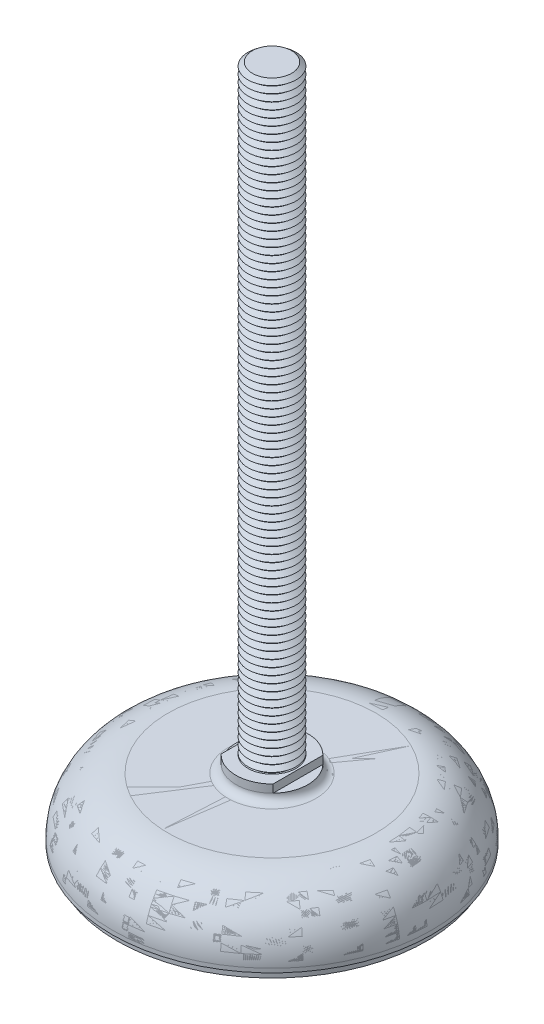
ISO-10303-21;
HEADER;
FILE_DESCRIPTION(('STEP AP214'),'2;1');
FILE_NAME('part.step','',(''),(''),'','','');
FILE_SCHEMA(('AUTOMOTIVE_DESIGN { 1 0 10303 214 1 1 1 1 }'));
ENDSEC;
DATA;
#1=APPLICATION_CONTEXT('core data for automotive mechanical design processes');
#2=APPLICATION_PROTOCOL_DEFINITION('international standard','automotive_design',2000,#1);
#3=PRODUCT_CONTEXT('',#1,'mechanical');
#4=PRODUCT('Part','Part','',(#3));
#5=PRODUCT_RELATED_PRODUCT_CATEGORY('part','',(#4));
#6=PRODUCT_DEFINITION_FORMATION('','',#4);
#7=PRODUCT_DEFINITION_CONTEXT('part definition',#1,'design');
#8=PRODUCT_DEFINITION('design','',#6,#7);
#9=PRODUCT_DEFINITION_SHAPE('','',#8);
#10=(LENGTH_UNIT() NAMED_UNIT(*) SI_UNIT(.MILLI.,.METRE.));
#11=(NAMED_UNIT(*) PLANE_ANGLE_UNIT() SI_UNIT($,.RADIAN.));
#12=(NAMED_UNIT(*) SI_UNIT($,.STERADIAN.) SOLID_ANGLE_UNIT());
#13=UNCERTAINTY_MEASURE_WITH_UNIT(LENGTH_MEASURE(1.E-05),#10,'distance_accuracy_value','');
#14=(GEOMETRIC_REPRESENTATION_CONTEXT(3) GLOBAL_UNCERTAINTY_ASSIGNED_CONTEXT((#13)) GLOBAL_UNIT_ASSIGNED_CONTEXT((#10,
#11,#12)) REPRESENTATION_CONTEXT('',''));
#15=CARTESIAN_POINT('',(0.,0.,0.));
#16=DIRECTION('',(0.,0.,1.));
#17=DIRECTION('',(1.,0.,0.));
#18=AXIS2_PLACEMENT_3D('',#15,#16,#17);
#19=CARTESIAN_POINT('',(0.,166.25,0.));
#20=DIRECTION('',(0.,-1.,0.));
#21=DIRECTION('',(0.998136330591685,0.,-0.0610234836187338));
#22=AXIS2_PLACEMENT_3D('',#19,#20,#21);
#23=CONICAL_SURFACE('',#22,4.90712535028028,0.895664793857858);
#24=CARTESIAN_POINT('',(0.,165.375,0.));
#25=DIRECTION('',(0.,-1.,0.));
#26=DIRECTION('',(0.998136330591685,0.,-0.0610234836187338));
#27=AXIS2_PLACEMENT_3D('',#24,#25,#26);
#28=CIRCLE('',#27,6.);
#29=CARTESIAN_POINT('',(5.98881798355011,165.375,-0.366140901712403));
#30=VERTEX_POINT('',#29);
#31=EDGE_CURVE('P0_E37',#30,#30,#28,.T.);
#32=ORIENTED_EDGE('',*,*,#31,.F.);
#33=EDGE_LOOP('',(#32));
#34=FACE_BOUND('',#33,.T.);
#35=CARTESIAN_POINT('',(0.,166.25,0.));
#36=DIRECTION('',(0.,-1.,0.));
#37=DIRECTION('',(0.998136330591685,0.,-0.0610234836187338));
#38=AXIS2_PLACEMENT_3D('',#35,#36,#37);
#39=CIRCLE('',#38,4.90712535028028);
#40=CARTESIAN_POINT('',(4.8979800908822,166.25,-0.299449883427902));
#41=VERTEX_POINT('',#40);
#42=EDGE_CURVE('P0_E25',#41,#41,#39,.T.);
#43=ORIENTED_EDGE('',*,*,#42,.T.);
#44=EDGE_LOOP('',(#43));
#45=FACE_BOUND('',#44,.T.);
#46=ADVANCED_FACE('P0_F14',(#34,#45),#23,.T.);
#47=CARTESIAN_POINT('',(0.,167.125,0.));
#48=DIRECTION('',(0.,1.,0.));
#49=DIRECTION('',(-0.998136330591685,0.,0.0610234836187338));
#50=AXIS2_PLACEMENT_3D('',#47,#48,#49);
#51=CONICAL_SURFACE('',#50,6.,0.895664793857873);
#52=ORIENTED_EDGE('',*,*,#42,.F.);
#53=EDGE_LOOP('',(#52));
#54=FACE_BOUND('',#53,.T.);
#55=CARTESIAN_POINT('',(0.,167.125,0.));
#56=DIRECTION('',(0.,-1.,0.));
#57=DIRECTION('',(0.998136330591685,0.,-0.0610234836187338));
#58=AXIS2_PLACEMENT_3D('',#55,#56,#57);
#59=CIRCLE('',#58,6.);
#60=CARTESIAN_POINT('',(5.98881798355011,167.125,-0.366140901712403));
#61=VERTEX_POINT('',#60);
#62=EDGE_CURVE('P0_E29',#61,#61,#59,.T.);
#63=ORIENTED_EDGE('',*,*,#62,.T.);
#64=EDGE_LOOP('',(#63));
#65=FACE_BOUND('',#64,.T.);
#66=ADVANCED_FACE('P0_F1663',(#54,#65),#51,.T.);
#67=CARTESIAN_POINT('',(0.,168.,0.));
#68=DIRECTION('',(0.,1.,0.));
#69=DIRECTION('',(-0.998136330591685,0.,0.0610234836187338));
#70=AXIS2_PLACEMENT_3D('',#67,#68,#69);
#71=PLANE('',#70);
#72=CARTESIAN_POINT('',(0.,168.,0.));
#73=DIRECTION('',(0.,-1.,0.));
#74=DIRECTION('',(0.998136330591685,0.,-0.0610234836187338));
#75=AXIS2_PLACEMENT_3D('',#72,#73,#74);
#76=CIRCLE('',#75,4.90712535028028);
#77=CARTESIAN_POINT('',(4.8979800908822,168.,-0.299449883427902));
#78=VERTEX_POINT('',#77);
#79=EDGE_CURVE('P0_E21',#78,#78,#76,.T.);
#80=ORIENTED_EDGE('',*,*,#79,.F.);
#81=EDGE_LOOP('',(#80));
#82=FACE_BOUND('',#81,.T.);
#83=ADVANCED_FACE('P0_F1669',(#82),#71,.T.);
#84=CARTESIAN_POINT('',(0.,168.,0.));
#85=DIRECTION('',(0.,-1.,0.));
#86=DIRECTION('',(0.998136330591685,0.,-0.0610234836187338));
#87=AXIS2_PLACEMENT_3D('',#84,#85,#86);
#88=CONICAL_SURFACE('',#87,4.90712535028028,0.895664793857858);
#89=ORIENTED_EDGE('',*,*,#62,.F.);
#90=EDGE_LOOP('',(#89));
#91=FACE_BOUND('',#90,.T.);
#92=ORIENTED_EDGE('',*,*,#79,.T.);
#93=EDGE_LOOP('',(#92));
#94=FACE_BOUND('',#93,.T.);
#95=ADVANCED_FACE('P0_F1652',(#91,#94),#88,.T.);
#96=CARTESIAN_POINT('',(0.,164.5,0.));
#97=DIRECTION('',(0.,-1.,0.));
#98=DIRECTION('',(0.998136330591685,0.,-0.0610234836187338));
#99=AXIS2_PLACEMENT_3D('',#96,#97,#98);
#100=CONICAL_SURFACE('',#99,4.90712535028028,0.895664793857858);
#101=CARTESIAN_POINT('',(0.,163.625,0.));
#102=DIRECTION('',(0.,-1.,0.));
#103=DIRECTION('',(0.998136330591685,0.,-0.0610234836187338));
#104=AXIS2_PLACEMENT_3D('',#101,#102,#103);
#105=CIRCLE('',#104,6.);
#106=CARTESIAN_POINT('',(5.98881798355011,163.625,-0.366140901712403));
#107=VERTEX_POINT('',#106);
#108=EDGE_CURVE('P0_E43',#107,#107,#105,.T.);
#109=ORIENTED_EDGE('',*,*,#108,.F.);
#110=EDGE_LOOP('',(#109));
#111=FACE_BOUND('',#110,.T.);
#112=CARTESIAN_POINT('',(0.,164.5,0.));
#113=DIRECTION('',(0.,-1.,0.));
#114=DIRECTION('',(0.998136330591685,0.,-0.0610234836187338));
#115=AXIS2_PLACEMENT_3D('',#112,#113,#114);
#116=CIRCLE('',#115,4.90712535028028);
#117=CARTESIAN_POINT('',(4.8979800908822,164.5,-0.299449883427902));
#118=VERTEX_POINT('',#117);
#119=EDGE_CURVE('P0_E34',#118,#118,#116,.T.);
#120=ORIENTED_EDGE('',*,*,#119,.T.);
#121=EDGE_LOOP('',(#120));
#122=FACE_BOUND('',#121,.T.);
#123=ADVANCED_FACE('P0_F1649',(#111,#122),#100,.T.);
#124=CARTESIAN_POINT('',(0.,165.375,0.));
#125=DIRECTION('',(0.,1.,0.));
#126=DIRECTION('',(-0.998136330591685,0.,0.0610234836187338));
#127=AXIS2_PLACEMENT_3D('',#124,#125,#126);
#128=CONICAL_SURFACE('',#127,6.,0.895664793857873);
#129=ORIENTED_EDGE('',*,*,#119,.F.);
#130=EDGE_LOOP('',(#129));
#131=FACE_BOUND('',#130,.T.);
#132=ORIENTED_EDGE('',*,*,#31,.T.);
#133=EDGE_LOOP('',(#132));
#134=FACE_BOUND('',#133,.T.);
#135=ADVANCED_FACE('P0_F1640',(#131,#134),#128,.T.);
#136=CARTESIAN_POINT('',(0.,162.75,0.));
#137=DIRECTION('',(0.,-1.,0.));
#138=DIRECTION('',(0.998136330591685,0.,-0.0610234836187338));
#139=AXIS2_PLACEMENT_3D('',#136,#137,#138);
#140=CONICAL_SURFACE('',#139,4.90712535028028,0.895664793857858);
#141=CARTESIAN_POINT('',(0.,161.875,0.));
#142=DIRECTION('',(0.,-1.,0.));
#143=DIRECTION('',(0.998136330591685,0.,-0.0610234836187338));
#144=AXIS2_PLACEMENT_3D('',#141,#142,#143);
#145=CIRCLE('',#144,6.);
#146=CARTESIAN_POINT('',(5.98881798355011,161.875,-0.366140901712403));
#147=VERTEX_POINT('',#146);
#148=EDGE_CURVE('P0_E49',#147,#147,#145,.T.);
#149=ORIENTED_EDGE('',*,*,#148,.F.);
#150=EDGE_LOOP('',(#149));
#151=FACE_BOUND('',#150,.T.);
#152=CARTESIAN_POINT('',(0.,162.75,0.));
#153=DIRECTION('',(0.,-1.,0.));
#154=DIRECTION('',(0.998136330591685,0.,-0.0610234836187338));
#155=AXIS2_PLACEMENT_3D('',#152,#153,#154);
#156=CIRCLE('',#155,4.90712535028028);
#157=CARTESIAN_POINT('',(4.8979800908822,162.75,-0.299449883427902));
#158=VERTEX_POINT('',#157);
#159=EDGE_CURVE('P0_E40',#158,#158,#156,.T.);
#160=ORIENTED_EDGE('',*,*,#159,.T.);
#161=EDGE_LOOP('',(#160));
#162=FACE_BOUND('',#161,.T.);
#163=ADVANCED_FACE('P0_F1637',(#151,#162),#140,.T.);
#164=CARTESIAN_POINT('',(0.,163.625,0.));
#165=DIRECTION('',(0.,1.,0.));
#166=DIRECTION('',(-0.998136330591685,0.,0.0610234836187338));
#167=AXIS2_PLACEMENT_3D('',#164,#165,#166);
#168=CONICAL_SURFACE('',#167,6.,0.895664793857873);
#169=ORIENTED_EDGE('',*,*,#159,.F.);
#170=EDGE_LOOP('',(#169));
#171=FACE_BOUND('',#170,.T.);
#172=ORIENTED_EDGE('',*,*,#108,.T.);
#173=EDGE_LOOP('',(#172));
#174=FACE_BOUND('',#173,.T.);
#175=ADVANCED_FACE('P0_F1628',(#171,#174),#168,.T.);
#176=CARTESIAN_POINT('',(0.,161.,0.));
#177=DIRECTION('',(0.,-1.,0.));
#178=DIRECTION('',(0.998136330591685,0.,-0.0610234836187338));
#179=AXIS2_PLACEMENT_3D('',#176,#177,#178);
#180=CONICAL_SURFACE('',#179,4.90712535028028,0.895664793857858);
#181=CARTESIAN_POINT('',(0.,160.125,0.));
#182=DIRECTION('',(0.,-1.,0.));
#183=DIRECTION('',(0.998136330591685,0.,-0.0610234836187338));
#184=AXIS2_PLACEMENT_3D('',#181,#182,#183);
#185=CIRCLE('',#184,6.);
#186=CARTESIAN_POINT('',(5.98881798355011,160.125,-0.366140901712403));
#187=VERTEX_POINT('',#186);
#188=EDGE_CURVE('P0_E55',#187,#187,#185,.T.);
#189=ORIENTED_EDGE('',*,*,#188,.F.);
#190=EDGE_LOOP('',(#189));
#191=FACE_BOUND('',#190,.T.);
#192=CARTESIAN_POINT('',(0.,161.,0.));
#193=DIRECTION('',(0.,-1.,0.));
#194=DIRECTION('',(0.998136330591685,0.,-0.0610234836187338));
#195=AXIS2_PLACEMENT_3D('',#192,#193,#194);
#196=CIRCLE('',#195,4.90712535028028);
#197=CARTESIAN_POINT('',(4.8979800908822,161.,-0.299449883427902));
#198=VERTEX_POINT('',#197);
#199=EDGE_CURVE('P0_E46',#198,#198,#196,.T.);
#200=ORIENTED_EDGE('',*,*,#199,.T.);
#201=EDGE_LOOP('',(#200));
#202=FACE_BOUND('',#201,.T.);
#203=ADVANCED_FACE('P0_F1625',(#191,#202),#180,.T.);
#204=CARTESIAN_POINT('',(0.,161.875,0.));
#205=DIRECTION('',(0.,1.,0.));
#206=DIRECTION('',(-0.998136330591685,0.,0.0610234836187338));
#207=AXIS2_PLACEMENT_3D('',#204,#205,#206);
#208=CONICAL_SURFACE('',#207,6.,0.895664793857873);
#209=ORIENTED_EDGE('',*,*,#199,.F.);
#210=EDGE_LOOP('',(#209));
#211=FACE_BOUND('',#210,.T.);
#212=ORIENTED_EDGE('',*,*,#148,.T.);
#213=EDGE_LOOP('',(#212));
#214=FACE_BOUND('',#213,.T.);
#215=ADVANCED_FACE('P0_F1616',(#211,#214),#208,.T.);
#216=CARTESIAN_POINT('',(0.,159.25,0.));
#217=DIRECTION('',(0.,-1.,0.));
#218=DIRECTION('',(0.998136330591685,0.,-0.0610234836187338));
#219=AXIS2_PLACEMENT_3D('',#216,#217,#218);
#220=CONICAL_SURFACE('',#219,4.90712535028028,0.895664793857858);
#221=CARTESIAN_POINT('',(0.,158.375,0.));
#222=DIRECTION('',(0.,-1.,0.));
#223=DIRECTION('',(0.998136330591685,0.,-0.0610234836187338));
#224=AXIS2_PLACEMENT_3D('',#221,#222,#223);
#225=CIRCLE('',#224,6.);
#226=CARTESIAN_POINT('',(5.98881798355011,158.375,-0.366140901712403));
#227=VERTEX_POINT('',#226);
#228=EDGE_CURVE('P0_E61',#227,#227,#225,.T.);
#229=ORIENTED_EDGE('',*,*,#228,.F.);
#230=EDGE_LOOP('',(#229));
#231=FACE_BOUND('',#230,.T.);
#232=CARTESIAN_POINT('',(0.,159.25,0.));
#233=DIRECTION('',(0.,-1.,0.));
#234=DIRECTION('',(0.998136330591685,0.,-0.0610234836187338));
#235=AXIS2_PLACEMENT_3D('',#232,#233,#234);
#236=CIRCLE('',#235,4.90712535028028);
#237=CARTESIAN_POINT('',(4.8979800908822,159.25,-0.299449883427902));
#238=VERTEX_POINT('',#237);
#239=EDGE_CURVE('P0_E52',#238,#238,#236,.T.);
#240=ORIENTED_EDGE('',*,*,#239,.T.);
#241=EDGE_LOOP('',(#240));
#242=FACE_BOUND('',#241,.T.);
#243=ADVANCED_FACE('P0_F1613',(#231,#242),#220,.T.);
#244=CARTESIAN_POINT('',(0.,160.125,0.));
#245=DIRECTION('',(0.,1.,0.));
#246=DIRECTION('',(-0.998136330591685,0.,0.0610234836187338));
#247=AXIS2_PLACEMENT_3D('',#244,#245,#246);
#248=CONICAL_SURFACE('',#247,6.,0.895664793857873);
#249=ORIENTED_EDGE('',*,*,#239,.F.);
#250=EDGE_LOOP('',(#249));
#251=FACE_BOUND('',#250,.T.);
#252=ORIENTED_EDGE('',*,*,#188,.T.);
#253=EDGE_LOOP('',(#252));
#254=FACE_BOUND('',#253,.T.);
#255=ADVANCED_FACE('P0_F1604',(#251,#254),#248,.T.);
#256=CARTESIAN_POINT('',(0.,157.5,0.));
#257=DIRECTION('',(0.,-1.,0.));
#258=DIRECTION('',(0.998136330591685,0.,-0.0610234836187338));
#259=AXIS2_PLACEMENT_3D('',#256,#257,#258);
#260=CONICAL_SURFACE('',#259,4.90712535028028,0.895664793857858);
#261=CARTESIAN_POINT('',(0.,156.625,0.));
#262=DIRECTION('',(0.,-1.,0.));
#263=DIRECTION('',(0.998136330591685,0.,-0.0610234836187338));
#264=AXIS2_PLACEMENT_3D('',#261,#262,#263);
#265=CIRCLE('',#264,6.);
#266=CARTESIAN_POINT('',(5.98881798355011,156.625,-0.366140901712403));
#267=VERTEX_POINT('',#266);
#268=EDGE_CURVE('P0_E67',#267,#267,#265,.T.);
#269=ORIENTED_EDGE('',*,*,#268,.F.);
#270=EDGE_LOOP('',(#269));
#271=FACE_BOUND('',#270,.T.);
#272=CARTESIAN_POINT('',(0.,157.5,0.));
#273=DIRECTION('',(0.,-1.,0.));
#274=DIRECTION('',(0.998136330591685,0.,-0.0610234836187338));
#275=AXIS2_PLACEMENT_3D('',#272,#273,#274);
#276=CIRCLE('',#275,4.90712535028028);
#277=CARTESIAN_POINT('',(4.8979800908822,157.5,-0.299449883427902));
#278=VERTEX_POINT('',#277);
#279=EDGE_CURVE('P0_E58',#278,#278,#276,.T.);
#280=ORIENTED_EDGE('',*,*,#279,.T.);
#281=EDGE_LOOP('',(#280));
#282=FACE_BOUND('',#281,.T.);
#283=ADVANCED_FACE('P0_F1601',(#271,#282),#260,.T.);
#284=CARTESIAN_POINT('',(0.,158.375,0.));
#285=DIRECTION('',(0.,1.,0.));
#286=DIRECTION('',(-0.998136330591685,0.,0.0610234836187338));
#287=AXIS2_PLACEMENT_3D('',#284,#285,#286);
#288=CONICAL_SURFACE('',#287,6.,0.895664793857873);
#289=ORIENTED_EDGE('',*,*,#279,.F.);
#290=EDGE_LOOP('',(#289));
#291=FACE_BOUND('',#290,.T.);
#292=ORIENTED_EDGE('',*,*,#228,.T.);
#293=EDGE_LOOP('',(#292));
#294=FACE_BOUND('',#293,.T.);
#295=ADVANCED_FACE('P0_F1592',(#291,#294),#288,.T.);
#296=CARTESIAN_POINT('',(0.,155.75,0.));
#297=DIRECTION('',(0.,-1.,0.));
#298=DIRECTION('',(0.998136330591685,0.,-0.0610234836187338));
#299=AXIS2_PLACEMENT_3D('',#296,#297,#298);
#300=CONICAL_SURFACE('',#299,4.90712535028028,0.895664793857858);
#301=CARTESIAN_POINT('',(0.,154.875,0.));
#302=DIRECTION('',(0.,-1.,0.));
#303=DIRECTION('',(0.998136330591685,0.,-0.0610234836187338));
#304=AXIS2_PLACEMENT_3D('',#301,#302,#303);
#305=CIRCLE('',#304,6.);
#306=CARTESIAN_POINT('',(5.98881798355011,154.875,-0.366140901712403));
#307=VERTEX_POINT('',#306);
#308=EDGE_CURVE('P0_E73',#307,#307,#305,.T.);
#309=ORIENTED_EDGE('',*,*,#308,.F.);
#310=EDGE_LOOP('',(#309));
#311=FACE_BOUND('',#310,.T.);
#312=CARTESIAN_POINT('',(0.,155.75,0.));
#313=DIRECTION('',(0.,-1.,0.));
#314=DIRECTION('',(0.998136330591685,0.,-0.0610234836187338));
#315=AXIS2_PLACEMENT_3D('',#312,#313,#314);
#316=CIRCLE('',#315,4.90712535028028);
#317=CARTESIAN_POINT('',(4.8979800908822,155.75,-0.299449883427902));
#318=VERTEX_POINT('',#317);
#319=EDGE_CURVE('P0_E64',#318,#318,#316,.T.);
#320=ORIENTED_EDGE('',*,*,#319,.T.);
#321=EDGE_LOOP('',(#320));
#322=FACE_BOUND('',#321,.T.);
#323=ADVANCED_FACE('P0_F1589',(#311,#322),#300,.T.);
#324=CARTESIAN_POINT('',(0.,156.625,0.));
#325=DIRECTION('',(0.,1.,0.));
#326=DIRECTION('',(-0.998136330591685,0.,0.0610234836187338));
#327=AXIS2_PLACEMENT_3D('',#324,#325,#326);
#328=CONICAL_SURFACE('',#327,6.,0.895664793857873);
#329=ORIENTED_EDGE('',*,*,#319,.F.);
#330=EDGE_LOOP('',(#329));
#331=FACE_BOUND('',#330,.T.);
#332=ORIENTED_EDGE('',*,*,#268,.T.);
#333=EDGE_LOOP('',(#332));
#334=FACE_BOUND('',#333,.T.);
#335=ADVANCED_FACE('P0_F1580',(#331,#334),#328,.T.);
#336=CARTESIAN_POINT('',(0.,154.,0.));
#337=DIRECTION('',(0.,-1.,0.));
#338=DIRECTION('',(0.998136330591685,0.,-0.0610234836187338));
#339=AXIS2_PLACEMENT_3D('',#336,#337,#338);
#340=CONICAL_SURFACE('',#339,4.90712535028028,0.895664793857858);
#341=CARTESIAN_POINT('',(0.,153.125,0.));
#342=DIRECTION('',(0.,-1.,0.));
#343=DIRECTION('',(0.998136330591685,0.,-0.0610234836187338));
#344=AXIS2_PLACEMENT_3D('',#341,#342,#343);
#345=CIRCLE('',#344,6.);
#346=CARTESIAN_POINT('',(5.98881798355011,153.125,-0.366140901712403));
#347=VERTEX_POINT('',#346);
#348=EDGE_CURVE('P0_E79',#347,#347,#345,.T.);
#349=ORIENTED_EDGE('',*,*,#348,.F.);
#350=EDGE_LOOP('',(#349));
#351=FACE_BOUND('',#350,.T.);
#352=CARTESIAN_POINT('',(0.,154.,0.));
#353=DIRECTION('',(0.,-1.,0.));
#354=DIRECTION('',(0.998136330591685,0.,-0.0610234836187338));
#355=AXIS2_PLACEMENT_3D('',#352,#353,#354);
#356=CIRCLE('',#355,4.90712535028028);
#357=CARTESIAN_POINT('',(4.8979800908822,154.,-0.299449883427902));
#358=VERTEX_POINT('',#357);
#359=EDGE_CURVE('P0_E70',#358,#358,#356,.T.);
#360=ORIENTED_EDGE('',*,*,#359,.T.);
#361=EDGE_LOOP('',(#360));
#362=FACE_BOUND('',#361,.T.);
#363=ADVANCED_FACE('P0_F1577',(#351,#362),#340,.T.);
#364=CARTESIAN_POINT('',(0.,154.875,0.));
#365=DIRECTION('',(0.,1.,0.));
#366=DIRECTION('',(-0.998136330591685,0.,0.0610234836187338));
#367=AXIS2_PLACEMENT_3D('',#364,#365,#366);
#368=CONICAL_SURFACE('',#367,6.,0.895664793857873);
#369=ORIENTED_EDGE('',*,*,#359,.F.);
#370=EDGE_LOOP('',(#369));
#371=FACE_BOUND('',#370,.T.);
#372=ORIENTED_EDGE('',*,*,#308,.T.);
#373=EDGE_LOOP('',(#372));
#374=FACE_BOUND('',#373,.T.);
#375=ADVANCED_FACE('P0_F1568',(#371,#374),#368,.T.);
#376=CARTESIAN_POINT('',(0.,152.25,0.));
#377=DIRECTION('',(0.,-1.,0.));
#378=DIRECTION('',(0.998136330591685,0.,-0.0610234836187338));
#379=AXIS2_PLACEMENT_3D('',#376,#377,#378);
#380=CONICAL_SURFACE('',#379,4.90712535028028,0.895664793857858);
#381=CARTESIAN_POINT('',(0.,151.375,0.));
#382=DIRECTION('',(0.,-1.,0.));
#383=DIRECTION('',(0.998136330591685,0.,-0.0610234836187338));
#384=AXIS2_PLACEMENT_3D('',#381,#382,#383);
#385=CIRCLE('',#384,6.);
#386=CARTESIAN_POINT('',(5.98881798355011,151.375,-0.366140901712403));
#387=VERTEX_POINT('',#386);
#388=EDGE_CURVE('P0_E85',#387,#387,#385,.T.);
#389=ORIENTED_EDGE('',*,*,#388,.F.);
#390=EDGE_LOOP('',(#389));
#391=FACE_BOUND('',#390,.T.);
#392=CARTESIAN_POINT('',(0.,152.25,0.));
#393=DIRECTION('',(0.,-1.,0.));
#394=DIRECTION('',(0.998136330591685,0.,-0.0610234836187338));
#395=AXIS2_PLACEMENT_3D('',#392,#393,#394);
#396=CIRCLE('',#395,4.90712535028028);
#397=CARTESIAN_POINT('',(4.8979800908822,152.25,-0.299449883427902));
#398=VERTEX_POINT('',#397);
#399=EDGE_CURVE('P0_E76',#398,#398,#396,.T.);
#400=ORIENTED_EDGE('',*,*,#399,.T.);
#401=EDGE_LOOP('',(#400));
#402=FACE_BOUND('',#401,.T.);
#403=ADVANCED_FACE('P0_F1565',(#391,#402),#380,.T.);
#404=CARTESIAN_POINT('',(0.,153.125,0.));
#405=DIRECTION('',(0.,1.,0.));
#406=DIRECTION('',(-0.998136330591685,0.,0.0610234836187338));
#407=AXIS2_PLACEMENT_3D('',#404,#405,#406);
#408=CONICAL_SURFACE('',#407,6.,0.895664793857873);
#409=ORIENTED_EDGE('',*,*,#399,.F.);
#410=EDGE_LOOP('',(#409));
#411=FACE_BOUND('',#410,.T.);
#412=ORIENTED_EDGE('',*,*,#348,.T.);
#413=EDGE_LOOP('',(#412));
#414=FACE_BOUND('',#413,.T.);
#415=ADVANCED_FACE('P0_F1556',(#411,#414),#408,.T.);
#416=CARTESIAN_POINT('',(0.,150.5,0.));
#417=DIRECTION('',(0.,-1.,0.));
#418=DIRECTION('',(0.998136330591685,0.,-0.0610234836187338));
#419=AXIS2_PLACEMENT_3D('',#416,#417,#418);
#420=CONICAL_SURFACE('',#419,4.90712535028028,0.895664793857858);
#421=CARTESIAN_POINT('',(0.,149.625,0.));
#422=DIRECTION('',(0.,-1.,0.));
#423=DIRECTION('',(0.998136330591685,0.,-0.0610234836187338));
#424=AXIS2_PLACEMENT_3D('',#421,#422,#423);
#425=CIRCLE('',#424,6.);
#426=CARTESIAN_POINT('',(5.98881798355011,149.625,-0.366140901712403));
#427=VERTEX_POINT('',#426);
#428=EDGE_CURVE('P0_E91',#427,#427,#425,.T.);
#429=ORIENTED_EDGE('',*,*,#428,.F.);
#430=EDGE_LOOP('',(#429));
#431=FACE_BOUND('',#430,.T.);
#432=CARTESIAN_POINT('',(0.,150.5,0.));
#433=DIRECTION('',(0.,-1.,0.));
#434=DIRECTION('',(0.998136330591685,0.,-0.0610234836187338));
#435=AXIS2_PLACEMENT_3D('',#432,#433,#434);
#436=CIRCLE('',#435,4.90712535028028);
#437=CARTESIAN_POINT('',(4.8979800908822,150.5,-0.299449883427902));
#438=VERTEX_POINT('',#437);
#439=EDGE_CURVE('P0_E82',#438,#438,#436,.T.);
#440=ORIENTED_EDGE('',*,*,#439,.T.);
#441=EDGE_LOOP('',(#440));
#442=FACE_BOUND('',#441,.T.);
#443=ADVANCED_FACE('P0_F1553',(#431,#442),#420,.T.);
#444=CARTESIAN_POINT('',(0.,151.375,0.));
#445=DIRECTION('',(0.,1.,0.));
#446=DIRECTION('',(-0.998136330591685,0.,0.0610234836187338));
#447=AXIS2_PLACEMENT_3D('',#444,#445,#446);
#448=CONICAL_SURFACE('',#447,6.,0.895664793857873);
#449=ORIENTED_EDGE('',*,*,#439,.F.);
#450=EDGE_LOOP('',(#449));
#451=FACE_BOUND('',#450,.T.);
#452=ORIENTED_EDGE('',*,*,#388,.T.);
#453=EDGE_LOOP('',(#452));
#454=FACE_BOUND('',#453,.T.);
#455=ADVANCED_FACE('P0_F1544',(#451,#454),#448,.T.);
#456=CARTESIAN_POINT('',(0.,148.75,0.));
#457=DIRECTION('',(0.,-1.,0.));
#458=DIRECTION('',(0.998136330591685,0.,-0.0610234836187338));
#459=AXIS2_PLACEMENT_3D('',#456,#457,#458);
#460=CONICAL_SURFACE('',#459,4.90712535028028,0.895664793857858);
#461=CARTESIAN_POINT('',(0.,147.875,0.));
#462=DIRECTION('',(0.,-1.,0.));
#463=DIRECTION('',(0.998136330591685,0.,-0.0610234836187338));
#464=AXIS2_PLACEMENT_3D('',#461,#462,#463);
#465=CIRCLE('',#464,6.);
#466=CARTESIAN_POINT('',(5.98881798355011,147.875,-0.366140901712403));
#467=VERTEX_POINT('',#466);
#468=EDGE_CURVE('P0_E97',#467,#467,#465,.T.);
#469=ORIENTED_EDGE('',*,*,#468,.F.);
#470=EDGE_LOOP('',(#469));
#471=FACE_BOUND('',#470,.T.);
#472=CARTESIAN_POINT('',(0.,148.75,0.));
#473=DIRECTION('',(0.,-1.,0.));
#474=DIRECTION('',(0.998136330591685,0.,-0.0610234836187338));
#475=AXIS2_PLACEMENT_3D('',#472,#473,#474);
#476=CIRCLE('',#475,4.90712535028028);
#477=CARTESIAN_POINT('',(4.8979800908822,148.75,-0.299449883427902));
#478=VERTEX_POINT('',#477);
#479=EDGE_CURVE('P0_E88',#478,#478,#476,.T.);
#480=ORIENTED_EDGE('',*,*,#479,.T.);
#481=EDGE_LOOP('',(#480));
#482=FACE_BOUND('',#481,.T.);
#483=ADVANCED_FACE('P0_F1541',(#471,#482),#460,.T.);
#484=CARTESIAN_POINT('',(0.,149.625,0.));
#485=DIRECTION('',(0.,1.,0.));
#486=DIRECTION('',(-0.998136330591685,0.,0.0610234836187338));
#487=AXIS2_PLACEMENT_3D('',#484,#485,#486);
#488=CONICAL_SURFACE('',#487,6.,0.895664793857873);
#489=ORIENTED_EDGE('',*,*,#479,.F.);
#490=EDGE_LOOP('',(#489));
#491=FACE_BOUND('',#490,.T.);
#492=ORIENTED_EDGE('',*,*,#428,.T.);
#493=EDGE_LOOP('',(#492));
#494=FACE_BOUND('',#493,.T.);
#495=ADVANCED_FACE('P0_F1532',(#491,#494),#488,.T.);
#496=CARTESIAN_POINT('',(0.,147.,0.));
#497=DIRECTION('',(0.,-1.,0.));
#498=DIRECTION('',(0.998136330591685,0.,-0.0610234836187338));
#499=AXIS2_PLACEMENT_3D('',#496,#497,#498);
#500=CONICAL_SURFACE('',#499,4.90712535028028,0.895664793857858);
#501=CARTESIAN_POINT('',(0.,146.125,0.));
#502=DIRECTION('',(0.,-1.,0.));
#503=DIRECTION('',(0.998136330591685,0.,-0.0610234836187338));
#504=AXIS2_PLACEMENT_3D('',#501,#502,#503);
#505=CIRCLE('',#504,6.);
#506=CARTESIAN_POINT('',(5.98881798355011,146.125,-0.366140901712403));
#507=VERTEX_POINT('',#506);
#508=EDGE_CURVE('P0_E103',#507,#507,#505,.T.);
#509=ORIENTED_EDGE('',*,*,#508,.F.);
#510=EDGE_LOOP('',(#509));
#511=FACE_BOUND('',#510,.T.);
#512=CARTESIAN_POINT('',(0.,147.,0.));
#513=DIRECTION('',(0.,-1.,0.));
#514=DIRECTION('',(0.998136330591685,0.,-0.0610234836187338));
#515=AXIS2_PLACEMENT_3D('',#512,#513,#514);
#516=CIRCLE('',#515,4.90712535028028);
#517=CARTESIAN_POINT('',(4.8979800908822,147.,-0.299449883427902));
#518=VERTEX_POINT('',#517);
#519=EDGE_CURVE('P0_E94',#518,#518,#516,.T.);
#520=ORIENTED_EDGE('',*,*,#519,.T.);
#521=EDGE_LOOP('',(#520));
#522=FACE_BOUND('',#521,.T.);
#523=ADVANCED_FACE('P0_F1529',(#511,#522),#500,.T.);
#524=CARTESIAN_POINT('',(0.,147.875,0.));
#525=DIRECTION('',(0.,1.,0.));
#526=DIRECTION('',(-0.998136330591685,0.,0.0610234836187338));
#527=AXIS2_PLACEMENT_3D('',#524,#525,#526);
#528=CONICAL_SURFACE('',#527,6.,0.895664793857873);
#529=ORIENTED_EDGE('',*,*,#519,.F.);
#530=EDGE_LOOP('',(#529));
#531=FACE_BOUND('',#530,.T.);
#532=ORIENTED_EDGE('',*,*,#468,.T.);
#533=EDGE_LOOP('',(#532));
#534=FACE_BOUND('',#533,.T.);
#535=ADVANCED_FACE('P0_F1520',(#531,#534),#528,.T.);
#536=CARTESIAN_POINT('',(0.,145.25,0.));
#537=DIRECTION('',(0.,-1.,0.));
#538=DIRECTION('',(0.998136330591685,0.,-0.0610234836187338));
#539=AXIS2_PLACEMENT_3D('',#536,#537,#538);
#540=CONICAL_SURFACE('',#539,4.90712535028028,0.895664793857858);
#541=CARTESIAN_POINT('',(0.,144.375,0.));
#542=DIRECTION('',(0.,-1.,0.));
#543=DIRECTION('',(0.998136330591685,0.,-0.0610234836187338));
#544=AXIS2_PLACEMENT_3D('',#541,#542,#543);
#545=CIRCLE('',#544,6.);
#546=CARTESIAN_POINT('',(5.98881798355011,144.375,-0.366140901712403));
#547=VERTEX_POINT('',#546);
#548=EDGE_CURVE('P0_E109',#547,#547,#545,.T.);
#549=ORIENTED_EDGE('',*,*,#548,.F.);
#550=EDGE_LOOP('',(#549));
#551=FACE_BOUND('',#550,.T.);
#552=CARTESIAN_POINT('',(0.,145.25,0.));
#553=DIRECTION('',(0.,-1.,0.));
#554=DIRECTION('',(0.998136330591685,0.,-0.0610234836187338));
#555=AXIS2_PLACEMENT_3D('',#552,#553,#554);
#556=CIRCLE('',#555,4.90712535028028);
#557=CARTESIAN_POINT('',(4.8979800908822,145.25,-0.299449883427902));
#558=VERTEX_POINT('',#557);
#559=EDGE_CURVE('P0_E100',#558,#558,#556,.T.);
#560=ORIENTED_EDGE('',*,*,#559,.T.);
#561=EDGE_LOOP('',(#560));
#562=FACE_BOUND('',#561,.T.);
#563=ADVANCED_FACE('P0_F1517',(#551,#562),#540,.T.);
#564=CARTESIAN_POINT('',(0.,146.125,0.));
#565=DIRECTION('',(0.,1.,0.));
#566=DIRECTION('',(-0.998136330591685,0.,0.0610234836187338));
#567=AXIS2_PLACEMENT_3D('',#564,#565,#566);
#568=CONICAL_SURFACE('',#567,6.,0.895664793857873);
#569=ORIENTED_EDGE('',*,*,#559,.F.);
#570=EDGE_LOOP('',(#569));
#571=FACE_BOUND('',#570,.T.);
#572=ORIENTED_EDGE('',*,*,#508,.T.);
#573=EDGE_LOOP('',(#572));
#574=FACE_BOUND('',#573,.T.);
#575=ADVANCED_FACE('P0_F1508',(#571,#574),#568,.T.);
#576=CARTESIAN_POINT('',(0.,143.5,0.));
#577=DIRECTION('',(0.,-1.,0.));
#578=DIRECTION('',(0.998136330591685,0.,-0.0610234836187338));
#579=AXIS2_PLACEMENT_3D('',#576,#577,#578);
#580=CONICAL_SURFACE('',#579,4.90712535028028,0.895664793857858);
#581=CARTESIAN_POINT('',(0.,142.625,0.));
#582=DIRECTION('',(0.,-1.,0.));
#583=DIRECTION('',(0.998136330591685,0.,-0.0610234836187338));
#584=AXIS2_PLACEMENT_3D('',#581,#582,#583);
#585=CIRCLE('',#584,6.);
#586=CARTESIAN_POINT('',(5.98881798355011,142.625,-0.366140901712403));
#587=VERTEX_POINT('',#586);
#588=EDGE_CURVE('P0_E115',#587,#587,#585,.T.);
#589=ORIENTED_EDGE('',*,*,#588,.F.);
#590=EDGE_LOOP('',(#589));
#591=FACE_BOUND('',#590,.T.);
#592=CARTESIAN_POINT('',(0.,143.5,0.));
#593=DIRECTION('',(0.,-1.,0.));
#594=DIRECTION('',(0.998136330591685,0.,-0.0610234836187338));
#595=AXIS2_PLACEMENT_3D('',#592,#593,#594);
#596=CIRCLE('',#595,4.90712535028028);
#597=CARTESIAN_POINT('',(4.8979800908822,143.5,-0.299449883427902));
#598=VERTEX_POINT('',#597);
#599=EDGE_CURVE('P0_E106',#598,#598,#596,.T.);
#600=ORIENTED_EDGE('',*,*,#599,.T.);
#601=EDGE_LOOP('',(#600));
#602=FACE_BOUND('',#601,.T.);
#603=ADVANCED_FACE('P0_F1505',(#591,#602),#580,.T.);
#604=CARTESIAN_POINT('',(0.,144.375,0.));
#605=DIRECTION('',(0.,1.,0.));
#606=DIRECTION('',(-0.998136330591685,0.,0.0610234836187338));
#607=AXIS2_PLACEMENT_3D('',#604,#605,#606);
#608=CONICAL_SURFACE('',#607,6.,0.895664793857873);
#609=ORIENTED_EDGE('',*,*,#599,.F.);
#610=EDGE_LOOP('',(#609));
#611=FACE_BOUND('',#610,.T.);
#612=ORIENTED_EDGE('',*,*,#548,.T.);
#613=EDGE_LOOP('',(#612));
#614=FACE_BOUND('',#613,.T.);
#615=ADVANCED_FACE('P0_F1496',(#611,#614),#608,.T.);
#616=CARTESIAN_POINT('',(0.,141.75,0.));
#617=DIRECTION('',(0.,-1.,0.));
#618=DIRECTION('',(0.998136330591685,0.,-0.0610234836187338));
#619=AXIS2_PLACEMENT_3D('',#616,#617,#618);
#620=CONICAL_SURFACE('',#619,4.90712535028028,0.895664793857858);
#621=CARTESIAN_POINT('',(0.,140.875,0.));
#622=DIRECTION('',(0.,-1.,0.));
#623=DIRECTION('',(0.998136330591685,0.,-0.0610234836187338));
#624=AXIS2_PLACEMENT_3D('',#621,#622,#623);
#625=CIRCLE('',#624,6.);
#626=CARTESIAN_POINT('',(5.98881798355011,140.875,-0.366140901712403));
#627=VERTEX_POINT('',#626);
#628=EDGE_CURVE('P0_E121',#627,#627,#625,.T.);
#629=ORIENTED_EDGE('',*,*,#628,.F.);
#630=EDGE_LOOP('',(#629));
#631=FACE_BOUND('',#630,.T.);
#632=CARTESIAN_POINT('',(0.,141.75,0.));
#633=DIRECTION('',(0.,-1.,0.));
#634=DIRECTION('',(0.998136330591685,0.,-0.0610234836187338));
#635=AXIS2_PLACEMENT_3D('',#632,#633,#634);
#636=CIRCLE('',#635,4.90712535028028);
#637=CARTESIAN_POINT('',(4.8979800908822,141.75,-0.299449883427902));
#638=VERTEX_POINT('',#637);
#639=EDGE_CURVE('P0_E112',#638,#638,#636,.T.);
#640=ORIENTED_EDGE('',*,*,#639,.T.);
#641=EDGE_LOOP('',(#640));
#642=FACE_BOUND('',#641,.T.);
#643=ADVANCED_FACE('P0_F1493',(#631,#642),#620,.T.);
#644=CARTESIAN_POINT('',(0.,142.625,0.));
#645=DIRECTION('',(0.,1.,0.));
#646=DIRECTION('',(-0.998136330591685,0.,0.0610234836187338));
#647=AXIS2_PLACEMENT_3D('',#644,#645,#646);
#648=CONICAL_SURFACE('',#647,6.,0.895664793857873);
#649=ORIENTED_EDGE('',*,*,#639,.F.);
#650=EDGE_LOOP('',(#649));
#651=FACE_BOUND('',#650,.T.);
#652=ORIENTED_EDGE('',*,*,#588,.T.);
#653=EDGE_LOOP('',(#652));
#654=FACE_BOUND('',#653,.T.);
#655=ADVANCED_FACE('P0_F1484',(#651,#654),#648,.T.);
#656=CARTESIAN_POINT('',(0.,140.,0.));
#657=DIRECTION('',(0.,-1.,0.));
#658=DIRECTION('',(0.998136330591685,0.,-0.0610234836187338));
#659=AXIS2_PLACEMENT_3D('',#656,#657,#658);
#660=CONICAL_SURFACE('',#659,4.90712535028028,0.895664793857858);
#661=CARTESIAN_POINT('',(0.,139.125,0.));
#662=DIRECTION('',(0.,-1.,0.));
#663=DIRECTION('',(0.998136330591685,0.,-0.0610234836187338));
#664=AXIS2_PLACEMENT_3D('',#661,#662,#663);
#665=CIRCLE('',#664,6.);
#666=CARTESIAN_POINT('',(5.98881798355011,139.125,-0.366140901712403));
#667=VERTEX_POINT('',#666);
#668=EDGE_CURVE('P0_E127',#667,#667,#665,.T.);
#669=ORIENTED_EDGE('',*,*,#668,.F.);
#670=EDGE_LOOP('',(#669));
#671=FACE_BOUND('',#670,.T.);
#672=CARTESIAN_POINT('',(0.,140.,0.));
#673=DIRECTION('',(0.,-1.,0.));
#674=DIRECTION('',(0.998136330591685,0.,-0.0610234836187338));
#675=AXIS2_PLACEMENT_3D('',#672,#673,#674);
#676=CIRCLE('',#675,4.90712535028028);
#677=CARTESIAN_POINT('',(4.8979800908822,140.,-0.299449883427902));
#678=VERTEX_POINT('',#677);
#679=EDGE_CURVE('P0_E118',#678,#678,#676,.T.);
#680=ORIENTED_EDGE('',*,*,#679,.T.);
#681=EDGE_LOOP('',(#680));
#682=FACE_BOUND('',#681,.T.);
#683=ADVANCED_FACE('P0_F1481',(#671,#682),#660,.T.);
#684=CARTESIAN_POINT('',(0.,140.875,0.));
#685=DIRECTION('',(0.,1.,0.));
#686=DIRECTION('',(-0.998136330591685,0.,0.0610234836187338));
#687=AXIS2_PLACEMENT_3D('',#684,#685,#686);
#688=CONICAL_SURFACE('',#687,6.,0.895664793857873);
#689=ORIENTED_EDGE('',*,*,#679,.F.);
#690=EDGE_LOOP('',(#689));
#691=FACE_BOUND('',#690,.T.);
#692=ORIENTED_EDGE('',*,*,#628,.T.);
#693=EDGE_LOOP('',(#692));
#694=FACE_BOUND('',#693,.T.);
#695=ADVANCED_FACE('P0_F1472',(#691,#694),#688,.T.);
#696=CARTESIAN_POINT('',(0.,138.25,0.));
#697=DIRECTION('',(0.,-1.,0.));
#698=DIRECTION('',(0.998136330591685,0.,-0.0610234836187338));
#699=AXIS2_PLACEMENT_3D('',#696,#697,#698);
#700=CONICAL_SURFACE('',#699,4.90712535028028,0.895664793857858);
#701=CARTESIAN_POINT('',(0.,137.375,0.));
#702=DIRECTION('',(0.,-1.,0.));
#703=DIRECTION('',(0.998136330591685,0.,-0.0610234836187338));
#704=AXIS2_PLACEMENT_3D('',#701,#702,#703);
#705=CIRCLE('',#704,6.);
#706=CARTESIAN_POINT('',(5.98881798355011,137.375,-0.366140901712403));
#707=VERTEX_POINT('',#706);
#708=EDGE_CURVE('P0_E133',#707,#707,#705,.T.);
#709=ORIENTED_EDGE('',*,*,#708,.F.);
#710=EDGE_LOOP('',(#709));
#711=FACE_BOUND('',#710,.T.);
#712=CARTESIAN_POINT('',(0.,138.25,0.));
#713=DIRECTION('',(0.,-1.,0.));
#714=DIRECTION('',(0.998136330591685,0.,-0.0610234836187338));
#715=AXIS2_PLACEMENT_3D('',#712,#713,#714);
#716=CIRCLE('',#715,4.90712535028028);
#717=CARTESIAN_POINT('',(4.8979800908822,138.25,-0.299449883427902));
#718=VERTEX_POINT('',#717);
#719=EDGE_CURVE('P0_E124',#718,#718,#716,.T.);
#720=ORIENTED_EDGE('',*,*,#719,.T.);
#721=EDGE_LOOP('',(#720));
#722=FACE_BOUND('',#721,.T.);
#723=ADVANCED_FACE('P0_F1469',(#711,#722),#700,.T.);
#724=CARTESIAN_POINT('',(0.,139.125,0.));
#725=DIRECTION('',(0.,1.,0.));
#726=DIRECTION('',(-0.998136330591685,0.,0.0610234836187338));
#727=AXIS2_PLACEMENT_3D('',#724,#725,#726);
#728=CONICAL_SURFACE('',#727,6.,0.895664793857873);
#729=ORIENTED_EDGE('',*,*,#719,.F.);
#730=EDGE_LOOP('',(#729));
#731=FACE_BOUND('',#730,.T.);
#732=ORIENTED_EDGE('',*,*,#668,.T.);
#733=EDGE_LOOP('',(#732));
#734=FACE_BOUND('',#733,.T.);
#735=ADVANCED_FACE('P0_F1460',(#731,#734),#728,.T.);
#736=CARTESIAN_POINT('',(0.,136.5,0.));
#737=DIRECTION('',(0.,-1.,0.));
#738=DIRECTION('',(0.998136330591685,0.,-0.0610234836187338));
#739=AXIS2_PLACEMENT_3D('',#736,#737,#738);
#740=CONICAL_SURFACE('',#739,4.90712535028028,0.895664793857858);
#741=CARTESIAN_POINT('',(0.,135.625,0.));
#742=DIRECTION('',(0.,-1.,0.));
#743=DIRECTION('',(0.998136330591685,0.,-0.0610234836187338));
#744=AXIS2_PLACEMENT_3D('',#741,#742,#743);
#745=CIRCLE('',#744,6.);
#746=CARTESIAN_POINT('',(5.98881798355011,135.625,-0.366140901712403));
#747=VERTEX_POINT('',#746);
#748=EDGE_CURVE('P0_E139',#747,#747,#745,.T.);
#749=ORIENTED_EDGE('',*,*,#748,.F.);
#750=EDGE_LOOP('',(#749));
#751=FACE_BOUND('',#750,.T.);
#752=CARTESIAN_POINT('',(0.,136.5,0.));
#753=DIRECTION('',(0.,-1.,0.));
#754=DIRECTION('',(0.998136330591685,0.,-0.0610234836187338));
#755=AXIS2_PLACEMENT_3D('',#752,#753,#754);
#756=CIRCLE('',#755,4.90712535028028);
#757=CARTESIAN_POINT('',(4.8979800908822,136.5,-0.299449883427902));
#758=VERTEX_POINT('',#757);
#759=EDGE_CURVE('P0_E130',#758,#758,#756,.T.);
#760=ORIENTED_EDGE('',*,*,#759,.T.);
#761=EDGE_LOOP('',(#760));
#762=FACE_BOUND('',#761,.T.);
#763=ADVANCED_FACE('P0_F1457',(#751,#762),#740,.T.);
#764=CARTESIAN_POINT('',(0.,137.375,0.));
#765=DIRECTION('',(0.,1.,0.));
#766=DIRECTION('',(-0.998136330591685,0.,0.0610234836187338));
#767=AXIS2_PLACEMENT_3D('',#764,#765,#766);
#768=CONICAL_SURFACE('',#767,6.,0.895664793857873);
#769=ORIENTED_EDGE('',*,*,#759,.F.);
#770=EDGE_LOOP('',(#769));
#771=FACE_BOUND('',#770,.T.);
#772=ORIENTED_EDGE('',*,*,#708,.T.);
#773=EDGE_LOOP('',(#772));
#774=FACE_BOUND('',#773,.T.);
#775=ADVANCED_FACE('P0_F1448',(#771,#774),#768,.T.);
#776=CARTESIAN_POINT('',(0.,134.75,0.));
#777=DIRECTION('',(0.,-1.,0.));
#778=DIRECTION('',(0.998136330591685,0.,-0.0610234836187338));
#779=AXIS2_PLACEMENT_3D('',#776,#777,#778);
#780=CONICAL_SURFACE('',#779,4.90712535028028,0.895664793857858);
#781=CARTESIAN_POINT('',(0.,133.875,0.));
#782=DIRECTION('',(0.,-1.,0.));
#783=DIRECTION('',(0.998136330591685,0.,-0.0610234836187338));
#784=AXIS2_PLACEMENT_3D('',#781,#782,#783);
#785=CIRCLE('',#784,6.);
#786=CARTESIAN_POINT('',(5.98881798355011,133.875,-0.366140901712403));
#787=VERTEX_POINT('',#786);
#788=EDGE_CURVE('P0_E145',#787,#787,#785,.T.);
#789=ORIENTED_EDGE('',*,*,#788,.F.);
#790=EDGE_LOOP('',(#789));
#791=FACE_BOUND('',#790,.T.);
#792=CARTESIAN_POINT('',(0.,134.75,0.));
#793=DIRECTION('',(0.,-1.,0.));
#794=DIRECTION('',(0.998136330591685,0.,-0.0610234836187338));
#795=AXIS2_PLACEMENT_3D('',#792,#793,#794);
#796=CIRCLE('',#795,4.90712535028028);
#797=CARTESIAN_POINT('',(4.8979800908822,134.75,-0.299449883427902));
#798=VERTEX_POINT('',#797);
#799=EDGE_CURVE('P0_E136',#798,#798,#796,.T.);
#800=ORIENTED_EDGE('',*,*,#799,.T.);
#801=EDGE_LOOP('',(#800));
#802=FACE_BOUND('',#801,.T.);
#803=ADVANCED_FACE('P0_F1445',(#791,#802),#780,.T.);
#804=CARTESIAN_POINT('',(0.,135.625,0.));
#805=DIRECTION('',(0.,1.,0.));
#806=DIRECTION('',(-0.998136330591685,0.,0.0610234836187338));
#807=AXIS2_PLACEMENT_3D('',#804,#805,#806);
#808=CONICAL_SURFACE('',#807,6.,0.895664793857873);
#809=ORIENTED_EDGE('',*,*,#799,.F.);
#810=EDGE_LOOP('',(#809));
#811=FACE_BOUND('',#810,.T.);
#812=ORIENTED_EDGE('',*,*,#748,.T.);
#813=EDGE_LOOP('',(#812));
#814=FACE_BOUND('',#813,.T.);
#815=ADVANCED_FACE('P0_F1436',(#811,#814),#808,.T.);
#816=CARTESIAN_POINT('',(0.,133.,0.));
#817=DIRECTION('',(0.,-1.,0.));
#818=DIRECTION('',(0.998136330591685,0.,-0.0610234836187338));
#819=AXIS2_PLACEMENT_3D('',#816,#817,#818);
#820=CONICAL_SURFACE('',#819,4.90712535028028,0.895664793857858);
#821=CARTESIAN_POINT('',(0.,132.125,0.));
#822=DIRECTION('',(0.,-1.,0.));
#823=DIRECTION('',(0.998136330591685,0.,-0.0610234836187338));
#824=AXIS2_PLACEMENT_3D('',#821,#822,#823);
#825=CIRCLE('',#824,6.);
#826=CARTESIAN_POINT('',(5.98881798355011,132.125,-0.366140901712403));
#827=VERTEX_POINT('',#826);
#828=EDGE_CURVE('P0_E151',#827,#827,#825,.T.);
#829=ORIENTED_EDGE('',*,*,#828,.F.);
#830=EDGE_LOOP('',(#829));
#831=FACE_BOUND('',#830,.T.);
#832=CARTESIAN_POINT('',(0.,133.,0.));
#833=DIRECTION('',(0.,-1.,0.));
#834=DIRECTION('',(0.998136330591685,0.,-0.0610234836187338));
#835=AXIS2_PLACEMENT_3D('',#832,#833,#834);
#836=CIRCLE('',#835,4.90712535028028);
#837=CARTESIAN_POINT('',(4.8979800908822,133.,-0.299449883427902));
#838=VERTEX_POINT('',#837);
#839=EDGE_CURVE('P0_E142',#838,#838,#836,.T.);
#840=ORIENTED_EDGE('',*,*,#839,.T.);
#841=EDGE_LOOP('',(#840));
#842=FACE_BOUND('',#841,.T.);
#843=ADVANCED_FACE('P0_F1433',(#831,#842),#820,.T.);
#844=CARTESIAN_POINT('',(0.,133.875,0.));
#845=DIRECTION('',(0.,1.,0.));
#846=DIRECTION('',(-0.998136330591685,0.,0.0610234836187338));
#847=AXIS2_PLACEMENT_3D('',#844,#845,#846);
#848=CONICAL_SURFACE('',#847,6.,0.895664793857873);
#849=ORIENTED_EDGE('',*,*,#839,.F.);
#850=EDGE_LOOP('',(#849));
#851=FACE_BOUND('',#850,.T.);
#852=ORIENTED_EDGE('',*,*,#788,.T.);
#853=EDGE_LOOP('',(#852));
#854=FACE_BOUND('',#853,.T.);
#855=ADVANCED_FACE('P0_F1424',(#851,#854),#848,.T.);
#856=CARTESIAN_POINT('',(0.,131.25,0.));
#857=DIRECTION('',(0.,-1.,0.));
#858=DIRECTION('',(0.998136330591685,0.,-0.0610234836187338));
#859=AXIS2_PLACEMENT_3D('',#856,#857,#858);
#860=CONICAL_SURFACE('',#859,4.90712535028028,0.895664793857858);
#861=CARTESIAN_POINT('',(0.,130.375,0.));
#862=DIRECTION('',(0.,-1.,0.));
#863=DIRECTION('',(0.998136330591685,0.,-0.0610234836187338));
#864=AXIS2_PLACEMENT_3D('',#861,#862,#863);
#865=CIRCLE('',#864,6.);
#866=CARTESIAN_POINT('',(5.98881798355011,130.375,-0.366140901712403));
#867=VERTEX_POINT('',#866);
#868=EDGE_CURVE('P0_E157',#867,#867,#865,.T.);
#869=ORIENTED_EDGE('',*,*,#868,.F.);
#870=EDGE_LOOP('',(#869));
#871=FACE_BOUND('',#870,.T.);
#872=CARTESIAN_POINT('',(0.,131.25,0.));
#873=DIRECTION('',(0.,-1.,0.));
#874=DIRECTION('',(0.998136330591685,0.,-0.0610234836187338));
#875=AXIS2_PLACEMENT_3D('',#872,#873,#874);
#876=CIRCLE('',#875,4.90712535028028);
#877=CARTESIAN_POINT('',(4.8979800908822,131.25,-0.299449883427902));
#878=VERTEX_POINT('',#877);
#879=EDGE_CURVE('P0_E148',#878,#878,#876,.T.);
#880=ORIENTED_EDGE('',*,*,#879,.T.);
#881=EDGE_LOOP('',(#880));
#882=FACE_BOUND('',#881,.T.);
#883=ADVANCED_FACE('P0_F1421',(#871,#882),#860,.T.);
#884=CARTESIAN_POINT('',(0.,132.125,0.));
#885=DIRECTION('',(0.,1.,0.));
#886=DIRECTION('',(-0.998136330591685,0.,0.0610234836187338));
#887=AXIS2_PLACEMENT_3D('',#884,#885,#886);
#888=CONICAL_SURFACE('',#887,6.,0.895664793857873);
#889=ORIENTED_EDGE('',*,*,#879,.F.);
#890=EDGE_LOOP('',(#889));
#891=FACE_BOUND('',#890,.T.);
#892=ORIENTED_EDGE('',*,*,#828,.T.);
#893=EDGE_LOOP('',(#892));
#894=FACE_BOUND('',#893,.T.);
#895=ADVANCED_FACE('P0_F1412',(#891,#894),#888,.T.);
#896=CARTESIAN_POINT('',(0.,129.5,0.));
#897=DIRECTION('',(0.,-1.,0.));
#898=DIRECTION('',(0.998136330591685,0.,-0.0610234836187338));
#899=AXIS2_PLACEMENT_3D('',#896,#897,#898);
#900=CONICAL_SURFACE('',#899,4.90712535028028,0.895664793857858);
#901=CARTESIAN_POINT('',(0.,128.625,0.));
#902=DIRECTION('',(0.,-1.,0.));
#903=DIRECTION('',(0.998136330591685,0.,-0.0610234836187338));
#904=AXIS2_PLACEMENT_3D('',#901,#902,#903);
#905=CIRCLE('',#904,6.);
#906=CARTESIAN_POINT('',(5.98881798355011,128.625,-0.366140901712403));
#907=VERTEX_POINT('',#906);
#908=EDGE_CURVE('P0_E163',#907,#907,#905,.T.);
#909=ORIENTED_EDGE('',*,*,#908,.F.);
#910=EDGE_LOOP('',(#909));
#911=FACE_BOUND('',#910,.T.);
#912=CARTESIAN_POINT('',(0.,129.5,0.));
#913=DIRECTION('',(0.,-1.,0.));
#914=DIRECTION('',(0.998136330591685,0.,-0.0610234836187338));
#915=AXIS2_PLACEMENT_3D('',#912,#913,#914);
#916=CIRCLE('',#915,4.90712535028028);
#917=CARTESIAN_POINT('',(4.8979800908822,129.5,-0.299449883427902));
#918=VERTEX_POINT('',#917);
#919=EDGE_CURVE('P0_E154',#918,#918,#916,.T.);
#920=ORIENTED_EDGE('',*,*,#919,.T.);
#921=EDGE_LOOP('',(#920));
#922=FACE_BOUND('',#921,.T.);
#923=ADVANCED_FACE('P0_F1409',(#911,#922),#900,.T.);
#924=CARTESIAN_POINT('',(0.,130.375,0.));
#925=DIRECTION('',(0.,1.,0.));
#926=DIRECTION('',(-0.998136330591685,0.,0.0610234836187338));
#927=AXIS2_PLACEMENT_3D('',#924,#925,#926);
#928=CONICAL_SURFACE('',#927,6.,0.895664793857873);
#929=ORIENTED_EDGE('',*,*,#919,.F.);
#930=EDGE_LOOP('',(#929));
#931=FACE_BOUND('',#930,.T.);
#932=ORIENTED_EDGE('',*,*,#868,.T.);
#933=EDGE_LOOP('',(#932));
#934=FACE_BOUND('',#933,.T.);
#935=ADVANCED_FACE('P0_F1400',(#931,#934),#928,.T.);
#936=CARTESIAN_POINT('',(0.,127.75,0.));
#937=DIRECTION('',(0.,-1.,0.));
#938=DIRECTION('',(0.998136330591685,0.,-0.0610234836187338));
#939=AXIS2_PLACEMENT_3D('',#936,#937,#938);
#940=CONICAL_SURFACE('',#939,4.90712535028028,0.895664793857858);
#941=CARTESIAN_POINT('',(0.,126.875,0.));
#942=DIRECTION('',(0.,-1.,0.));
#943=DIRECTION('',(0.998136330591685,0.,-0.0610234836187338));
#944=AXIS2_PLACEMENT_3D('',#941,#942,#943);
#945=CIRCLE('',#944,6.);
#946=CARTESIAN_POINT('',(5.98881798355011,126.875,-0.366140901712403));
#947=VERTEX_POINT('',#946);
#948=EDGE_CURVE('P0_E169',#947,#947,#945,.T.);
#949=ORIENTED_EDGE('',*,*,#948,.F.);
#950=EDGE_LOOP('',(#949));
#951=FACE_BOUND('',#950,.T.);
#952=CARTESIAN_POINT('',(0.,127.75,0.));
#953=DIRECTION('',(0.,-1.,0.));
#954=DIRECTION('',(0.998136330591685,0.,-0.0610234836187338));
#955=AXIS2_PLACEMENT_3D('',#952,#953,#954);
#956=CIRCLE('',#955,4.90712535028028);
#957=CARTESIAN_POINT('',(4.8979800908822,127.75,-0.299449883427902));
#958=VERTEX_POINT('',#957);
#959=EDGE_CURVE('P0_E160',#958,#958,#956,.T.);
#960=ORIENTED_EDGE('',*,*,#959,.T.);
#961=EDGE_LOOP('',(#960));
#962=FACE_BOUND('',#961,.T.);
#963=ADVANCED_FACE('P0_F1397',(#951,#962),#940,.T.);
#964=CARTESIAN_POINT('',(0.,128.625,0.));
#965=DIRECTION('',(0.,1.,0.));
#966=DIRECTION('',(-0.998136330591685,0.,0.0610234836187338));
#967=AXIS2_PLACEMENT_3D('',#964,#965,#966);
#968=CONICAL_SURFACE('',#967,6.,0.895664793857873);
#969=ORIENTED_EDGE('',*,*,#959,.F.);
#970=EDGE_LOOP('',(#969));
#971=FACE_BOUND('',#970,.T.);
#972=ORIENTED_EDGE('',*,*,#908,.T.);
#973=EDGE_LOOP('',(#972));
#974=FACE_BOUND('',#973,.T.);
#975=ADVANCED_FACE('P0_F1388',(#971,#974),#968,.T.);
#976=CARTESIAN_POINT('',(0.,126.,0.));
#977=DIRECTION('',(0.,-1.,0.));
#978=DIRECTION('',(0.998136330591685,0.,-0.0610234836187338));
#979=AXIS2_PLACEMENT_3D('',#976,#977,#978);
#980=CONICAL_SURFACE('',#979,4.90712535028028,0.895664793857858);
#981=CARTESIAN_POINT('',(0.,125.125,0.));
#982=DIRECTION('',(0.,-1.,0.));
#983=DIRECTION('',(0.998136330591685,0.,-0.0610234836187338));
#984=AXIS2_PLACEMENT_3D('',#981,#982,#983);
#985=CIRCLE('',#984,6.);
#986=CARTESIAN_POINT('',(5.98881798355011,125.125,-0.366140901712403));
#987=VERTEX_POINT('',#986);
#988=EDGE_CURVE('P0_E175',#987,#987,#985,.T.);
#989=ORIENTED_EDGE('',*,*,#988,.F.);
#990=EDGE_LOOP('',(#989));
#991=FACE_BOUND('',#990,.T.);
#992=CARTESIAN_POINT('',(0.,126.,0.));
#993=DIRECTION('',(0.,-1.,0.));
#994=DIRECTION('',(0.998136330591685,0.,-0.0610234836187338));
#995=AXIS2_PLACEMENT_3D('',#992,#993,#994);
#996=CIRCLE('',#995,4.90712535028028);
#997=CARTESIAN_POINT('',(4.8979800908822,126.,-0.299449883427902));
#998=VERTEX_POINT('',#997);
#999=EDGE_CURVE('P0_E166',#998,#998,#996,.T.);
#1000=ORIENTED_EDGE('',*,*,#999,.T.);
#1001=EDGE_LOOP('',(#1000));
#1002=FACE_BOUND('',#1001,.T.);
#1003=ADVANCED_FACE('P0_F1385',(#991,#1002),#980,.T.);
#1004=CARTESIAN_POINT('',(0.,126.875,0.));
#1005=DIRECTION('',(0.,1.,0.));
#1006=DIRECTION('',(-0.998136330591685,0.,0.0610234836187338));
#1007=AXIS2_PLACEMENT_3D('',#1004,#1005,#1006);
#1008=CONICAL_SURFACE('',#1007,6.,0.895664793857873);
#1009=ORIENTED_EDGE('',*,*,#999,.F.);
#1010=EDGE_LOOP('',(#1009));
#1011=FACE_BOUND('',#1010,.T.);
#1012=ORIENTED_EDGE('',*,*,#948,.T.);
#1013=EDGE_LOOP('',(#1012));
#1014=FACE_BOUND('',#1013,.T.);
#1015=ADVANCED_FACE('P0_F1376',(#1011,#1014),#1008,.T.);
#1016=CARTESIAN_POINT('',(0.,124.25,0.));
#1017=DIRECTION('',(0.,-1.,0.));
#1018=DIRECTION('',(0.998136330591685,0.,-0.0610234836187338));
#1019=AXIS2_PLACEMENT_3D('',#1016,#1017,#1018);
#1020=CONICAL_SURFACE('',#1019,4.90712535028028,0.895664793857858);
#1021=CARTESIAN_POINT('',(0.,123.375,0.));
#1022=DIRECTION('',(0.,-1.,0.));
#1023=DIRECTION('',(0.998136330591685,0.,-0.0610234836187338));
#1024=AXIS2_PLACEMENT_3D('',#1021,#1022,#1023);
#1025=CIRCLE('',#1024,6.);
#1026=CARTESIAN_POINT('',(5.98881798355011,123.375,-0.366140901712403));
#1027=VERTEX_POINT('',#1026);
#1028=EDGE_CURVE('P0_E181',#1027,#1027,#1025,.T.);
#1029=ORIENTED_EDGE('',*,*,#1028,.F.);
#1030=EDGE_LOOP('',(#1029));
#1031=FACE_BOUND('',#1030,.T.);
#1032=CARTESIAN_POINT('',(0.,124.25,0.));
#1033=DIRECTION('',(0.,-1.,0.));
#1034=DIRECTION('',(0.998136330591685,0.,-0.0610234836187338));
#1035=AXIS2_PLACEMENT_3D('',#1032,#1033,#1034);
#1036=CIRCLE('',#1035,4.90712535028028);
#1037=CARTESIAN_POINT('',(4.8979800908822,124.25,-0.299449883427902));
#1038=VERTEX_POINT('',#1037);
#1039=EDGE_CURVE('P0_E172',#1038,#1038,#1036,.T.);
#1040=ORIENTED_EDGE('',*,*,#1039,.T.);
#1041=EDGE_LOOP('',(#1040));
#1042=FACE_BOUND('',#1041,.T.);
#1043=ADVANCED_FACE('P0_F1373',(#1031,#1042),#1020,.T.);
#1044=CARTESIAN_POINT('',(0.,125.125,0.));
#1045=DIRECTION('',(0.,1.,0.));
#1046=DIRECTION('',(-0.998136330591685,0.,0.0610234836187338));
#1047=AXIS2_PLACEMENT_3D('',#1044,#1045,#1046);
#1048=CONICAL_SURFACE('',#1047,6.,0.895664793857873);
#1049=ORIENTED_EDGE('',*,*,#1039,.F.);
#1050=EDGE_LOOP('',(#1049));
#1051=FACE_BOUND('',#1050,.T.);
#1052=ORIENTED_EDGE('',*,*,#988,.T.);
#1053=EDGE_LOOP('',(#1052));
#1054=FACE_BOUND('',#1053,.T.);
#1055=ADVANCED_FACE('P0_F1364',(#1051,#1054),#1048,.T.);
#1056=CARTESIAN_POINT('',(0.,122.5,0.));
#1057=DIRECTION('',(0.,-1.,0.));
#1058=DIRECTION('',(0.998136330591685,0.,-0.0610234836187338));
#1059=AXIS2_PLACEMENT_3D('',#1056,#1057,#1058);
#1060=CONICAL_SURFACE('',#1059,4.90712535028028,0.895664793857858);
#1061=CARTESIAN_POINT('',(0.,121.625,0.));
#1062=DIRECTION('',(0.,-1.,0.));
#1063=DIRECTION('',(0.998136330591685,0.,-0.0610234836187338));
#1064=AXIS2_PLACEMENT_3D('',#1061,#1062,#1063);
#1065=CIRCLE('',#1064,6.);
#1066=CARTESIAN_POINT('',(5.98881798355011,121.625,-0.366140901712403));
#1067=VERTEX_POINT('',#1066);
#1068=EDGE_CURVE('P0_E187',#1067,#1067,#1065,.T.);
#1069=ORIENTED_EDGE('',*,*,#1068,.F.);
#1070=EDGE_LOOP('',(#1069));
#1071=FACE_BOUND('',#1070,.T.);
#1072=CARTESIAN_POINT('',(0.,122.5,0.));
#1073=DIRECTION('',(0.,-1.,0.));
#1074=DIRECTION('',(0.998136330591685,0.,-0.0610234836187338));
#1075=AXIS2_PLACEMENT_3D('',#1072,#1073,#1074);
#1076=CIRCLE('',#1075,4.90712535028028);
#1077=CARTESIAN_POINT('',(4.8979800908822,122.5,-0.299449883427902));
#1078=VERTEX_POINT('',#1077);
#1079=EDGE_CURVE('P0_E178',#1078,#1078,#1076,.T.);
#1080=ORIENTED_EDGE('',*,*,#1079,.T.);
#1081=EDGE_LOOP('',(#1080));
#1082=FACE_BOUND('',#1081,.T.);
#1083=ADVANCED_FACE('P0_F1361',(#1071,#1082),#1060,.T.);
#1084=CARTESIAN_POINT('',(0.,123.375,0.));
#1085=DIRECTION('',(0.,1.,0.));
#1086=DIRECTION('',(-0.998136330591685,0.,0.0610234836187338));
#1087=AXIS2_PLACEMENT_3D('',#1084,#1085,#1086);
#1088=CONICAL_SURFACE('',#1087,6.,0.895664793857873);
#1089=ORIENTED_EDGE('',*,*,#1079,.F.);
#1090=EDGE_LOOP('',(#1089));
#1091=FACE_BOUND('',#1090,.T.);
#1092=ORIENTED_EDGE('',*,*,#1028,.T.);
#1093=EDGE_LOOP('',(#1092));
#1094=FACE_BOUND('',#1093,.T.);
#1095=ADVANCED_FACE('P0_F1352',(#1091,#1094),#1088,.T.);
#1096=CARTESIAN_POINT('',(0.,120.75,0.));
#1097=DIRECTION('',(0.,-1.,0.));
#1098=DIRECTION('',(0.998136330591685,0.,-0.0610234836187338));
#1099=AXIS2_PLACEMENT_3D('',#1096,#1097,#1098);
#1100=CONICAL_SURFACE('',#1099,4.90712535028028,0.895664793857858);
#1101=CARTESIAN_POINT('',(0.,119.875,0.));
#1102=DIRECTION('',(0.,-1.,0.));
#1103=DIRECTION('',(0.998136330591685,0.,-0.0610234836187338));
#1104=AXIS2_PLACEMENT_3D('',#1101,#1102,#1103);
#1105=CIRCLE('',#1104,6.);
#1106=CARTESIAN_POINT('',(5.98881798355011,119.875,-0.366140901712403));
#1107=VERTEX_POINT('',#1106);
#1108=EDGE_CURVE('P0_E193',#1107,#1107,#1105,.T.);
#1109=ORIENTED_EDGE('',*,*,#1108,.F.);
#1110=EDGE_LOOP('',(#1109));
#1111=FACE_BOUND('',#1110,.T.);
#1112=CARTESIAN_POINT('',(0.,120.75,0.));
#1113=DIRECTION('',(0.,-1.,0.));
#1114=DIRECTION('',(0.998136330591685,0.,-0.0610234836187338));
#1115=AXIS2_PLACEMENT_3D('',#1112,#1113,#1114);
#1116=CIRCLE('',#1115,4.90712535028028);
#1117=CARTESIAN_POINT('',(4.8979800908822,120.75,-0.299449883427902));
#1118=VERTEX_POINT('',#1117);
#1119=EDGE_CURVE('P0_E184',#1118,#1118,#1116,.T.);
#1120=ORIENTED_EDGE('',*,*,#1119,.T.);
#1121=EDGE_LOOP('',(#1120));
#1122=FACE_BOUND('',#1121,.T.);
#1123=ADVANCED_FACE('P0_F1349',(#1111,#1122),#1100,.T.);
#1124=CARTESIAN_POINT('',(0.,121.625,0.));
#1125=DIRECTION('',(0.,1.,0.));
#1126=DIRECTION('',(-0.998136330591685,0.,0.0610234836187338));
#1127=AXIS2_PLACEMENT_3D('',#1124,#1125,#1126);
#1128=CONICAL_SURFACE('',#1127,6.,0.895664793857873);
#1129=ORIENTED_EDGE('',*,*,#1119,.F.);
#1130=EDGE_LOOP('',(#1129));
#1131=FACE_BOUND('',#1130,.T.);
#1132=ORIENTED_EDGE('',*,*,#1068,.T.);
#1133=EDGE_LOOP('',(#1132));
#1134=FACE_BOUND('',#1133,.T.);
#1135=ADVANCED_FACE('P0_F1340',(#1131,#1134),#1128,.T.);
#1136=CARTESIAN_POINT('',(0.,119.,0.));
#1137=DIRECTION('',(0.,-1.,0.));
#1138=DIRECTION('',(0.998136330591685,0.,-0.0610234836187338));
#1139=AXIS2_PLACEMENT_3D('',#1136,#1137,#1138);
#1140=CONICAL_SURFACE('',#1139,4.90712535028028,0.895664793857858);
#1141=CARTESIAN_POINT('',(0.,118.125,0.));
#1142=DIRECTION('',(0.,-1.,0.));
#1143=DIRECTION('',(0.998136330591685,0.,-0.0610234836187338));
#1144=AXIS2_PLACEMENT_3D('',#1141,#1142,#1143);
#1145=CIRCLE('',#1144,6.);
#1146=CARTESIAN_POINT('',(5.98881798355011,118.125,-0.366140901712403));
#1147=VERTEX_POINT('',#1146);
#1148=EDGE_CURVE('P0_E199',#1147,#1147,#1145,.T.);
#1149=ORIENTED_EDGE('',*,*,#1148,.F.);
#1150=EDGE_LOOP('',(#1149));
#1151=FACE_BOUND('',#1150,.T.);
#1152=CARTESIAN_POINT('',(0.,119.,0.));
#1153=DIRECTION('',(0.,-1.,0.));
#1154=DIRECTION('',(0.998136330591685,0.,-0.0610234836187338));
#1155=AXIS2_PLACEMENT_3D('',#1152,#1153,#1154);
#1156=CIRCLE('',#1155,4.90712535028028);
#1157=CARTESIAN_POINT('',(4.8979800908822,119.,-0.299449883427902));
#1158=VERTEX_POINT('',#1157);
#1159=EDGE_CURVE('P0_E190',#1158,#1158,#1156,.T.);
#1160=ORIENTED_EDGE('',*,*,#1159,.T.);
#1161=EDGE_LOOP('',(#1160));
#1162=FACE_BOUND('',#1161,.T.);
#1163=ADVANCED_FACE('P0_F1337',(#1151,#1162),#1140,.T.);
#1164=CARTESIAN_POINT('',(0.,119.875,0.));
#1165=DIRECTION('',(0.,1.,0.));
#1166=DIRECTION('',(-0.998136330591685,0.,0.0610234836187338));
#1167=AXIS2_PLACEMENT_3D('',#1164,#1165,#1166);
#1168=CONICAL_SURFACE('',#1167,6.,0.895664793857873);
#1169=ORIENTED_EDGE('',*,*,#1159,.F.);
#1170=EDGE_LOOP('',(#1169));
#1171=FACE_BOUND('',#1170,.T.);
#1172=ORIENTED_EDGE('',*,*,#1108,.T.);
#1173=EDGE_LOOP('',(#1172));
#1174=FACE_BOUND('',#1173,.T.);
#1175=ADVANCED_FACE('P0_F1328',(#1171,#1174),#1168,.T.);
#1176=CARTESIAN_POINT('',(0.,117.25,0.));
#1177=DIRECTION('',(0.,-1.,0.));
#1178=DIRECTION('',(0.998136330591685,0.,-0.0610234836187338));
#1179=AXIS2_PLACEMENT_3D('',#1176,#1177,#1178);
#1180=CONICAL_SURFACE('',#1179,4.90712535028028,0.895664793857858);
#1181=CARTESIAN_POINT('',(0.,116.375,0.));
#1182=DIRECTION('',(0.,-1.,0.));
#1183=DIRECTION('',(0.998136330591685,0.,-0.0610234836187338));
#1184=AXIS2_PLACEMENT_3D('',#1181,#1182,#1183);
#1185=CIRCLE('',#1184,6.);
#1186=CARTESIAN_POINT('',(5.98881798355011,116.375,-0.366140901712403));
#1187=VERTEX_POINT('',#1186);
#1188=EDGE_CURVE('P0_E205',#1187,#1187,#1185,.T.);
#1189=ORIENTED_EDGE('',*,*,#1188,.F.);
#1190=EDGE_LOOP('',(#1189));
#1191=FACE_BOUND('',#1190,.T.);
#1192=CARTESIAN_POINT('',(0.,117.25,0.));
#1193=DIRECTION('',(0.,-1.,0.));
#1194=DIRECTION('',(0.998136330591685,0.,-0.0610234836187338));
#1195=AXIS2_PLACEMENT_3D('',#1192,#1193,#1194);
#1196=CIRCLE('',#1195,4.90712535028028);
#1197=CARTESIAN_POINT('',(4.8979800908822,117.25,-0.299449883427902));
#1198=VERTEX_POINT('',#1197);
#1199=EDGE_CURVE('P0_E196',#1198,#1198,#1196,.T.);
#1200=ORIENTED_EDGE('',*,*,#1199,.T.);
#1201=EDGE_LOOP('',(#1200));
#1202=FACE_BOUND('',#1201,.T.);
#1203=ADVANCED_FACE('P0_F1325',(#1191,#1202),#1180,.T.);
#1204=CARTESIAN_POINT('',(0.,118.125,0.));
#1205=DIRECTION('',(0.,1.,0.));
#1206=DIRECTION('',(-0.998136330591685,0.,0.0610234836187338));
#1207=AXIS2_PLACEMENT_3D('',#1204,#1205,#1206);
#1208=CONICAL_SURFACE('',#1207,6.,0.895664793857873);
#1209=ORIENTED_EDGE('',*,*,#1199,.F.);
#1210=EDGE_LOOP('',(#1209));
#1211=FACE_BOUND('',#1210,.T.);
#1212=ORIENTED_EDGE('',*,*,#1148,.T.);
#1213=EDGE_LOOP('',(#1212));
#1214=FACE_BOUND('',#1213,.T.);
#1215=ADVANCED_FACE('P0_F1316',(#1211,#1214),#1208,.T.);
#1216=CARTESIAN_POINT('',(0.,115.5,0.));
#1217=DIRECTION('',(0.,-1.,0.));
#1218=DIRECTION('',(0.998136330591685,0.,-0.0610234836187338));
#1219=AXIS2_PLACEMENT_3D('',#1216,#1217,#1218);
#1220=CONICAL_SURFACE('',#1219,4.90712535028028,0.895664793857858);
#1221=CARTESIAN_POINT('',(0.,114.625,0.));
#1222=DIRECTION('',(0.,-1.,0.));
#1223=DIRECTION('',(0.998136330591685,0.,-0.0610234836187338));
#1224=AXIS2_PLACEMENT_3D('',#1221,#1222,#1223);
#1225=CIRCLE('',#1224,6.);
#1226=CARTESIAN_POINT('',(5.98881798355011,114.625,-0.366140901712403));
#1227=VERTEX_POINT('',#1226);
#1228=EDGE_CURVE('P0_E211',#1227,#1227,#1225,.T.);
#1229=ORIENTED_EDGE('',*,*,#1228,.F.);
#1230=EDGE_LOOP('',(#1229));
#1231=FACE_BOUND('',#1230,.T.);
#1232=CARTESIAN_POINT('',(0.,115.5,0.));
#1233=DIRECTION('',(0.,-1.,0.));
#1234=DIRECTION('',(0.998136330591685,0.,-0.0610234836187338));
#1235=AXIS2_PLACEMENT_3D('',#1232,#1233,#1234);
#1236=CIRCLE('',#1235,4.90712535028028);
#1237=CARTESIAN_POINT('',(4.8979800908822,115.5,-0.299449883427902));
#1238=VERTEX_POINT('',#1237);
#1239=EDGE_CURVE('P0_E202',#1238,#1238,#1236,.T.);
#1240=ORIENTED_EDGE('',*,*,#1239,.T.);
#1241=EDGE_LOOP('',(#1240));
#1242=FACE_BOUND('',#1241,.T.);
#1243=ADVANCED_FACE('P0_F1313',(#1231,#1242),#1220,.T.);
#1244=CARTESIAN_POINT('',(0.,116.375,0.));
#1245=DIRECTION('',(0.,1.,0.));
#1246=DIRECTION('',(-0.998136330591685,0.,0.0610234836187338));
#1247=AXIS2_PLACEMENT_3D('',#1244,#1245,#1246);
#1248=CONICAL_SURFACE('',#1247,6.,0.895664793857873);
#1249=ORIENTED_EDGE('',*,*,#1239,.F.);
#1250=EDGE_LOOP('',(#1249));
#1251=FACE_BOUND('',#1250,.T.);
#1252=ORIENTED_EDGE('',*,*,#1188,.T.);
#1253=EDGE_LOOP('',(#1252));
#1254=FACE_BOUND('',#1253,.T.);
#1255=ADVANCED_FACE('P0_F1304',(#1251,#1254),#1248,.T.);
#1256=CARTESIAN_POINT('',(0.,113.75,0.));
#1257=DIRECTION('',(0.,-1.,0.));
#1258=DIRECTION('',(0.998136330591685,0.,-0.0610234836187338));
#1259=AXIS2_PLACEMENT_3D('',#1256,#1257,#1258);
#1260=CONICAL_SURFACE('',#1259,4.90712535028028,0.895664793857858);
#1261=CARTESIAN_POINT('',(0.,112.875,0.));
#1262=DIRECTION('',(0.,-1.,0.));
#1263=DIRECTION('',(0.998136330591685,0.,-0.0610234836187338));
#1264=AXIS2_PLACEMENT_3D('',#1261,#1262,#1263);
#1265=CIRCLE('',#1264,6.);
#1266=CARTESIAN_POINT('',(5.98881798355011,112.875,-0.366140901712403));
#1267=VERTEX_POINT('',#1266);
#1268=EDGE_CURVE('P0_E217',#1267,#1267,#1265,.T.);
#1269=ORIENTED_EDGE('',*,*,#1268,.F.);
#1270=EDGE_LOOP('',(#1269));
#1271=FACE_BOUND('',#1270,.T.);
#1272=CARTESIAN_POINT('',(0.,113.75,0.));
#1273=DIRECTION('',(0.,-1.,0.));
#1274=DIRECTION('',(0.998136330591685,0.,-0.0610234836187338));
#1275=AXIS2_PLACEMENT_3D('',#1272,#1273,#1274);
#1276=CIRCLE('',#1275,4.90712535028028);
#1277=CARTESIAN_POINT('',(4.8979800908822,113.75,-0.299449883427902));
#1278=VERTEX_POINT('',#1277);
#1279=EDGE_CURVE('P0_E208',#1278,#1278,#1276,.T.);
#1280=ORIENTED_EDGE('',*,*,#1279,.T.);
#1281=EDGE_LOOP('',(#1280));
#1282=FACE_BOUND('',#1281,.T.);
#1283=ADVANCED_FACE('P0_F1301',(#1271,#1282),#1260,.T.);
#1284=CARTESIAN_POINT('',(0.,114.625,0.));
#1285=DIRECTION('',(0.,1.,0.));
#1286=DIRECTION('',(-0.998136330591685,0.,0.0610234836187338));
#1287=AXIS2_PLACEMENT_3D('',#1284,#1285,#1286);
#1288=CONICAL_SURFACE('',#1287,6.,0.895664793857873);
#1289=ORIENTED_EDGE('',*,*,#1279,.F.);
#1290=EDGE_LOOP('',(#1289));
#1291=FACE_BOUND('',#1290,.T.);
#1292=ORIENTED_EDGE('',*,*,#1228,.T.);
#1293=EDGE_LOOP('',(#1292));
#1294=FACE_BOUND('',#1293,.T.);
#1295=ADVANCED_FACE('P0_F1292',(#1291,#1294),#1288,.T.);
#1296=CARTESIAN_POINT('',(0.,112.,0.));
#1297=DIRECTION('',(0.,-1.,0.));
#1298=DIRECTION('',(0.998136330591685,0.,-0.0610234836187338));
#1299=AXIS2_PLACEMENT_3D('',#1296,#1297,#1298);
#1300=CONICAL_SURFACE('',#1299,4.90712535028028,0.895664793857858);
#1301=CARTESIAN_POINT('',(0.,111.125,0.));
#1302=DIRECTION('',(0.,-1.,0.));
#1303=DIRECTION('',(0.998136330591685,0.,-0.0610234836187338));
#1304=AXIS2_PLACEMENT_3D('',#1301,#1302,#1303);
#1305=CIRCLE('',#1304,6.);
#1306=CARTESIAN_POINT('',(5.98881798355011,111.125,-0.366140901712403));
#1307=VERTEX_POINT('',#1306);
#1308=EDGE_CURVE('P0_E223',#1307,#1307,#1305,.T.);
#1309=ORIENTED_EDGE('',*,*,#1308,.F.);
#1310=EDGE_LOOP('',(#1309));
#1311=FACE_BOUND('',#1310,.T.);
#1312=CARTESIAN_POINT('',(0.,112.,0.));
#1313=DIRECTION('',(0.,-1.,0.));
#1314=DIRECTION('',(0.998136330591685,0.,-0.0610234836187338));
#1315=AXIS2_PLACEMENT_3D('',#1312,#1313,#1314);
#1316=CIRCLE('',#1315,4.90712535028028);
#1317=CARTESIAN_POINT('',(4.8979800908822,112.,-0.299449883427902));
#1318=VERTEX_POINT('',#1317);
#1319=EDGE_CURVE('P0_E214',#1318,#1318,#1316,.T.);
#1320=ORIENTED_EDGE('',*,*,#1319,.T.);
#1321=EDGE_LOOP('',(#1320));
#1322=FACE_BOUND('',#1321,.T.);
#1323=ADVANCED_FACE('P0_F1289',(#1311,#1322),#1300,.T.);
#1324=CARTESIAN_POINT('',(0.,112.875,0.));
#1325=DIRECTION('',(0.,1.,0.));
#1326=DIRECTION('',(-0.998136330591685,0.,0.0610234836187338));
#1327=AXIS2_PLACEMENT_3D('',#1324,#1325,#1326);
#1328=CONICAL_SURFACE('',#1327,6.,0.895664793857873);
#1329=ORIENTED_EDGE('',*,*,#1319,.F.);
#1330=EDGE_LOOP('',(#1329));
#1331=FACE_BOUND('',#1330,.T.);
#1332=ORIENTED_EDGE('',*,*,#1268,.T.);
#1333=EDGE_LOOP('',(#1332));
#1334=FACE_BOUND('',#1333,.T.);
#1335=ADVANCED_FACE('P0_F1280',(#1331,#1334),#1328,.T.);
#1336=CARTESIAN_POINT('',(0.,110.25,0.));
#1337=DIRECTION('',(0.,-1.,0.));
#1338=DIRECTION('',(0.998136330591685,0.,-0.0610234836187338));
#1339=AXIS2_PLACEMENT_3D('',#1336,#1337,#1338);
#1340=CONICAL_SURFACE('',#1339,4.90712535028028,0.895664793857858);
#1341=CARTESIAN_POINT('',(0.,109.375,0.));
#1342=DIRECTION('',(0.,-1.,0.));
#1343=DIRECTION('',(0.998136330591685,0.,-0.0610234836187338));
#1344=AXIS2_PLACEMENT_3D('',#1341,#1342,#1343);
#1345=CIRCLE('',#1344,6.);
#1346=CARTESIAN_POINT('',(5.98881798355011,109.375,-0.366140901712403));
#1347=VERTEX_POINT('',#1346);
#1348=EDGE_CURVE('P0_E229',#1347,#1347,#1345,.T.);
#1349=ORIENTED_EDGE('',*,*,#1348,.F.);
#1350=EDGE_LOOP('',(#1349));
#1351=FACE_BOUND('',#1350,.T.);
#1352=CARTESIAN_POINT('',(0.,110.25,0.));
#1353=DIRECTION('',(0.,-1.,0.));
#1354=DIRECTION('',(0.998136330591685,0.,-0.0610234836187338));
#1355=AXIS2_PLACEMENT_3D('',#1352,#1353,#1354);
#1356=CIRCLE('',#1355,4.90712535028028);
#1357=CARTESIAN_POINT('',(4.8979800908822,110.25,-0.299449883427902));
#1358=VERTEX_POINT('',#1357);
#1359=EDGE_CURVE('P0_E220',#1358,#1358,#1356,.T.);
#1360=ORIENTED_EDGE('',*,*,#1359,.T.);
#1361=EDGE_LOOP('',(#1360));
#1362=FACE_BOUND('',#1361,.T.);
#1363=ADVANCED_FACE('P0_F1277',(#1351,#1362),#1340,.T.);
#1364=CARTESIAN_POINT('',(0.,111.125,0.));
#1365=DIRECTION('',(0.,1.,0.));
#1366=DIRECTION('',(-0.998136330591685,0.,0.0610234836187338));
#1367=AXIS2_PLACEMENT_3D('',#1364,#1365,#1366);
#1368=CONICAL_SURFACE('',#1367,6.,0.895664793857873);
#1369=ORIENTED_EDGE('',*,*,#1359,.F.);
#1370=EDGE_LOOP('',(#1369));
#1371=FACE_BOUND('',#1370,.T.);
#1372=ORIENTED_EDGE('',*,*,#1308,.T.);
#1373=EDGE_LOOP('',(#1372));
#1374=FACE_BOUND('',#1373,.T.);
#1375=ADVANCED_FACE('P0_F1268',(#1371,#1374),#1368,.T.);
#1376=CARTESIAN_POINT('',(0.,108.5,0.));
#1377=DIRECTION('',(0.,-1.,0.));
#1378=DIRECTION('',(0.998136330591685,0.,-0.0610234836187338));
#1379=AXIS2_PLACEMENT_3D('',#1376,#1377,#1378);
#1380=CONICAL_SURFACE('',#1379,4.90712535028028,0.895664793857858);
#1381=CARTESIAN_POINT('',(0.,107.625,0.));
#1382=DIRECTION('',(0.,-1.,0.));
#1383=DIRECTION('',(0.998136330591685,0.,-0.0610234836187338));
#1384=AXIS2_PLACEMENT_3D('',#1381,#1382,#1383);
#1385=CIRCLE('',#1384,6.);
#1386=CARTESIAN_POINT('',(5.98881798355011,107.625,-0.366140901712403));
#1387=VERTEX_POINT('',#1386);
#1388=EDGE_CURVE('P0_E235',#1387,#1387,#1385,.T.);
#1389=ORIENTED_EDGE('',*,*,#1388,.F.);
#1390=EDGE_LOOP('',(#1389));
#1391=FACE_BOUND('',#1390,.T.);
#1392=CARTESIAN_POINT('',(0.,108.5,0.));
#1393=DIRECTION('',(0.,-1.,0.));
#1394=DIRECTION('',(0.998136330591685,0.,-0.0610234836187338));
#1395=AXIS2_PLACEMENT_3D('',#1392,#1393,#1394);
#1396=CIRCLE('',#1395,4.90712535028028);
#1397=CARTESIAN_POINT('',(4.8979800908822,108.5,-0.299449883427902));
#1398=VERTEX_POINT('',#1397);
#1399=EDGE_CURVE('P0_E226',#1398,#1398,#1396,.T.);
#1400=ORIENTED_EDGE('',*,*,#1399,.T.);
#1401=EDGE_LOOP('',(#1400));
#1402=FACE_BOUND('',#1401,.T.);
#1403=ADVANCED_FACE('P0_F1265',(#1391,#1402),#1380,.T.);
#1404=CARTESIAN_POINT('',(0.,109.375,0.));
#1405=DIRECTION('',(0.,1.,0.));
#1406=DIRECTION('',(-0.998136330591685,0.,0.0610234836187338));
#1407=AXIS2_PLACEMENT_3D('',#1404,#1405,#1406);
#1408=CONICAL_SURFACE('',#1407,6.,0.895664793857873);
#1409=ORIENTED_EDGE('',*,*,#1399,.F.);
#1410=EDGE_LOOP('',(#1409));
#1411=FACE_BOUND('',#1410,.T.);
#1412=ORIENTED_EDGE('',*,*,#1348,.T.);
#1413=EDGE_LOOP('',(#1412));
#1414=FACE_BOUND('',#1413,.T.);
#1415=ADVANCED_FACE('P0_F1256',(#1411,#1414),#1408,.T.);
#1416=CARTESIAN_POINT('',(0.,106.75,0.));
#1417=DIRECTION('',(0.,-1.,0.));
#1418=DIRECTION('',(0.998136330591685,0.,-0.0610234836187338));
#1419=AXIS2_PLACEMENT_3D('',#1416,#1417,#1418);
#1420=CONICAL_SURFACE('',#1419,4.90712535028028,0.895664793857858);
#1421=CARTESIAN_POINT('',(0.,105.875,0.));
#1422=DIRECTION('',(0.,-1.,0.));
#1423=DIRECTION('',(0.998136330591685,0.,-0.0610234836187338));
#1424=AXIS2_PLACEMENT_3D('',#1421,#1422,#1423);
#1425=CIRCLE('',#1424,6.);
#1426=CARTESIAN_POINT('',(5.98881798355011,105.875,-0.366140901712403));
#1427=VERTEX_POINT('',#1426);
#1428=EDGE_CURVE('P0_E241',#1427,#1427,#1425,.T.);
#1429=ORIENTED_EDGE('',*,*,#1428,.F.);
#1430=EDGE_LOOP('',(#1429));
#1431=FACE_BOUND('',#1430,.T.);
#1432=CARTESIAN_POINT('',(0.,106.75,0.));
#1433=DIRECTION('',(0.,-1.,0.));
#1434=DIRECTION('',(0.998136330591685,0.,-0.0610234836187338));
#1435=AXIS2_PLACEMENT_3D('',#1432,#1433,#1434);
#1436=CIRCLE('',#1435,4.90712535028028);
#1437=CARTESIAN_POINT('',(4.8979800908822,106.75,-0.299449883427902));
#1438=VERTEX_POINT('',#1437);
#1439=EDGE_CURVE('P0_E232',#1438,#1438,#1436,.T.);
#1440=ORIENTED_EDGE('',*,*,#1439,.T.);
#1441=EDGE_LOOP('',(#1440));
#1442=FACE_BOUND('',#1441,.T.);
#1443=ADVANCED_FACE('P0_F1253',(#1431,#1442),#1420,.T.);
#1444=CARTESIAN_POINT('',(0.,107.625,0.));
#1445=DIRECTION('',(0.,1.,0.));
#1446=DIRECTION('',(-0.998136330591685,0.,0.0610234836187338));
#1447=AXIS2_PLACEMENT_3D('',#1444,#1445,#1446);
#1448=CONICAL_SURFACE('',#1447,6.,0.895664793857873);
#1449=ORIENTED_EDGE('',*,*,#1439,.F.);
#1450=EDGE_LOOP('',(#1449));
#1451=FACE_BOUND('',#1450,.T.);
#1452=ORIENTED_EDGE('',*,*,#1388,.T.);
#1453=EDGE_LOOP('',(#1452));
#1454=FACE_BOUND('',#1453,.T.);
#1455=ADVANCED_FACE('P0_F1244',(#1451,#1454),#1448,.T.);
#1456=CARTESIAN_POINT('',(0.,105.,0.));
#1457=DIRECTION('',(0.,-1.,0.));
#1458=DIRECTION('',(0.998136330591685,0.,-0.0610234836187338));
#1459=AXIS2_PLACEMENT_3D('',#1456,#1457,#1458);
#1460=CONICAL_SURFACE('',#1459,4.90712535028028,0.895664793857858);
#1461=CARTESIAN_POINT('',(0.,104.125,0.));
#1462=DIRECTION('',(0.,-1.,0.));
#1463=DIRECTION('',(0.998136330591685,0.,-0.0610234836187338));
#1464=AXIS2_PLACEMENT_3D('',#1461,#1462,#1463);
#1465=CIRCLE('',#1464,6.);
#1466=CARTESIAN_POINT('',(5.98881798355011,104.125,-0.366140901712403));
#1467=VERTEX_POINT('',#1466);
#1468=EDGE_CURVE('P0_E247',#1467,#1467,#1465,.T.);
#1469=ORIENTED_EDGE('',*,*,#1468,.F.);
#1470=EDGE_LOOP('',(#1469));
#1471=FACE_BOUND('',#1470,.T.);
#1472=CARTESIAN_POINT('',(0.,105.,0.));
#1473=DIRECTION('',(0.,-1.,0.));
#1474=DIRECTION('',(0.998136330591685,0.,-0.0610234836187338));
#1475=AXIS2_PLACEMENT_3D('',#1472,#1473,#1474);
#1476=CIRCLE('',#1475,4.90712535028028);
#1477=CARTESIAN_POINT('',(4.8979800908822,105.,-0.299449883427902));
#1478=VERTEX_POINT('',#1477);
#1479=EDGE_CURVE('P0_E238',#1478,#1478,#1476,.T.);
#1480=ORIENTED_EDGE('',*,*,#1479,.T.);
#1481=EDGE_LOOP('',(#1480));
#1482=FACE_BOUND('',#1481,.T.);
#1483=ADVANCED_FACE('P0_F1241',(#1471,#1482),#1460,.T.);
#1484=CARTESIAN_POINT('',(0.,105.875,0.));
#1485=DIRECTION('',(0.,1.,0.));
#1486=DIRECTION('',(-0.998136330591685,0.,0.0610234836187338));
#1487=AXIS2_PLACEMENT_3D('',#1484,#1485,#1486);
#1488=CONICAL_SURFACE('',#1487,6.,0.895664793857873);
#1489=ORIENTED_EDGE('',*,*,#1479,.F.);
#1490=EDGE_LOOP('',(#1489));
#1491=FACE_BOUND('',#1490,.T.);
#1492=ORIENTED_EDGE('',*,*,#1428,.T.);
#1493=EDGE_LOOP('',(#1492));
#1494=FACE_BOUND('',#1493,.T.);
#1495=ADVANCED_FACE('P0_F1232',(#1491,#1494),#1488,.T.);
#1496=CARTESIAN_POINT('',(0.,103.25,0.));
#1497=DIRECTION('',(0.,-1.,0.));
#1498=DIRECTION('',(0.998136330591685,0.,-0.0610234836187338));
#1499=AXIS2_PLACEMENT_3D('',#1496,#1497,#1498);
#1500=CONICAL_SURFACE('',#1499,4.90712535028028,0.895664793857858);
#1501=CARTESIAN_POINT('',(0.,102.375,0.));
#1502=DIRECTION('',(0.,-1.,0.));
#1503=DIRECTION('',(0.998136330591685,0.,-0.0610234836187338));
#1504=AXIS2_PLACEMENT_3D('',#1501,#1502,#1503);
#1505=CIRCLE('',#1504,6.);
#1506=CARTESIAN_POINT('',(5.98881798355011,102.375,-0.366140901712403));
#1507=VERTEX_POINT('',#1506);
#1508=EDGE_CURVE('P0_E253',#1507,#1507,#1505,.T.);
#1509=ORIENTED_EDGE('',*,*,#1508,.F.);
#1510=EDGE_LOOP('',(#1509));
#1511=FACE_BOUND('',#1510,.T.);
#1512=CARTESIAN_POINT('',(0.,103.25,0.));
#1513=DIRECTION('',(0.,-1.,0.));
#1514=DIRECTION('',(0.998136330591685,0.,-0.0610234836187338));
#1515=AXIS2_PLACEMENT_3D('',#1512,#1513,#1514);
#1516=CIRCLE('',#1515,4.90712535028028);
#1517=CARTESIAN_POINT('',(4.8979800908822,103.25,-0.299449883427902));
#1518=VERTEX_POINT('',#1517);
#1519=EDGE_CURVE('P0_E244',#1518,#1518,#1516,.T.);
#1520=ORIENTED_EDGE('',*,*,#1519,.T.);
#1521=EDGE_LOOP('',(#1520));
#1522=FACE_BOUND('',#1521,.T.);
#1523=ADVANCED_FACE('P0_F1229',(#1511,#1522),#1500,.T.);
#1524=CARTESIAN_POINT('',(0.,104.125,0.));
#1525=DIRECTION('',(0.,1.,0.));
#1526=DIRECTION('',(-0.998136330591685,0.,0.0610234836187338));
#1527=AXIS2_PLACEMENT_3D('',#1524,#1525,#1526);
#1528=CONICAL_SURFACE('',#1527,6.,0.895664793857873);
#1529=ORIENTED_EDGE('',*,*,#1519,.F.);
#1530=EDGE_LOOP('',(#1529));
#1531=FACE_BOUND('',#1530,.T.);
#1532=ORIENTED_EDGE('',*,*,#1468,.T.);
#1533=EDGE_LOOP('',(#1532));
#1534=FACE_BOUND('',#1533,.T.);
#1535=ADVANCED_FACE('P0_F1220',(#1531,#1534),#1528,.T.);
#1536=CARTESIAN_POINT('',(0.,101.5,0.));
#1537=DIRECTION('',(0.,-1.,0.));
#1538=DIRECTION('',(0.998136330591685,0.,-0.0610234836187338));
#1539=AXIS2_PLACEMENT_3D('',#1536,#1537,#1538);
#1540=CONICAL_SURFACE('',#1539,4.90712535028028,0.895664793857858);
#1541=CARTESIAN_POINT('',(0.,100.625,0.));
#1542=DIRECTION('',(0.,-1.,0.));
#1543=DIRECTION('',(0.998136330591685,0.,-0.0610234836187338));
#1544=AXIS2_PLACEMENT_3D('',#1541,#1542,#1543);
#1545=CIRCLE('',#1544,6.);
#1546=CARTESIAN_POINT('',(5.98881798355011,100.625,-0.366140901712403));
#1547=VERTEX_POINT('',#1546);
#1548=EDGE_CURVE('P0_E259',#1547,#1547,#1545,.T.);
#1549=ORIENTED_EDGE('',*,*,#1548,.F.);
#1550=EDGE_LOOP('',(#1549));
#1551=FACE_BOUND('',#1550,.T.);
#1552=CARTESIAN_POINT('',(0.,101.5,0.));
#1553=DIRECTION('',(0.,-1.,0.));
#1554=DIRECTION('',(0.998136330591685,0.,-0.0610234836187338));
#1555=AXIS2_PLACEMENT_3D('',#1552,#1553,#1554);
#1556=CIRCLE('',#1555,4.90712535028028);
#1557=CARTESIAN_POINT('',(4.8979800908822,101.5,-0.299449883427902));
#1558=VERTEX_POINT('',#1557);
#1559=EDGE_CURVE('P0_E250',#1558,#1558,#1556,.T.);
#1560=ORIENTED_EDGE('',*,*,#1559,.T.);
#1561=EDGE_LOOP('',(#1560));
#1562=FACE_BOUND('',#1561,.T.);
#1563=ADVANCED_FACE('P0_F1217',(#1551,#1562),#1540,.T.);
#1564=CARTESIAN_POINT('',(0.,102.375,0.));
#1565=DIRECTION('',(0.,1.,0.));
#1566=DIRECTION('',(-0.998136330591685,0.,0.0610234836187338));
#1567=AXIS2_PLACEMENT_3D('',#1564,#1565,#1566);
#1568=CONICAL_SURFACE('',#1567,6.,0.895664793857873);
#1569=ORIENTED_EDGE('',*,*,#1559,.F.);
#1570=EDGE_LOOP('',(#1569));
#1571=FACE_BOUND('',#1570,.T.);
#1572=ORIENTED_EDGE('',*,*,#1508,.T.);
#1573=EDGE_LOOP('',(#1572));
#1574=FACE_BOUND('',#1573,.T.);
#1575=ADVANCED_FACE('P0_F1208',(#1571,#1574),#1568,.T.);
#1576=CARTESIAN_POINT('',(0.,99.75,0.));
#1577=DIRECTION('',(0.,-1.,0.));
#1578=DIRECTION('',(0.998136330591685,0.,-0.0610234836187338));
#1579=AXIS2_PLACEMENT_3D('',#1576,#1577,#1578);
#1580=CONICAL_SURFACE('',#1579,4.90712535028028,0.895664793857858);
#1581=CARTESIAN_POINT('',(0.,98.875,0.));
#1582=DIRECTION('',(0.,-1.,0.));
#1583=DIRECTION('',(0.998136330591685,0.,-0.0610234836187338));
#1584=AXIS2_PLACEMENT_3D('',#1581,#1582,#1583);
#1585=CIRCLE('',#1584,6.);
#1586=CARTESIAN_POINT('',(5.98881798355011,98.875,-0.366140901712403));
#1587=VERTEX_POINT('',#1586);
#1588=EDGE_CURVE('P0_E265',#1587,#1587,#1585,.T.);
#1589=ORIENTED_EDGE('',*,*,#1588,.F.);
#1590=EDGE_LOOP('',(#1589));
#1591=FACE_BOUND('',#1590,.T.);
#1592=CARTESIAN_POINT('',(0.,99.75,0.));
#1593=DIRECTION('',(0.,-1.,0.));
#1594=DIRECTION('',(0.998136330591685,0.,-0.0610234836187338));
#1595=AXIS2_PLACEMENT_3D('',#1592,#1593,#1594);
#1596=CIRCLE('',#1595,4.90712535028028);
#1597=CARTESIAN_POINT('',(4.8979800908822,99.75,-0.299449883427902));
#1598=VERTEX_POINT('',#1597);
#1599=EDGE_CURVE('P0_E256',#1598,#1598,#1596,.T.);
#1600=ORIENTED_EDGE('',*,*,#1599,.T.);
#1601=EDGE_LOOP('',(#1600));
#1602=FACE_BOUND('',#1601,.T.);
#1603=ADVANCED_FACE('P0_F1205',(#1591,#1602),#1580,.T.);
#1604=CARTESIAN_POINT('',(0.,100.625,0.));
#1605=DIRECTION('',(0.,1.,0.));
#1606=DIRECTION('',(-0.998136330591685,0.,0.0610234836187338));
#1607=AXIS2_PLACEMENT_3D('',#1604,#1605,#1606);
#1608=CONICAL_SURFACE('',#1607,6.,0.895664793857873);
#1609=ORIENTED_EDGE('',*,*,#1599,.F.);
#1610=EDGE_LOOP('',(#1609));
#1611=FACE_BOUND('',#1610,.T.);
#1612=ORIENTED_EDGE('',*,*,#1548,.T.);
#1613=EDGE_LOOP('',(#1612));
#1614=FACE_BOUND('',#1613,.T.);
#1615=ADVANCED_FACE('P0_F1196',(#1611,#1614),#1608,.T.);
#1616=CARTESIAN_POINT('',(0.,98.,0.));
#1617=DIRECTION('',(0.,-1.,0.));
#1618=DIRECTION('',(0.998136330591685,0.,-0.0610234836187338));
#1619=AXIS2_PLACEMENT_3D('',#1616,#1617,#1618);
#1620=CONICAL_SURFACE('',#1619,4.90712535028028,0.895664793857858);
#1621=CARTESIAN_POINT('',(0.,97.125,0.));
#1622=DIRECTION('',(0.,-1.,0.));
#1623=DIRECTION('',(0.998136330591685,0.,-0.0610234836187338));
#1624=AXIS2_PLACEMENT_3D('',#1621,#1622,#1623);
#1625=CIRCLE('',#1624,6.);
#1626=CARTESIAN_POINT('',(5.98881798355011,97.125,-0.366140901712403));
#1627=VERTEX_POINT('',#1626);
#1628=EDGE_CURVE('P0_E271',#1627,#1627,#1625,.T.);
#1629=ORIENTED_EDGE('',*,*,#1628,.F.);
#1630=EDGE_LOOP('',(#1629));
#1631=FACE_BOUND('',#1630,.T.);
#1632=CARTESIAN_POINT('',(0.,98.,0.));
#1633=DIRECTION('',(0.,-1.,0.));
#1634=DIRECTION('',(0.998136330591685,0.,-0.0610234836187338));
#1635=AXIS2_PLACEMENT_3D('',#1632,#1633,#1634);
#1636=CIRCLE('',#1635,4.90712535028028);
#1637=CARTESIAN_POINT('',(4.8979800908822,98.,-0.299449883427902));
#1638=VERTEX_POINT('',#1637);
#1639=EDGE_CURVE('P0_E262',#1638,#1638,#1636,.T.);
#1640=ORIENTED_EDGE('',*,*,#1639,.T.);
#1641=EDGE_LOOP('',(#1640));
#1642=FACE_BOUND('',#1641,.T.);
#1643=ADVANCED_FACE('P0_F1193',(#1631,#1642),#1620,.T.);
#1644=CARTESIAN_POINT('',(0.,98.875,0.));
#1645=DIRECTION('',(0.,1.,0.));
#1646=DIRECTION('',(-0.998136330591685,0.,0.0610234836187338));
#1647=AXIS2_PLACEMENT_3D('',#1644,#1645,#1646);
#1648=CONICAL_SURFACE('',#1647,6.,0.895664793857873);
#1649=ORIENTED_EDGE('',*,*,#1639,.F.);
#1650=EDGE_LOOP('',(#1649));
#1651=FACE_BOUND('',#1650,.T.);
#1652=ORIENTED_EDGE('',*,*,#1588,.T.);
#1653=EDGE_LOOP('',(#1652));
#1654=FACE_BOUND('',#1653,.T.);
#1655=ADVANCED_FACE('P0_F1184',(#1651,#1654),#1648,.T.);
#1656=CARTESIAN_POINT('',(0.,96.25,0.));
#1657=DIRECTION('',(0.,-1.,0.));
#1658=DIRECTION('',(0.998136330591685,0.,-0.0610234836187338));
#1659=AXIS2_PLACEMENT_3D('',#1656,#1657,#1658);
#1660=CONICAL_SURFACE('',#1659,4.90712535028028,0.895664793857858);
#1661=CARTESIAN_POINT('',(0.,95.375,0.));
#1662=DIRECTION('',(0.,-1.,0.));
#1663=DIRECTION('',(0.998136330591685,0.,-0.0610234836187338));
#1664=AXIS2_PLACEMENT_3D('',#1661,#1662,#1663);
#1665=CIRCLE('',#1664,6.);
#1666=CARTESIAN_POINT('',(5.98881798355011,95.375,-0.366140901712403));
#1667=VERTEX_POINT('',#1666);
#1668=EDGE_CURVE('P0_E277',#1667,#1667,#1665,.T.);
#1669=ORIENTED_EDGE('',*,*,#1668,.F.);
#1670=EDGE_LOOP('',(#1669));
#1671=FACE_BOUND('',#1670,.T.);
#1672=CARTESIAN_POINT('',(0.,96.25,0.));
#1673=DIRECTION('',(0.,-1.,0.));
#1674=DIRECTION('',(0.998136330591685,0.,-0.0610234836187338));
#1675=AXIS2_PLACEMENT_3D('',#1672,#1673,#1674);
#1676=CIRCLE('',#1675,4.90712535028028);
#1677=CARTESIAN_POINT('',(4.8979800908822,96.25,-0.299449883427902));
#1678=VERTEX_POINT('',#1677);
#1679=EDGE_CURVE('P0_E268',#1678,#1678,#1676,.T.);
#1680=ORIENTED_EDGE('',*,*,#1679,.T.);
#1681=EDGE_LOOP('',(#1680));
#1682=FACE_BOUND('',#1681,.T.);
#1683=ADVANCED_FACE('P0_F1181',(#1671,#1682),#1660,.T.);
#1684=CARTESIAN_POINT('',(0.,97.125,0.));
#1685=DIRECTION('',(0.,1.,0.));
#1686=DIRECTION('',(-0.998136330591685,0.,0.0610234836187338));
#1687=AXIS2_PLACEMENT_3D('',#1684,#1685,#1686);
#1688=CONICAL_SURFACE('',#1687,6.,0.895664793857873);
#1689=ORIENTED_EDGE('',*,*,#1679,.F.);
#1690=EDGE_LOOP('',(#1689));
#1691=FACE_BOUND('',#1690,.T.);
#1692=ORIENTED_EDGE('',*,*,#1628,.T.);
#1693=EDGE_LOOP('',(#1692));
#1694=FACE_BOUND('',#1693,.T.);
#1695=ADVANCED_FACE('P0_F1172',(#1691,#1694),#1688,.T.);
#1696=CARTESIAN_POINT('',(0.,94.5,0.));
#1697=DIRECTION('',(0.,-1.,0.));
#1698=DIRECTION('',(0.998136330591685,0.,-0.0610234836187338));
#1699=AXIS2_PLACEMENT_3D('',#1696,#1697,#1698);
#1700=CONICAL_SURFACE('',#1699,4.90712535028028,0.895664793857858);
#1701=CARTESIAN_POINT('',(0.,93.625,0.));
#1702=DIRECTION('',(0.,-1.,0.));
#1703=DIRECTION('',(0.998136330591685,0.,-0.0610234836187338));
#1704=AXIS2_PLACEMENT_3D('',#1701,#1702,#1703);
#1705=CIRCLE('',#1704,6.);
#1706=CARTESIAN_POINT('',(5.98881798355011,93.625,-0.366140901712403));
#1707=VERTEX_POINT('',#1706);
#1708=EDGE_CURVE('P0_E283',#1707,#1707,#1705,.T.);
#1709=ORIENTED_EDGE('',*,*,#1708,.F.);
#1710=EDGE_LOOP('',(#1709));
#1711=FACE_BOUND('',#1710,.T.);
#1712=CARTESIAN_POINT('',(0.,94.5,0.));
#1713=DIRECTION('',(0.,-1.,0.));
#1714=DIRECTION('',(0.998136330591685,0.,-0.0610234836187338));
#1715=AXIS2_PLACEMENT_3D('',#1712,#1713,#1714);
#1716=CIRCLE('',#1715,4.90712535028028);
#1717=CARTESIAN_POINT('',(4.8979800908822,94.5,-0.299449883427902));
#1718=VERTEX_POINT('',#1717);
#1719=EDGE_CURVE('P0_E274',#1718,#1718,#1716,.T.);
#1720=ORIENTED_EDGE('',*,*,#1719,.T.);
#1721=EDGE_LOOP('',(#1720));
#1722=FACE_BOUND('',#1721,.T.);
#1723=ADVANCED_FACE('P0_F1169',(#1711,#1722),#1700,.T.);
#1724=CARTESIAN_POINT('',(0.,95.375,0.));
#1725=DIRECTION('',(0.,1.,0.));
#1726=DIRECTION('',(-0.998136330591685,0.,0.0610234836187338));
#1727=AXIS2_PLACEMENT_3D('',#1724,#1725,#1726);
#1728=CONICAL_SURFACE('',#1727,6.,0.895664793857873);
#1729=ORIENTED_EDGE('',*,*,#1719,.F.);
#1730=EDGE_LOOP('',(#1729));
#1731=FACE_BOUND('',#1730,.T.);
#1732=ORIENTED_EDGE('',*,*,#1668,.T.);
#1733=EDGE_LOOP('',(#1732));
#1734=FACE_BOUND('',#1733,.T.);
#1735=ADVANCED_FACE('P0_F1160',(#1731,#1734),#1728,.T.);
#1736=CARTESIAN_POINT('',(0.,92.75,0.));
#1737=DIRECTION('',(0.,-1.,0.));
#1738=DIRECTION('',(0.998136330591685,0.,-0.0610234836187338));
#1739=AXIS2_PLACEMENT_3D('',#1736,#1737,#1738);
#1740=CONICAL_SURFACE('',#1739,4.90712535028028,0.895664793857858);
#1741=CARTESIAN_POINT('',(0.,91.875,0.));
#1742=DIRECTION('',(0.,-1.,0.));
#1743=DIRECTION('',(0.998136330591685,0.,-0.0610234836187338));
#1744=AXIS2_PLACEMENT_3D('',#1741,#1742,#1743);
#1745=CIRCLE('',#1744,6.);
#1746=CARTESIAN_POINT('',(5.98881798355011,91.875,-0.366140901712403));
#1747=VERTEX_POINT('',#1746);
#1748=EDGE_CURVE('P0_E289',#1747,#1747,#1745,.T.);
#1749=ORIENTED_EDGE('',*,*,#1748,.F.);
#1750=EDGE_LOOP('',(#1749));
#1751=FACE_BOUND('',#1750,.T.);
#1752=CARTESIAN_POINT('',(0.,92.75,0.));
#1753=DIRECTION('',(0.,-1.,0.));
#1754=DIRECTION('',(0.998136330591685,0.,-0.0610234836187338));
#1755=AXIS2_PLACEMENT_3D('',#1752,#1753,#1754);
#1756=CIRCLE('',#1755,4.90712535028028);
#1757=CARTESIAN_POINT('',(4.8979800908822,92.75,-0.299449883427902));
#1758=VERTEX_POINT('',#1757);
#1759=EDGE_CURVE('P0_E280',#1758,#1758,#1756,.T.);
#1760=ORIENTED_EDGE('',*,*,#1759,.T.);
#1761=EDGE_LOOP('',(#1760));
#1762=FACE_BOUND('',#1761,.T.);
#1763=ADVANCED_FACE('P0_F1157',(#1751,#1762),#1740,.T.);
#1764=CARTESIAN_POINT('',(0.,93.625,0.));
#1765=DIRECTION('',(0.,1.,0.));
#1766=DIRECTION('',(-0.998136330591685,0.,0.0610234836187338));
#1767=AXIS2_PLACEMENT_3D('',#1764,#1765,#1766);
#1768=CONICAL_SURFACE('',#1767,6.,0.895664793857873);
#1769=ORIENTED_EDGE('',*,*,#1759,.F.);
#1770=EDGE_LOOP('',(#1769));
#1771=FACE_BOUND('',#1770,.T.);
#1772=ORIENTED_EDGE('',*,*,#1708,.T.);
#1773=EDGE_LOOP('',(#1772));
#1774=FACE_BOUND('',#1773,.T.);
#1775=ADVANCED_FACE('P0_F1148',(#1771,#1774),#1768,.T.);
#1776=CARTESIAN_POINT('',(0.,91.,0.));
#1777=DIRECTION('',(0.,-1.,0.));
#1778=DIRECTION('',(0.998136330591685,0.,-0.0610234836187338));
#1779=AXIS2_PLACEMENT_3D('',#1776,#1777,#1778);
#1780=CONICAL_SURFACE('',#1779,4.90712535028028,0.895664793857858);
#1781=CARTESIAN_POINT('',(0.,90.125,0.));
#1782=DIRECTION('',(0.,-1.,0.));
#1783=DIRECTION('',(0.998136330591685,0.,-0.0610234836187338));
#1784=AXIS2_PLACEMENT_3D('',#1781,#1782,#1783);
#1785=CIRCLE('',#1784,6.);
#1786=CARTESIAN_POINT('',(5.98881798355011,90.125,-0.366140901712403));
#1787=VERTEX_POINT('',#1786);
#1788=EDGE_CURVE('P0_E295',#1787,#1787,#1785,.T.);
#1789=ORIENTED_EDGE('',*,*,#1788,.F.);
#1790=EDGE_LOOP('',(#1789));
#1791=FACE_BOUND('',#1790,.T.);
#1792=CARTESIAN_POINT('',(0.,91.,0.));
#1793=DIRECTION('',(0.,-1.,0.));
#1794=DIRECTION('',(0.998136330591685,0.,-0.0610234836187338));
#1795=AXIS2_PLACEMENT_3D('',#1792,#1793,#1794);
#1796=CIRCLE('',#1795,4.90712535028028);
#1797=CARTESIAN_POINT('',(4.8979800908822,91.,-0.299449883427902));
#1798=VERTEX_POINT('',#1797);
#1799=EDGE_CURVE('P0_E286',#1798,#1798,#1796,.T.);
#1800=ORIENTED_EDGE('',*,*,#1799,.T.);
#1801=EDGE_LOOP('',(#1800));
#1802=FACE_BOUND('',#1801,.T.);
#1803=ADVANCED_FACE('P0_F1145',(#1791,#1802),#1780,.T.);
#1804=CARTESIAN_POINT('',(0.,91.875,0.));
#1805=DIRECTION('',(0.,1.,0.));
#1806=DIRECTION('',(-0.998136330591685,0.,0.0610234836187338));
#1807=AXIS2_PLACEMENT_3D('',#1804,#1805,#1806);
#1808=CONICAL_SURFACE('',#1807,6.,0.895664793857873);
#1809=ORIENTED_EDGE('',*,*,#1799,.F.);
#1810=EDGE_LOOP('',(#1809));
#1811=FACE_BOUND('',#1810,.T.);
#1812=ORIENTED_EDGE('',*,*,#1748,.T.);
#1813=EDGE_LOOP('',(#1812));
#1814=FACE_BOUND('',#1813,.T.);
#1815=ADVANCED_FACE('P0_F1136',(#1811,#1814),#1808,.T.);
#1816=CARTESIAN_POINT('',(0.,89.25,0.));
#1817=DIRECTION('',(0.,-1.,0.));
#1818=DIRECTION('',(0.998136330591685,0.,-0.0610234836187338));
#1819=AXIS2_PLACEMENT_3D('',#1816,#1817,#1818);
#1820=CONICAL_SURFACE('',#1819,4.90712535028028,0.895664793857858);
#1821=CARTESIAN_POINT('',(0.,88.375,0.));
#1822=DIRECTION('',(0.,-1.,0.));
#1823=DIRECTION('',(0.998136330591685,0.,-0.0610234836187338));
#1824=AXIS2_PLACEMENT_3D('',#1821,#1822,#1823);
#1825=CIRCLE('',#1824,6.);
#1826=CARTESIAN_POINT('',(5.98881798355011,88.375,-0.366140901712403));
#1827=VERTEX_POINT('',#1826);
#1828=EDGE_CURVE('P0_E301',#1827,#1827,#1825,.T.);
#1829=ORIENTED_EDGE('',*,*,#1828,.F.);
#1830=EDGE_LOOP('',(#1829));
#1831=FACE_BOUND('',#1830,.T.);
#1832=CARTESIAN_POINT('',(0.,89.25,0.));
#1833=DIRECTION('',(0.,-1.,0.));
#1834=DIRECTION('',(0.998136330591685,0.,-0.0610234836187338));
#1835=AXIS2_PLACEMENT_3D('',#1832,#1833,#1834);
#1836=CIRCLE('',#1835,4.90712535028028);
#1837=CARTESIAN_POINT('',(4.8979800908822,89.25,-0.299449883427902));
#1838=VERTEX_POINT('',#1837);
#1839=EDGE_CURVE('P0_E292',#1838,#1838,#1836,.T.);
#1840=ORIENTED_EDGE('',*,*,#1839,.T.);
#1841=EDGE_LOOP('',(#1840));
#1842=FACE_BOUND('',#1841,.T.);
#1843=ADVANCED_FACE('P0_F1133',(#1831,#1842),#1820,.T.);
#1844=CARTESIAN_POINT('',(0.,90.125,0.));
#1845=DIRECTION('',(0.,1.,0.));
#1846=DIRECTION('',(-0.998136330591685,0.,0.0610234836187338));
#1847=AXIS2_PLACEMENT_3D('',#1844,#1845,#1846);
#1848=CONICAL_SURFACE('',#1847,6.,0.895664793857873);
#1849=ORIENTED_EDGE('',*,*,#1839,.F.);
#1850=EDGE_LOOP('',(#1849));
#1851=FACE_BOUND('',#1850,.T.);
#1852=ORIENTED_EDGE('',*,*,#1788,.T.);
#1853=EDGE_LOOP('',(#1852));
#1854=FACE_BOUND('',#1853,.T.);
#1855=ADVANCED_FACE('P0_F1124',(#1851,#1854),#1848,.T.);
#1856=CARTESIAN_POINT('',(0.,87.5,0.));
#1857=DIRECTION('',(0.,-1.,0.));
#1858=DIRECTION('',(0.998136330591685,0.,-0.0610234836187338));
#1859=AXIS2_PLACEMENT_3D('',#1856,#1857,#1858);
#1860=CONICAL_SURFACE('',#1859,4.90712535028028,0.895664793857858);
#1861=CARTESIAN_POINT('',(0.,86.625,0.));
#1862=DIRECTION('',(0.,-1.,0.));
#1863=DIRECTION('',(0.998136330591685,0.,-0.0610234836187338));
#1864=AXIS2_PLACEMENT_3D('',#1861,#1862,#1863);
#1865=CIRCLE('',#1864,6.);
#1866=CARTESIAN_POINT('',(5.98881798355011,86.625,-0.366140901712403));
#1867=VERTEX_POINT('',#1866);
#1868=EDGE_CURVE('P0_E307',#1867,#1867,#1865,.T.);
#1869=ORIENTED_EDGE('',*,*,#1868,.F.);
#1870=EDGE_LOOP('',(#1869));
#1871=FACE_BOUND('',#1870,.T.);
#1872=CARTESIAN_POINT('',(0.,87.5,0.));
#1873=DIRECTION('',(0.,-1.,0.));
#1874=DIRECTION('',(0.998136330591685,0.,-0.0610234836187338));
#1875=AXIS2_PLACEMENT_3D('',#1872,#1873,#1874);
#1876=CIRCLE('',#1875,4.90712535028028);
#1877=CARTESIAN_POINT('',(4.8979800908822,87.5,-0.299449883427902));
#1878=VERTEX_POINT('',#1877);
#1879=EDGE_CURVE('P0_E298',#1878,#1878,#1876,.T.);
#1880=ORIENTED_EDGE('',*,*,#1879,.T.);
#1881=EDGE_LOOP('',(#1880));
#1882=FACE_BOUND('',#1881,.T.);
#1883=ADVANCED_FACE('P0_F1121',(#1871,#1882),#1860,.T.);
#1884=CARTESIAN_POINT('',(0.,88.375,0.));
#1885=DIRECTION('',(0.,1.,0.));
#1886=DIRECTION('',(-0.998136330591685,0.,0.0610234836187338));
#1887=AXIS2_PLACEMENT_3D('',#1884,#1885,#1886);
#1888=CONICAL_SURFACE('',#1887,6.,0.895664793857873);
#1889=ORIENTED_EDGE('',*,*,#1879,.F.);
#1890=EDGE_LOOP('',(#1889));
#1891=FACE_BOUND('',#1890,.T.);
#1892=ORIENTED_EDGE('',*,*,#1828,.T.);
#1893=EDGE_LOOP('',(#1892));
#1894=FACE_BOUND('',#1893,.T.);
#1895=ADVANCED_FACE('P0_F1112',(#1891,#1894),#1888,.T.);
#1896=CARTESIAN_POINT('',(0.,85.75,0.));
#1897=DIRECTION('',(0.,-1.,0.));
#1898=DIRECTION('',(0.998136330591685,0.,-0.0610234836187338));
#1899=AXIS2_PLACEMENT_3D('',#1896,#1897,#1898);
#1900=CONICAL_SURFACE('',#1899,4.90712535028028,0.895664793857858);
#1901=CARTESIAN_POINT('',(0.,84.875,0.));
#1902=DIRECTION('',(0.,-1.,0.));
#1903=DIRECTION('',(0.998136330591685,0.,-0.0610234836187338));
#1904=AXIS2_PLACEMENT_3D('',#1901,#1902,#1903);
#1905=CIRCLE('',#1904,6.);
#1906=CARTESIAN_POINT('',(5.98881798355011,84.875,-0.366140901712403));
#1907=VERTEX_POINT('',#1906);
#1908=EDGE_CURVE('P0_E313',#1907,#1907,#1905,.T.);
#1909=ORIENTED_EDGE('',*,*,#1908,.F.);
#1910=EDGE_LOOP('',(#1909));
#1911=FACE_BOUND('',#1910,.T.);
#1912=CARTESIAN_POINT('',(0.,85.75,0.));
#1913=DIRECTION('',(0.,-1.,0.));
#1914=DIRECTION('',(0.998136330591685,0.,-0.0610234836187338));
#1915=AXIS2_PLACEMENT_3D('',#1912,#1913,#1914);
#1916=CIRCLE('',#1915,4.90712535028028);
#1917=CARTESIAN_POINT('',(4.8979800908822,85.75,-0.299449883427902));
#1918=VERTEX_POINT('',#1917);
#1919=EDGE_CURVE('P0_E304',#1918,#1918,#1916,.T.);
#1920=ORIENTED_EDGE('',*,*,#1919,.T.);
#1921=EDGE_LOOP('',(#1920));
#1922=FACE_BOUND('',#1921,.T.);
#1923=ADVANCED_FACE('P0_F1109',(#1911,#1922),#1900,.T.);
#1924=CARTESIAN_POINT('',(0.,86.625,0.));
#1925=DIRECTION('',(0.,1.,0.));
#1926=DIRECTION('',(-0.998136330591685,0.,0.0610234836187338));
#1927=AXIS2_PLACEMENT_3D('',#1924,#1925,#1926);
#1928=CONICAL_SURFACE('',#1927,6.,0.895664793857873);
#1929=ORIENTED_EDGE('',*,*,#1919,.F.);
#1930=EDGE_LOOP('',(#1929));
#1931=FACE_BOUND('',#1930,.T.);
#1932=ORIENTED_EDGE('',*,*,#1868,.T.);
#1933=EDGE_LOOP('',(#1932));
#1934=FACE_BOUND('',#1933,.T.);
#1935=ADVANCED_FACE('P0_F1100',(#1931,#1934),#1928,.T.);
#1936=CARTESIAN_POINT('',(0.,84.,0.));
#1937=DIRECTION('',(0.,-1.,0.));
#1938=DIRECTION('',(0.998136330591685,0.,-0.0610234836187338));
#1939=AXIS2_PLACEMENT_3D('',#1936,#1937,#1938);
#1940=CONICAL_SURFACE('',#1939,4.90712535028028,0.895664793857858);
#1941=CARTESIAN_POINT('',(0.,83.125,0.));
#1942=DIRECTION('',(0.,-1.,0.));
#1943=DIRECTION('',(0.998136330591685,0.,-0.0610234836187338));
#1944=AXIS2_PLACEMENT_3D('',#1941,#1942,#1943);
#1945=CIRCLE('',#1944,6.);
#1946=CARTESIAN_POINT('',(5.98881798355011,83.125,-0.366140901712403));
#1947=VERTEX_POINT('',#1946);
#1948=EDGE_CURVE('P0_E319',#1947,#1947,#1945,.T.);
#1949=ORIENTED_EDGE('',*,*,#1948,.F.);
#1950=EDGE_LOOP('',(#1949));
#1951=FACE_BOUND('',#1950,.T.);
#1952=CARTESIAN_POINT('',(0.,84.,0.));
#1953=DIRECTION('',(0.,-1.,0.));
#1954=DIRECTION('',(0.998136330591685,0.,-0.0610234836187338));
#1955=AXIS2_PLACEMENT_3D('',#1952,#1953,#1954);
#1956=CIRCLE('',#1955,4.90712535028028);
#1957=CARTESIAN_POINT('',(4.8979800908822,84.,-0.299449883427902));
#1958=VERTEX_POINT('',#1957);
#1959=EDGE_CURVE('P0_E310',#1958,#1958,#1956,.T.);
#1960=ORIENTED_EDGE('',*,*,#1959,.T.);
#1961=EDGE_LOOP('',(#1960));
#1962=FACE_BOUND('',#1961,.T.);
#1963=ADVANCED_FACE('P0_F1097',(#1951,#1962),#1940,.T.);
#1964=CARTESIAN_POINT('',(0.,84.875,0.));
#1965=DIRECTION('',(0.,1.,0.));
#1966=DIRECTION('',(-0.998136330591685,0.,0.0610234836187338));
#1967=AXIS2_PLACEMENT_3D('',#1964,#1965,#1966);
#1968=CONICAL_SURFACE('',#1967,6.,0.895664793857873);
#1969=ORIENTED_EDGE('',*,*,#1959,.F.);
#1970=EDGE_LOOP('',(#1969));
#1971=FACE_BOUND('',#1970,.T.);
#1972=ORIENTED_EDGE('',*,*,#1908,.T.);
#1973=EDGE_LOOP('',(#1972));
#1974=FACE_BOUND('',#1973,.T.);
#1975=ADVANCED_FACE('P0_F1088',(#1971,#1974),#1968,.T.);
#1976=CARTESIAN_POINT('',(0.,82.25,0.));
#1977=DIRECTION('',(0.,-1.,0.));
#1978=DIRECTION('',(0.998136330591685,0.,-0.0610234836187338));
#1979=AXIS2_PLACEMENT_3D('',#1976,#1977,#1978);
#1980=CONICAL_SURFACE('',#1979,4.90712535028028,0.895664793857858);
#1981=CARTESIAN_POINT('',(0.,81.375,0.));
#1982=DIRECTION('',(0.,-1.,0.));
#1983=DIRECTION('',(0.998136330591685,0.,-0.0610234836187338));
#1984=AXIS2_PLACEMENT_3D('',#1981,#1982,#1983);
#1985=CIRCLE('',#1984,6.);
#1986=CARTESIAN_POINT('',(5.98881798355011,81.375,-0.366140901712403));
#1987=VERTEX_POINT('',#1986);
#1988=EDGE_CURVE('P0_E325',#1987,#1987,#1985,.T.);
#1989=ORIENTED_EDGE('',*,*,#1988,.F.);
#1990=EDGE_LOOP('',(#1989));
#1991=FACE_BOUND('',#1990,.T.);
#1992=CARTESIAN_POINT('',(0.,82.25,0.));
#1993=DIRECTION('',(0.,-1.,0.));
#1994=DIRECTION('',(0.998136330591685,0.,-0.0610234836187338));
#1995=AXIS2_PLACEMENT_3D('',#1992,#1993,#1994);
#1996=CIRCLE('',#1995,4.90712535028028);
#1997=CARTESIAN_POINT('',(4.8979800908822,82.25,-0.299449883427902));
#1998=VERTEX_POINT('',#1997);
#1999=EDGE_CURVE('P0_E316',#1998,#1998,#1996,.T.);
#2000=ORIENTED_EDGE('',*,*,#1999,.T.);
#2001=EDGE_LOOP('',(#2000));
#2002=FACE_BOUND('',#2001,.T.);
#2003=ADVANCED_FACE('P0_F1085',(#1991,#2002),#1980,.T.);
#2004=CARTESIAN_POINT('',(0.,83.125,0.));
#2005=DIRECTION('',(0.,1.,0.));
#2006=DIRECTION('',(-0.998136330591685,0.,0.0610234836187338));
#2007=AXIS2_PLACEMENT_3D('',#2004,#2005,#2006);
#2008=CONICAL_SURFACE('',#2007,6.,0.895664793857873);
#2009=ORIENTED_EDGE('',*,*,#1999,.F.);
#2010=EDGE_LOOP('',(#2009));
#2011=FACE_BOUND('',#2010,.T.);
#2012=ORIENTED_EDGE('',*,*,#1948,.T.);
#2013=EDGE_LOOP('',(#2012));
#2014=FACE_BOUND('',#2013,.T.);
#2015=ADVANCED_FACE('P0_F1076',(#2011,#2014),#2008,.T.);
#2016=CARTESIAN_POINT('',(0.,80.5,0.));
#2017=DIRECTION('',(0.,-1.,0.));
#2018=DIRECTION('',(0.998136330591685,0.,-0.0610234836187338));
#2019=AXIS2_PLACEMENT_3D('',#2016,#2017,#2018);
#2020=CONICAL_SURFACE('',#2019,4.90712535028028,0.895664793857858);
#2021=CARTESIAN_POINT('',(0.,79.625,0.));
#2022=DIRECTION('',(0.,-1.,0.));
#2023=DIRECTION('',(0.998136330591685,0.,-0.0610234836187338));
#2024=AXIS2_PLACEMENT_3D('',#2021,#2022,#2023);
#2025=CIRCLE('',#2024,6.);
#2026=CARTESIAN_POINT('',(5.98881798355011,79.625,-0.366140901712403));
#2027=VERTEX_POINT('',#2026);
#2028=EDGE_CURVE('P0_E331',#2027,#2027,#2025,.T.);
#2029=ORIENTED_EDGE('',*,*,#2028,.F.);
#2030=EDGE_LOOP('',(#2029));
#2031=FACE_BOUND('',#2030,.T.);
#2032=CARTESIAN_POINT('',(0.,80.5,0.));
#2033=DIRECTION('',(0.,-1.,0.));
#2034=DIRECTION('',(0.998136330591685,0.,-0.0610234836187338));
#2035=AXIS2_PLACEMENT_3D('',#2032,#2033,#2034);
#2036=CIRCLE('',#2035,4.90712535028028);
#2037=CARTESIAN_POINT('',(4.8979800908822,80.5,-0.299449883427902));
#2038=VERTEX_POINT('',#2037);
#2039=EDGE_CURVE('P0_E322',#2038,#2038,#2036,.T.);
#2040=ORIENTED_EDGE('',*,*,#2039,.T.);
#2041=EDGE_LOOP('',(#2040));
#2042=FACE_BOUND('',#2041,.T.);
#2043=ADVANCED_FACE('P0_F1073',(#2031,#2042),#2020,.T.);
#2044=CARTESIAN_POINT('',(0.,81.375,0.));
#2045=DIRECTION('',(0.,1.,0.));
#2046=DIRECTION('',(-0.998136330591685,0.,0.0610234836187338));
#2047=AXIS2_PLACEMENT_3D('',#2044,#2045,#2046);
#2048=CONICAL_SURFACE('',#2047,6.,0.895664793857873);
#2049=ORIENTED_EDGE('',*,*,#2039,.F.);
#2050=EDGE_LOOP('',(#2049));
#2051=FACE_BOUND('',#2050,.T.);
#2052=ORIENTED_EDGE('',*,*,#1988,.T.);
#2053=EDGE_LOOP('',(#2052));
#2054=FACE_BOUND('',#2053,.T.);
#2055=ADVANCED_FACE('P0_F1064',(#2051,#2054),#2048,.T.);
#2056=CARTESIAN_POINT('',(0.,78.75,0.));
#2057=DIRECTION('',(0.,-1.,0.));
#2058=DIRECTION('',(0.998136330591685,0.,-0.0610234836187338));
#2059=AXIS2_PLACEMENT_3D('',#2056,#2057,#2058);
#2060=CONICAL_SURFACE('',#2059,4.90712535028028,0.895664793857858);
#2061=CARTESIAN_POINT('',(0.,77.875,0.));
#2062=DIRECTION('',(0.,-1.,0.));
#2063=DIRECTION('',(0.998136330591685,0.,-0.0610234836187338));
#2064=AXIS2_PLACEMENT_3D('',#2061,#2062,#2063);
#2065=CIRCLE('',#2064,6.);
#2066=CARTESIAN_POINT('',(5.98881798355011,77.875,-0.366140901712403));
#2067=VERTEX_POINT('',#2066);
#2068=EDGE_CURVE('P0_E337',#2067,#2067,#2065,.T.);
#2069=ORIENTED_EDGE('',*,*,#2068,.F.);
#2070=EDGE_LOOP('',(#2069));
#2071=FACE_BOUND('',#2070,.T.);
#2072=CARTESIAN_POINT('',(0.,78.75,0.));
#2073=DIRECTION('',(0.,-1.,0.));
#2074=DIRECTION('',(0.998136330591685,0.,-0.0610234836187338));
#2075=AXIS2_PLACEMENT_3D('',#2072,#2073,#2074);
#2076=CIRCLE('',#2075,4.90712535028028);
#2077=CARTESIAN_POINT('',(4.8979800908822,78.75,-0.299449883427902));
#2078=VERTEX_POINT('',#2077);
#2079=EDGE_CURVE('P0_E328',#2078,#2078,#2076,.T.);
#2080=ORIENTED_EDGE('',*,*,#2079,.T.);
#2081=EDGE_LOOP('',(#2080));
#2082=FACE_BOUND('',#2081,.T.);
#2083=ADVANCED_FACE('P0_F1061',(#2071,#2082),#2060,.T.);
#2084=CARTESIAN_POINT('',(0.,79.625,0.));
#2085=DIRECTION('',(0.,1.,0.));
#2086=DIRECTION('',(-0.998136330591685,0.,0.0610234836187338));
#2087=AXIS2_PLACEMENT_3D('',#2084,#2085,#2086);
#2088=CONICAL_SURFACE('',#2087,6.,0.895664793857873);
#2089=ORIENTED_EDGE('',*,*,#2079,.F.);
#2090=EDGE_LOOP('',(#2089));
#2091=FACE_BOUND('',#2090,.T.);
#2092=ORIENTED_EDGE('',*,*,#2028,.T.);
#2093=EDGE_LOOP('',(#2092));
#2094=FACE_BOUND('',#2093,.T.);
#2095=ADVANCED_FACE('P0_F1052',(#2091,#2094),#2088,.T.);
#2096=CARTESIAN_POINT('',(0.,77.,0.));
#2097=DIRECTION('',(0.,-1.,0.));
#2098=DIRECTION('',(0.998136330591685,0.,-0.0610234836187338));
#2099=AXIS2_PLACEMENT_3D('',#2096,#2097,#2098);
#2100=CONICAL_SURFACE('',#2099,4.90712535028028,0.895664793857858);
#2101=CARTESIAN_POINT('',(0.,76.125,0.));
#2102=DIRECTION('',(0.,-1.,0.));
#2103=DIRECTION('',(0.998136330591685,0.,-0.0610234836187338));
#2104=AXIS2_PLACEMENT_3D('',#2101,#2102,#2103);
#2105=CIRCLE('',#2104,6.);
#2106=CARTESIAN_POINT('',(5.98881798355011,76.125,-0.366140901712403));
#2107=VERTEX_POINT('',#2106);
#2108=EDGE_CURVE('P0_E343',#2107,#2107,#2105,.T.);
#2109=ORIENTED_EDGE('',*,*,#2108,.F.);
#2110=EDGE_LOOP('',(#2109));
#2111=FACE_BOUND('',#2110,.T.);
#2112=CARTESIAN_POINT('',(0.,77.,0.));
#2113=DIRECTION('',(0.,-1.,0.));
#2114=DIRECTION('',(0.998136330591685,0.,-0.0610234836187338));
#2115=AXIS2_PLACEMENT_3D('',#2112,#2113,#2114);
#2116=CIRCLE('',#2115,4.90712535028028);
#2117=CARTESIAN_POINT('',(4.8979800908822,77.,-0.299449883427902));
#2118=VERTEX_POINT('',#2117);
#2119=EDGE_CURVE('P0_E334',#2118,#2118,#2116,.T.);
#2120=ORIENTED_EDGE('',*,*,#2119,.T.);
#2121=EDGE_LOOP('',(#2120));
#2122=FACE_BOUND('',#2121,.T.);
#2123=ADVANCED_FACE('P0_F1049',(#2111,#2122),#2100,.T.);
#2124=CARTESIAN_POINT('',(0.,77.875,0.));
#2125=DIRECTION('',(0.,1.,0.));
#2126=DIRECTION('',(-0.998136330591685,0.,0.0610234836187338));
#2127=AXIS2_PLACEMENT_3D('',#2124,#2125,#2126);
#2128=CONICAL_SURFACE('',#2127,6.,0.895664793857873);
#2129=ORIENTED_EDGE('',*,*,#2119,.F.);
#2130=EDGE_LOOP('',(#2129));
#2131=FACE_BOUND('',#2130,.T.);
#2132=ORIENTED_EDGE('',*,*,#2068,.T.);
#2133=EDGE_LOOP('',(#2132));
#2134=FACE_BOUND('',#2133,.T.);
#2135=ADVANCED_FACE('P0_F1040',(#2131,#2134),#2128,.T.);
#2136=CARTESIAN_POINT('',(0.,75.25,0.));
#2137=DIRECTION('',(0.,-1.,0.));
#2138=DIRECTION('',(0.998136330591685,0.,-0.0610234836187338));
#2139=AXIS2_PLACEMENT_3D('',#2136,#2137,#2138);
#2140=CONICAL_SURFACE('',#2139,4.90712535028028,0.895664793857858);
#2141=CARTESIAN_POINT('',(0.,74.375,0.));
#2142=DIRECTION('',(0.,-1.,0.));
#2143=DIRECTION('',(0.998136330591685,0.,-0.0610234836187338));
#2144=AXIS2_PLACEMENT_3D('',#2141,#2142,#2143);
#2145=CIRCLE('',#2144,6.);
#2146=CARTESIAN_POINT('',(5.98881798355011,74.375,-0.366140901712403));
#2147=VERTEX_POINT('',#2146);
#2148=EDGE_CURVE('P0_E349',#2147,#2147,#2145,.T.);
#2149=ORIENTED_EDGE('',*,*,#2148,.F.);
#2150=EDGE_LOOP('',(#2149));
#2151=FACE_BOUND('',#2150,.T.);
#2152=CARTESIAN_POINT('',(0.,75.25,0.));
#2153=DIRECTION('',(0.,-1.,0.));
#2154=DIRECTION('',(0.998136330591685,0.,-0.0610234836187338));
#2155=AXIS2_PLACEMENT_3D('',#2152,#2153,#2154);
#2156=CIRCLE('',#2155,4.90712535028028);
#2157=CARTESIAN_POINT('',(4.8979800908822,75.25,-0.299449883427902));
#2158=VERTEX_POINT('',#2157);
#2159=EDGE_CURVE('P0_E340',#2158,#2158,#2156,.T.);
#2160=ORIENTED_EDGE('',*,*,#2159,.T.);
#2161=EDGE_LOOP('',(#2160));
#2162=FACE_BOUND('',#2161,.T.);
#2163=ADVANCED_FACE('P0_F1037',(#2151,#2162),#2140,.T.);
#2164=CARTESIAN_POINT('',(0.,76.125,0.));
#2165=DIRECTION('',(0.,1.,0.));
#2166=DIRECTION('',(-0.998136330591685,0.,0.0610234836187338));
#2167=AXIS2_PLACEMENT_3D('',#2164,#2165,#2166);
#2168=CONICAL_SURFACE('',#2167,6.,0.895664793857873);
#2169=ORIENTED_EDGE('',*,*,#2159,.F.);
#2170=EDGE_LOOP('',(#2169));
#2171=FACE_BOUND('',#2170,.T.);
#2172=ORIENTED_EDGE('',*,*,#2108,.T.);
#2173=EDGE_LOOP('',(#2172));
#2174=FACE_BOUND('',#2173,.T.);
#2175=ADVANCED_FACE('P0_F1028',(#2171,#2174),#2168,.T.);
#2176=CARTESIAN_POINT('',(0.,73.5,0.));
#2177=DIRECTION('',(0.,-1.,0.));
#2178=DIRECTION('',(0.998136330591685,0.,-0.0610234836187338));
#2179=AXIS2_PLACEMENT_3D('',#2176,#2177,#2178);
#2180=CONICAL_SURFACE('',#2179,4.90712535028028,0.895664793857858);
#2181=CARTESIAN_POINT('',(0.,72.625,0.));
#2182=DIRECTION('',(0.,-1.,0.));
#2183=DIRECTION('',(0.998136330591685,0.,-0.0610234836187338));
#2184=AXIS2_PLACEMENT_3D('',#2181,#2182,#2183);
#2185=CIRCLE('',#2184,6.);
#2186=CARTESIAN_POINT('',(5.98881798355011,72.625,-0.366140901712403));
#2187=VERTEX_POINT('',#2186);
#2188=EDGE_CURVE('P0_E355',#2187,#2187,#2185,.T.);
#2189=ORIENTED_EDGE('',*,*,#2188,.F.);
#2190=EDGE_LOOP('',(#2189));
#2191=FACE_BOUND('',#2190,.T.);
#2192=CARTESIAN_POINT('',(0.,73.5,0.));
#2193=DIRECTION('',(0.,-1.,0.));
#2194=DIRECTION('',(0.998136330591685,0.,-0.0610234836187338));
#2195=AXIS2_PLACEMENT_3D('',#2192,#2193,#2194);
#2196=CIRCLE('',#2195,4.90712535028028);
#2197=CARTESIAN_POINT('',(4.8979800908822,73.5,-0.299449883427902));
#2198=VERTEX_POINT('',#2197);
#2199=EDGE_CURVE('P0_E346',#2198,#2198,#2196,.T.);
#2200=ORIENTED_EDGE('',*,*,#2199,.T.);
#2201=EDGE_LOOP('',(#2200));
#2202=FACE_BOUND('',#2201,.T.);
#2203=ADVANCED_FACE('P0_F1025',(#2191,#2202),#2180,.T.);
#2204=CARTESIAN_POINT('',(0.,74.375,0.));
#2205=DIRECTION('',(0.,1.,0.));
#2206=DIRECTION('',(-0.998136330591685,0.,0.0610234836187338));
#2207=AXIS2_PLACEMENT_3D('',#2204,#2205,#2206);
#2208=CONICAL_SURFACE('',#2207,6.,0.895664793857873);
#2209=ORIENTED_EDGE('',*,*,#2199,.F.);
#2210=EDGE_LOOP('',(#2209));
#2211=FACE_BOUND('',#2210,.T.);
#2212=ORIENTED_EDGE('',*,*,#2148,.T.);
#2213=EDGE_LOOP('',(#2212));
#2214=FACE_BOUND('',#2213,.T.);
#2215=ADVANCED_FACE('P0_F1016',(#2211,#2214),#2208,.T.);
#2216=CARTESIAN_POINT('',(0.,71.75,0.));
#2217=DIRECTION('',(0.,-1.,0.));
#2218=DIRECTION('',(0.998136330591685,0.,-0.0610234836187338));
#2219=AXIS2_PLACEMENT_3D('',#2216,#2217,#2218);
#2220=CONICAL_SURFACE('',#2219,4.90712535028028,0.895664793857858);
#2221=CARTESIAN_POINT('',(0.,70.875,0.));
#2222=DIRECTION('',(0.,-1.,0.));
#2223=DIRECTION('',(0.998136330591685,0.,-0.0610234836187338));
#2224=AXIS2_PLACEMENT_3D('',#2221,#2222,#2223);
#2225=CIRCLE('',#2224,6.);
#2226=CARTESIAN_POINT('',(5.98881798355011,70.875,-0.366140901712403));
#2227=VERTEX_POINT('',#2226);
#2228=EDGE_CURVE('P0_E361',#2227,#2227,#2225,.T.);
#2229=ORIENTED_EDGE('',*,*,#2228,.F.);
#2230=EDGE_LOOP('',(#2229));
#2231=FACE_BOUND('',#2230,.T.);
#2232=CARTESIAN_POINT('',(0.,71.75,0.));
#2233=DIRECTION('',(0.,-1.,0.));
#2234=DIRECTION('',(0.998136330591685,0.,-0.0610234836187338));
#2235=AXIS2_PLACEMENT_3D('',#2232,#2233,#2234);
#2236=CIRCLE('',#2235,4.90712535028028);
#2237=CARTESIAN_POINT('',(4.8979800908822,71.75,-0.299449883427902));
#2238=VERTEX_POINT('',#2237);
#2239=EDGE_CURVE('P0_E352',#2238,#2238,#2236,.T.);
#2240=ORIENTED_EDGE('',*,*,#2239,.T.);
#2241=EDGE_LOOP('',(#2240));
#2242=FACE_BOUND('',#2241,.T.);
#2243=ADVANCED_FACE('P0_F1013',(#2231,#2242),#2220,.T.);
#2244=CARTESIAN_POINT('',(0.,72.625,0.));
#2245=DIRECTION('',(0.,1.,0.));
#2246=DIRECTION('',(-0.998136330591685,0.,0.0610234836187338));
#2247=AXIS2_PLACEMENT_3D('',#2244,#2245,#2246);
#2248=CONICAL_SURFACE('',#2247,6.,0.895664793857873);
#2249=ORIENTED_EDGE('',*,*,#2239,.F.);
#2250=EDGE_LOOP('',(#2249));
#2251=FACE_BOUND('',#2250,.T.);
#2252=ORIENTED_EDGE('',*,*,#2188,.T.);
#2253=EDGE_LOOP('',(#2252));
#2254=FACE_BOUND('',#2253,.T.);
#2255=ADVANCED_FACE('P0_F1004',(#2251,#2254),#2248,.T.);
#2256=CARTESIAN_POINT('',(0.,70.,0.));
#2257=DIRECTION('',(0.,-1.,0.));
#2258=DIRECTION('',(0.998136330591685,0.,-0.0610234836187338));
#2259=AXIS2_PLACEMENT_3D('',#2256,#2257,#2258);
#2260=CONICAL_SURFACE('',#2259,4.90712535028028,0.895664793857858);
#2261=CARTESIAN_POINT('',(0.,69.125,0.));
#2262=DIRECTION('',(0.,-1.,0.));
#2263=DIRECTION('',(0.998136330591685,0.,-0.0610234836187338));
#2264=AXIS2_PLACEMENT_3D('',#2261,#2262,#2263);
#2265=CIRCLE('',#2264,6.);
#2266=CARTESIAN_POINT('',(5.98881798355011,69.125,-0.366140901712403));
#2267=VERTEX_POINT('',#2266);
#2268=EDGE_CURVE('P0_E367',#2267,#2267,#2265,.T.);
#2269=ORIENTED_EDGE('',*,*,#2268,.F.);
#2270=EDGE_LOOP('',(#2269));
#2271=FACE_BOUND('',#2270,.T.);
#2272=CARTESIAN_POINT('',(0.,70.,0.));
#2273=DIRECTION('',(0.,-1.,0.));
#2274=DIRECTION('',(0.998136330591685,0.,-0.0610234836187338));
#2275=AXIS2_PLACEMENT_3D('',#2272,#2273,#2274);
#2276=CIRCLE('',#2275,4.90712535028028);
#2277=CARTESIAN_POINT('',(4.8979800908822,70.,-0.299449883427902));
#2278=VERTEX_POINT('',#2277);
#2279=EDGE_CURVE('P0_E358',#2278,#2278,#2276,.T.);
#2280=ORIENTED_EDGE('',*,*,#2279,.T.);
#2281=EDGE_LOOP('',(#2280));
#2282=FACE_BOUND('',#2281,.T.);
#2283=ADVANCED_FACE('P0_F1001',(#2271,#2282),#2260,.T.);
#2284=CARTESIAN_POINT('',(0.,70.875,0.));
#2285=DIRECTION('',(0.,1.,0.));
#2286=DIRECTION('',(-0.998136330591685,0.,0.0610234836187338));
#2287=AXIS2_PLACEMENT_3D('',#2284,#2285,#2286);
#2288=CONICAL_SURFACE('',#2287,6.,0.895664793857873);
#2289=ORIENTED_EDGE('',*,*,#2279,.F.);
#2290=EDGE_LOOP('',(#2289));
#2291=FACE_BOUND('',#2290,.T.);
#2292=ORIENTED_EDGE('',*,*,#2228,.T.);
#2293=EDGE_LOOP('',(#2292));
#2294=FACE_BOUND('',#2293,.T.);
#2295=ADVANCED_FACE('P0_F992',(#2291,#2294),#2288,.T.);
#2296=CARTESIAN_POINT('',(0.,68.25,0.));
#2297=DIRECTION('',(0.,-1.,0.));
#2298=DIRECTION('',(0.998136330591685,0.,-0.0610234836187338));
#2299=AXIS2_PLACEMENT_3D('',#2296,#2297,#2298);
#2300=CONICAL_SURFACE('',#2299,4.90712535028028,0.895664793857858);
#2301=CARTESIAN_POINT('',(0.,67.375,0.));
#2302=DIRECTION('',(0.,-1.,0.));
#2303=DIRECTION('',(0.998136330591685,0.,-0.0610234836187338));
#2304=AXIS2_PLACEMENT_3D('',#2301,#2302,#2303);
#2305=CIRCLE('',#2304,6.);
#2306=CARTESIAN_POINT('',(5.98881798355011,67.375,-0.366140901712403));
#2307=VERTEX_POINT('',#2306);
#2308=EDGE_CURVE('P0_E373',#2307,#2307,#2305,.T.);
#2309=ORIENTED_EDGE('',*,*,#2308,.F.);
#2310=EDGE_LOOP('',(#2309));
#2311=FACE_BOUND('',#2310,.T.);
#2312=CARTESIAN_POINT('',(0.,68.25,0.));
#2313=DIRECTION('',(0.,-1.,0.));
#2314=DIRECTION('',(0.998136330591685,0.,-0.0610234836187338));
#2315=AXIS2_PLACEMENT_3D('',#2312,#2313,#2314);
#2316=CIRCLE('',#2315,4.90712535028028);
#2317=CARTESIAN_POINT('',(4.8979800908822,68.25,-0.299449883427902));
#2318=VERTEX_POINT('',#2317);
#2319=EDGE_CURVE('P0_E364',#2318,#2318,#2316,.T.);
#2320=ORIENTED_EDGE('',*,*,#2319,.T.);
#2321=EDGE_LOOP('',(#2320));
#2322=FACE_BOUND('',#2321,.T.);
#2323=ADVANCED_FACE('P0_F989',(#2311,#2322),#2300,.T.);
#2324=CARTESIAN_POINT('',(0.,69.125,0.));
#2325=DIRECTION('',(0.,1.,0.));
#2326=DIRECTION('',(-0.998136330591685,0.,0.0610234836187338));
#2327=AXIS2_PLACEMENT_3D('',#2324,#2325,#2326);
#2328=CONICAL_SURFACE('',#2327,6.,0.895664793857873);
#2329=ORIENTED_EDGE('',*,*,#2319,.F.);
#2330=EDGE_LOOP('',(#2329));
#2331=FACE_BOUND('',#2330,.T.);
#2332=ORIENTED_EDGE('',*,*,#2268,.T.);
#2333=EDGE_LOOP('',(#2332));
#2334=FACE_BOUND('',#2333,.T.);
#2335=ADVANCED_FACE('P0_F980',(#2331,#2334),#2328,.T.);
#2336=CARTESIAN_POINT('',(0.,66.5,0.));
#2337=DIRECTION('',(0.,-1.,0.));
#2338=DIRECTION('',(0.998136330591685,0.,-0.0610234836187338));
#2339=AXIS2_PLACEMENT_3D('',#2336,#2337,#2338);
#2340=CONICAL_SURFACE('',#2339,4.90712535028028,0.895664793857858);
#2341=CARTESIAN_POINT('',(0.,65.625,0.));
#2342=DIRECTION('',(0.,-1.,0.));
#2343=DIRECTION('',(0.998136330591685,0.,-0.0610234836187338));
#2344=AXIS2_PLACEMENT_3D('',#2341,#2342,#2343);
#2345=CIRCLE('',#2344,6.);
#2346=CARTESIAN_POINT('',(5.98881798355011,65.625,-0.366140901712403));
#2347=VERTEX_POINT('',#2346);
#2348=EDGE_CURVE('P0_E379',#2347,#2347,#2345,.T.);
#2349=ORIENTED_EDGE('',*,*,#2348,.F.);
#2350=EDGE_LOOP('',(#2349));
#2351=FACE_BOUND('',#2350,.T.);
#2352=CARTESIAN_POINT('',(0.,66.5,0.));
#2353=DIRECTION('',(0.,-1.,0.));
#2354=DIRECTION('',(0.998136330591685,0.,-0.0610234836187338));
#2355=AXIS2_PLACEMENT_3D('',#2352,#2353,#2354);
#2356=CIRCLE('',#2355,4.90712535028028);
#2357=CARTESIAN_POINT('',(4.8979800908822,66.5,-0.299449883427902));
#2358=VERTEX_POINT('',#2357);
#2359=EDGE_CURVE('P0_E370',#2358,#2358,#2356,.T.);
#2360=ORIENTED_EDGE('',*,*,#2359,.T.);
#2361=EDGE_LOOP('',(#2360));
#2362=FACE_BOUND('',#2361,.T.);
#2363=ADVANCED_FACE('P0_F977',(#2351,#2362),#2340,.T.);
#2364=CARTESIAN_POINT('',(0.,67.375,0.));
#2365=DIRECTION('',(0.,1.,0.));
#2366=DIRECTION('',(-0.998136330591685,0.,0.0610234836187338));
#2367=AXIS2_PLACEMENT_3D('',#2364,#2365,#2366);
#2368=CONICAL_SURFACE('',#2367,6.,0.895664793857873);
#2369=ORIENTED_EDGE('',*,*,#2359,.F.);
#2370=EDGE_LOOP('',(#2369));
#2371=FACE_BOUND('',#2370,.T.);
#2372=ORIENTED_EDGE('',*,*,#2308,.T.);
#2373=EDGE_LOOP('',(#2372));
#2374=FACE_BOUND('',#2373,.T.);
#2375=ADVANCED_FACE('P0_F968',(#2371,#2374),#2368,.T.);
#2376=CARTESIAN_POINT('',(0.,64.75,0.));
#2377=DIRECTION('',(0.,-1.,0.));
#2378=DIRECTION('',(0.998136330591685,0.,-0.0610234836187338));
#2379=AXIS2_PLACEMENT_3D('',#2376,#2377,#2378);
#2380=CONICAL_SURFACE('',#2379,4.90712535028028,0.895664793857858);
#2381=CARTESIAN_POINT('',(0.,63.875,0.));
#2382=DIRECTION('',(0.,-1.,0.));
#2383=DIRECTION('',(0.998136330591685,0.,-0.0610234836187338));
#2384=AXIS2_PLACEMENT_3D('',#2381,#2382,#2383);
#2385=CIRCLE('',#2384,6.);
#2386=CARTESIAN_POINT('',(5.98881798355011,63.875,-0.366140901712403));
#2387=VERTEX_POINT('',#2386);
#2388=EDGE_CURVE('P0_E385',#2387,#2387,#2385,.T.);
#2389=ORIENTED_EDGE('',*,*,#2388,.F.);
#2390=EDGE_LOOP('',(#2389));
#2391=FACE_BOUND('',#2390,.T.);
#2392=CARTESIAN_POINT('',(0.,64.75,0.));
#2393=DIRECTION('',(0.,-1.,0.));
#2394=DIRECTION('',(0.998136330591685,0.,-0.0610234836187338));
#2395=AXIS2_PLACEMENT_3D('',#2392,#2393,#2394);
#2396=CIRCLE('',#2395,4.90712535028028);
#2397=CARTESIAN_POINT('',(4.8979800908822,64.75,-0.299449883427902));
#2398=VERTEX_POINT('',#2397);
#2399=EDGE_CURVE('P0_E376',#2398,#2398,#2396,.T.);
#2400=ORIENTED_EDGE('',*,*,#2399,.T.);
#2401=EDGE_LOOP('',(#2400));
#2402=FACE_BOUND('',#2401,.T.);
#2403=ADVANCED_FACE('P0_F965',(#2391,#2402),#2380,.T.);
#2404=CARTESIAN_POINT('',(0.,65.625,0.));
#2405=DIRECTION('',(0.,1.,0.));
#2406=DIRECTION('',(-0.998136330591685,0.,0.0610234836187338));
#2407=AXIS2_PLACEMENT_3D('',#2404,#2405,#2406);
#2408=CONICAL_SURFACE('',#2407,6.,0.895664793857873);
#2409=ORIENTED_EDGE('',*,*,#2399,.F.);
#2410=EDGE_LOOP('',(#2409));
#2411=FACE_BOUND('',#2410,.T.);
#2412=ORIENTED_EDGE('',*,*,#2348,.T.);
#2413=EDGE_LOOP('',(#2412));
#2414=FACE_BOUND('',#2413,.T.);
#2415=ADVANCED_FACE('P0_F956',(#2411,#2414),#2408,.T.);
#2416=CARTESIAN_POINT('',(0.,63.,0.));
#2417=DIRECTION('',(0.,-1.,0.));
#2418=DIRECTION('',(0.998136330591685,0.,-0.0610234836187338));
#2419=AXIS2_PLACEMENT_3D('',#2416,#2417,#2418);
#2420=CONICAL_SURFACE('',#2419,4.90712535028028,0.895664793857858);
#2421=CARTESIAN_POINT('',(0.,62.125,0.));
#2422=DIRECTION('',(0.,-1.,0.));
#2423=DIRECTION('',(0.998136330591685,0.,-0.0610234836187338));
#2424=AXIS2_PLACEMENT_3D('',#2421,#2422,#2423);
#2425=CIRCLE('',#2424,6.);
#2426=CARTESIAN_POINT('',(5.98881798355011,62.125,-0.366140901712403));
#2427=VERTEX_POINT('',#2426);
#2428=EDGE_CURVE('P0_E391',#2427,#2427,#2425,.T.);
#2429=ORIENTED_EDGE('',*,*,#2428,.F.);
#2430=EDGE_LOOP('',(#2429));
#2431=FACE_BOUND('',#2430,.T.);
#2432=CARTESIAN_POINT('',(0.,63.,0.));
#2433=DIRECTION('',(0.,-1.,0.));
#2434=DIRECTION('',(0.998136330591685,0.,-0.0610234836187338));
#2435=AXIS2_PLACEMENT_3D('',#2432,#2433,#2434);
#2436=CIRCLE('',#2435,4.90712535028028);
#2437=CARTESIAN_POINT('',(4.8979800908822,63.,-0.299449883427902));
#2438=VERTEX_POINT('',#2437);
#2439=EDGE_CURVE('P0_E382',#2438,#2438,#2436,.T.);
#2440=ORIENTED_EDGE('',*,*,#2439,.T.);
#2441=EDGE_LOOP('',(#2440));
#2442=FACE_BOUND('',#2441,.T.);
#2443=ADVANCED_FACE('P0_F953',(#2431,#2442),#2420,.T.);
#2444=CARTESIAN_POINT('',(0.,63.875,0.));
#2445=DIRECTION('',(0.,1.,0.));
#2446=DIRECTION('',(-0.998136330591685,0.,0.0610234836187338));
#2447=AXIS2_PLACEMENT_3D('',#2444,#2445,#2446);
#2448=CONICAL_SURFACE('',#2447,6.,0.895664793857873);
#2449=ORIENTED_EDGE('',*,*,#2439,.F.);
#2450=EDGE_LOOP('',(#2449));
#2451=FACE_BOUND('',#2450,.T.);
#2452=ORIENTED_EDGE('',*,*,#2388,.T.);
#2453=EDGE_LOOP('',(#2452));
#2454=FACE_BOUND('',#2453,.T.);
#2455=ADVANCED_FACE('P0_F944',(#2451,#2454),#2448,.T.);
#2456=CARTESIAN_POINT('',(0.,61.25,0.));
#2457=DIRECTION('',(0.,-1.,0.));
#2458=DIRECTION('',(0.998136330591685,0.,-0.0610234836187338));
#2459=AXIS2_PLACEMENT_3D('',#2456,#2457,#2458);
#2460=CONICAL_SURFACE('',#2459,4.90712535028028,0.895664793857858);
#2461=CARTESIAN_POINT('',(0.,60.375,0.));
#2462=DIRECTION('',(0.,-1.,0.));
#2463=DIRECTION('',(0.998136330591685,0.,-0.0610234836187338));
#2464=AXIS2_PLACEMENT_3D('',#2461,#2462,#2463);
#2465=CIRCLE('',#2464,6.);
#2466=CARTESIAN_POINT('',(5.98881798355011,60.375,-0.366140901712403));
#2467=VERTEX_POINT('',#2466);
#2468=EDGE_CURVE('P0_E397',#2467,#2467,#2465,.T.);
#2469=ORIENTED_EDGE('',*,*,#2468,.F.);
#2470=EDGE_LOOP('',(#2469));
#2471=FACE_BOUND('',#2470,.T.);
#2472=CARTESIAN_POINT('',(0.,61.25,0.));
#2473=DIRECTION('',(0.,-1.,0.));
#2474=DIRECTION('',(0.998136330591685,0.,-0.0610234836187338));
#2475=AXIS2_PLACEMENT_3D('',#2472,#2473,#2474);
#2476=CIRCLE('',#2475,4.90712535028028);
#2477=CARTESIAN_POINT('',(4.8979800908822,61.25,-0.299449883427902));
#2478=VERTEX_POINT('',#2477);
#2479=EDGE_CURVE('P0_E388',#2478,#2478,#2476,.T.);
#2480=ORIENTED_EDGE('',*,*,#2479,.T.);
#2481=EDGE_LOOP('',(#2480));
#2482=FACE_BOUND('',#2481,.T.);
#2483=ADVANCED_FACE('P0_F941',(#2471,#2482),#2460,.T.);
#2484=CARTESIAN_POINT('',(0.,62.125,0.));
#2485=DIRECTION('',(0.,1.,0.));
#2486=DIRECTION('',(-0.998136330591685,0.,0.0610234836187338));
#2487=AXIS2_PLACEMENT_3D('',#2484,#2485,#2486);
#2488=CONICAL_SURFACE('',#2487,6.,0.895664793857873);
#2489=ORIENTED_EDGE('',*,*,#2479,.F.);
#2490=EDGE_LOOP('',(#2489));
#2491=FACE_BOUND('',#2490,.T.);
#2492=ORIENTED_EDGE('',*,*,#2428,.T.);
#2493=EDGE_LOOP('',(#2492));
#2494=FACE_BOUND('',#2493,.T.);
#2495=ADVANCED_FACE('P0_F932',(#2491,#2494),#2488,.T.);
#2496=CARTESIAN_POINT('',(0.,59.5,0.));
#2497=DIRECTION('',(0.,-1.,0.));
#2498=DIRECTION('',(0.998136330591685,0.,-0.0610234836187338));
#2499=AXIS2_PLACEMENT_3D('',#2496,#2497,#2498);
#2500=CONICAL_SURFACE('',#2499,4.90712535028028,0.895664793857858);
#2501=CARTESIAN_POINT('',(0.,58.625,0.));
#2502=DIRECTION('',(0.,-1.,0.));
#2503=DIRECTION('',(0.998136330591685,0.,-0.0610234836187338));
#2504=AXIS2_PLACEMENT_3D('',#2501,#2502,#2503);
#2505=CIRCLE('',#2504,6.);
#2506=CARTESIAN_POINT('',(5.98881798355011,58.625,-0.366140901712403));
#2507=VERTEX_POINT('',#2506);
#2508=EDGE_CURVE('P0_E403',#2507,#2507,#2505,.T.);
#2509=ORIENTED_EDGE('',*,*,#2508,.F.);
#2510=EDGE_LOOP('',(#2509));
#2511=FACE_BOUND('',#2510,.T.);
#2512=CARTESIAN_POINT('',(0.,59.5,0.));
#2513=DIRECTION('',(0.,-1.,0.));
#2514=DIRECTION('',(0.998136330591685,0.,-0.0610234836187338));
#2515=AXIS2_PLACEMENT_3D('',#2512,#2513,#2514);
#2516=CIRCLE('',#2515,4.90712535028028);
#2517=CARTESIAN_POINT('',(4.8979800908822,59.5,-0.299449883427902));
#2518=VERTEX_POINT('',#2517);
#2519=EDGE_CURVE('P0_E394',#2518,#2518,#2516,.T.);
#2520=ORIENTED_EDGE('',*,*,#2519,.T.);
#2521=EDGE_LOOP('',(#2520));
#2522=FACE_BOUND('',#2521,.T.);
#2523=ADVANCED_FACE('P0_F929',(#2511,#2522),#2500,.T.);
#2524=CARTESIAN_POINT('',(0.,60.375,0.));
#2525=DIRECTION('',(0.,1.,0.));
#2526=DIRECTION('',(-0.998136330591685,0.,0.0610234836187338));
#2527=AXIS2_PLACEMENT_3D('',#2524,#2525,#2526);
#2528=CONICAL_SURFACE('',#2527,6.,0.895664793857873);
#2529=ORIENTED_EDGE('',*,*,#2519,.F.);
#2530=EDGE_LOOP('',(#2529));
#2531=FACE_BOUND('',#2530,.T.);
#2532=ORIENTED_EDGE('',*,*,#2468,.T.);
#2533=EDGE_LOOP('',(#2532));
#2534=FACE_BOUND('',#2533,.T.);
#2535=ADVANCED_FACE('P0_F920',(#2531,#2534),#2528,.T.);
#2536=CARTESIAN_POINT('',(0.,57.75,0.));
#2537=DIRECTION('',(0.,-1.,0.));
#2538=DIRECTION('',(0.998136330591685,0.,-0.0610234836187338));
#2539=AXIS2_PLACEMENT_3D('',#2536,#2537,#2538);
#2540=CONICAL_SURFACE('',#2539,4.90712535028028,0.895664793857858);
#2541=CARTESIAN_POINT('',(0.,56.875,0.));
#2542=DIRECTION('',(0.,-1.,0.));
#2543=DIRECTION('',(0.998136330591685,0.,-0.0610234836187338));
#2544=AXIS2_PLACEMENT_3D('',#2541,#2542,#2543);
#2545=CIRCLE('',#2544,6.);
#2546=CARTESIAN_POINT('',(5.98881798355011,56.875,-0.366140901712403));
#2547=VERTEX_POINT('',#2546);
#2548=EDGE_CURVE('P0_E409',#2547,#2547,#2545,.T.);
#2549=ORIENTED_EDGE('',*,*,#2548,.F.);
#2550=EDGE_LOOP('',(#2549));
#2551=FACE_BOUND('',#2550,.T.);
#2552=CARTESIAN_POINT('',(0.,57.75,0.));
#2553=DIRECTION('',(0.,-1.,0.));
#2554=DIRECTION('',(0.998136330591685,0.,-0.0610234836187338));
#2555=AXIS2_PLACEMENT_3D('',#2552,#2553,#2554);
#2556=CIRCLE('',#2555,4.90712535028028);
#2557=CARTESIAN_POINT('',(4.8979800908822,57.75,-0.299449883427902));
#2558=VERTEX_POINT('',#2557);
#2559=EDGE_CURVE('P0_E400',#2558,#2558,#2556,.T.);
#2560=ORIENTED_EDGE('',*,*,#2559,.T.);
#2561=EDGE_LOOP('',(#2560));
#2562=FACE_BOUND('',#2561,.T.);
#2563=ADVANCED_FACE('P0_F917',(#2551,#2562),#2540,.T.);
#2564=CARTESIAN_POINT('',(0.,58.625,0.));
#2565=DIRECTION('',(0.,1.,0.));
#2566=DIRECTION('',(-0.998136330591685,0.,0.0610234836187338));
#2567=AXIS2_PLACEMENT_3D('',#2564,#2565,#2566);
#2568=CONICAL_SURFACE('',#2567,6.,0.895664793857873);
#2569=ORIENTED_EDGE('',*,*,#2559,.F.);
#2570=EDGE_LOOP('',(#2569));
#2571=FACE_BOUND('',#2570,.T.);
#2572=ORIENTED_EDGE('',*,*,#2508,.T.);
#2573=EDGE_LOOP('',(#2572));
#2574=FACE_BOUND('',#2573,.T.);
#2575=ADVANCED_FACE('P0_F908',(#2571,#2574),#2568,.T.);
#2576=CARTESIAN_POINT('',(0.,56.,0.));
#2577=DIRECTION('',(0.,-1.,0.));
#2578=DIRECTION('',(0.998136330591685,0.,-0.0610234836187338));
#2579=AXIS2_PLACEMENT_3D('',#2576,#2577,#2578);
#2580=CONICAL_SURFACE('',#2579,4.90712535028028,0.895664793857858);
#2581=CARTESIAN_POINT('',(0.,55.125,0.));
#2582=DIRECTION('',(0.,-1.,0.));
#2583=DIRECTION('',(0.998136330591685,0.,-0.0610234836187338));
#2584=AXIS2_PLACEMENT_3D('',#2581,#2582,#2583);
#2585=CIRCLE('',#2584,6.);
#2586=CARTESIAN_POINT('',(5.98881798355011,55.125,-0.366140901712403));
#2587=VERTEX_POINT('',#2586);
#2588=EDGE_CURVE('P0_E415',#2587,#2587,#2585,.T.);
#2589=ORIENTED_EDGE('',*,*,#2588,.F.);
#2590=EDGE_LOOP('',(#2589));
#2591=FACE_BOUND('',#2590,.T.);
#2592=CARTESIAN_POINT('',(0.,56.,0.));
#2593=DIRECTION('',(0.,-1.,0.));
#2594=DIRECTION('',(0.998136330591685,0.,-0.0610234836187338));
#2595=AXIS2_PLACEMENT_3D('',#2592,#2593,#2594);
#2596=CIRCLE('',#2595,4.90712535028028);
#2597=CARTESIAN_POINT('',(4.8979800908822,56.,-0.299449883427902));
#2598=VERTEX_POINT('',#2597);
#2599=EDGE_CURVE('P0_E406',#2598,#2598,#2596,.T.);
#2600=ORIENTED_EDGE('',*,*,#2599,.T.);
#2601=EDGE_LOOP('',(#2600));
#2602=FACE_BOUND('',#2601,.T.);
#2603=ADVANCED_FACE('P0_F905',(#2591,#2602),#2580,.T.);
#2604=CARTESIAN_POINT('',(0.,56.875,0.));
#2605=DIRECTION('',(0.,1.,0.));
#2606=DIRECTION('',(-0.998136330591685,0.,0.0610234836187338));
#2607=AXIS2_PLACEMENT_3D('',#2604,#2605,#2606);
#2608=CONICAL_SURFACE('',#2607,6.,0.895664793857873);
#2609=ORIENTED_EDGE('',*,*,#2599,.F.);
#2610=EDGE_LOOP('',(#2609));
#2611=FACE_BOUND('',#2610,.T.);
#2612=ORIENTED_EDGE('',*,*,#2548,.T.);
#2613=EDGE_LOOP('',(#2612));
#2614=FACE_BOUND('',#2613,.T.);
#2615=ADVANCED_FACE('P0_F896',(#2611,#2614),#2608,.T.);
#2616=CARTESIAN_POINT('',(0.,54.25,0.));
#2617=DIRECTION('',(0.,-1.,0.));
#2618=DIRECTION('',(0.998136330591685,0.,-0.0610234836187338));
#2619=AXIS2_PLACEMENT_3D('',#2616,#2617,#2618);
#2620=CONICAL_SURFACE('',#2619,4.90712535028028,0.895664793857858);
#2621=CARTESIAN_POINT('',(0.,53.375,0.));
#2622=DIRECTION('',(0.,-1.,0.));
#2623=DIRECTION('',(0.998136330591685,0.,-0.0610234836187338));
#2624=AXIS2_PLACEMENT_3D('',#2621,#2622,#2623);
#2625=CIRCLE('',#2624,6.);
#2626=CARTESIAN_POINT('',(5.98881798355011,53.375,-0.366140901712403));
#2627=VERTEX_POINT('',#2626);
#2628=EDGE_CURVE('P0_E421',#2627,#2627,#2625,.T.);
#2629=ORIENTED_EDGE('',*,*,#2628,.F.);
#2630=EDGE_LOOP('',(#2629));
#2631=FACE_BOUND('',#2630,.T.);
#2632=CARTESIAN_POINT('',(0.,54.25,0.));
#2633=DIRECTION('',(0.,-1.,0.));
#2634=DIRECTION('',(0.998136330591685,0.,-0.0610234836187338));
#2635=AXIS2_PLACEMENT_3D('',#2632,#2633,#2634);
#2636=CIRCLE('',#2635,4.90712535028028);
#2637=CARTESIAN_POINT('',(4.8979800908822,54.25,-0.299449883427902));
#2638=VERTEX_POINT('',#2637);
#2639=EDGE_CURVE('P0_E412',#2638,#2638,#2636,.T.);
#2640=ORIENTED_EDGE('',*,*,#2639,.T.);
#2641=EDGE_LOOP('',(#2640));
#2642=FACE_BOUND('',#2641,.T.);
#2643=ADVANCED_FACE('P0_F893',(#2631,#2642),#2620,.T.);
#2644=CARTESIAN_POINT('',(0.,55.125,0.));
#2645=DIRECTION('',(0.,1.,0.));
#2646=DIRECTION('',(-0.998136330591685,0.,0.0610234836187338));
#2647=AXIS2_PLACEMENT_3D('',#2644,#2645,#2646);
#2648=CONICAL_SURFACE('',#2647,6.,0.895664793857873);
#2649=ORIENTED_EDGE('',*,*,#2639,.F.);
#2650=EDGE_LOOP('',(#2649));
#2651=FACE_BOUND('',#2650,.T.);
#2652=ORIENTED_EDGE('',*,*,#2588,.T.);
#2653=EDGE_LOOP('',(#2652));
#2654=FACE_BOUND('',#2653,.T.);
#2655=ADVANCED_FACE('P0_F884',(#2651,#2654),#2648,.T.);
#2656=CARTESIAN_POINT('',(0.,52.5,0.));
#2657=DIRECTION('',(0.,-1.,0.));
#2658=DIRECTION('',(0.998136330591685,0.,-0.0610234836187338));
#2659=AXIS2_PLACEMENT_3D('',#2656,#2657,#2658);
#2660=CONICAL_SURFACE('',#2659,4.90712535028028,0.895664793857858);
#2661=CARTESIAN_POINT('',(0.,51.625,0.));
#2662=DIRECTION('',(0.,-1.,0.));
#2663=DIRECTION('',(0.998136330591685,0.,-0.0610234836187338));
#2664=AXIS2_PLACEMENT_3D('',#2661,#2662,#2663);
#2665=CIRCLE('',#2664,6.);
#2666=CARTESIAN_POINT('',(5.98881798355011,51.625,-0.366140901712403));
#2667=VERTEX_POINT('',#2666);
#2668=EDGE_CURVE('P0_E427',#2667,#2667,#2665,.T.);
#2669=ORIENTED_EDGE('',*,*,#2668,.F.);
#2670=EDGE_LOOP('',(#2669));
#2671=FACE_BOUND('',#2670,.T.);
#2672=CARTESIAN_POINT('',(0.,52.5,0.));
#2673=DIRECTION('',(0.,-1.,0.));
#2674=DIRECTION('',(0.998136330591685,0.,-0.0610234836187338));
#2675=AXIS2_PLACEMENT_3D('',#2672,#2673,#2674);
#2676=CIRCLE('',#2675,4.90712535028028);
#2677=CARTESIAN_POINT('',(4.8979800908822,52.5,-0.299449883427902));
#2678=VERTEX_POINT('',#2677);
#2679=EDGE_CURVE('P0_E418',#2678,#2678,#2676,.T.);
#2680=ORIENTED_EDGE('',*,*,#2679,.T.);
#2681=EDGE_LOOP('',(#2680));
#2682=FACE_BOUND('',#2681,.T.);
#2683=ADVANCED_FACE('P0_F881',(#2671,#2682),#2660,.T.);
#2684=CARTESIAN_POINT('',(0.,53.375,0.));
#2685=DIRECTION('',(0.,1.,0.));
#2686=DIRECTION('',(-0.998136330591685,0.,0.0610234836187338));
#2687=AXIS2_PLACEMENT_3D('',#2684,#2685,#2686);
#2688=CONICAL_SURFACE('',#2687,6.,0.895664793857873);
#2689=ORIENTED_EDGE('',*,*,#2679,.F.);
#2690=EDGE_LOOP('',(#2689));
#2691=FACE_BOUND('',#2690,.T.);
#2692=ORIENTED_EDGE('',*,*,#2628,.T.);
#2693=EDGE_LOOP('',(#2692));
#2694=FACE_BOUND('',#2693,.T.);
#2695=ADVANCED_FACE('P0_F872',(#2691,#2694),#2688,.T.);
#2696=CARTESIAN_POINT('',(0.,50.75,0.));
#2697=DIRECTION('',(0.,-1.,0.));
#2698=DIRECTION('',(0.998136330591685,0.,-0.0610234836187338));
#2699=AXIS2_PLACEMENT_3D('',#2696,#2697,#2698);
#2700=CONICAL_SURFACE('',#2699,4.90712535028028,0.895664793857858);
#2701=CARTESIAN_POINT('',(0.,49.875,0.));
#2702=DIRECTION('',(0.,-1.,0.));
#2703=DIRECTION('',(0.998136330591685,0.,-0.0610234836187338));
#2704=AXIS2_PLACEMENT_3D('',#2701,#2702,#2703);
#2705=CIRCLE('',#2704,6.);
#2706=CARTESIAN_POINT('',(5.98881798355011,49.875,-0.366140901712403));
#2707=VERTEX_POINT('',#2706);
#2708=EDGE_CURVE('P0_E433',#2707,#2707,#2705,.T.);
#2709=ORIENTED_EDGE('',*,*,#2708,.F.);
#2710=EDGE_LOOP('',(#2709));
#2711=FACE_BOUND('',#2710,.T.);
#2712=CARTESIAN_POINT('',(0.,50.75,0.));
#2713=DIRECTION('',(0.,-1.,0.));
#2714=DIRECTION('',(0.998136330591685,0.,-0.0610234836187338));
#2715=AXIS2_PLACEMENT_3D('',#2712,#2713,#2714);
#2716=CIRCLE('',#2715,4.90712535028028);
#2717=CARTESIAN_POINT('',(4.8979800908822,50.75,-0.299449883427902));
#2718=VERTEX_POINT('',#2717);
#2719=EDGE_CURVE('P0_E424',#2718,#2718,#2716,.T.);
#2720=ORIENTED_EDGE('',*,*,#2719,.T.);
#2721=EDGE_LOOP('',(#2720));
#2722=FACE_BOUND('',#2721,.T.);
#2723=ADVANCED_FACE('P0_F869',(#2711,#2722),#2700,.T.);
#2724=CARTESIAN_POINT('',(0.,51.625,0.));
#2725=DIRECTION('',(0.,1.,0.));
#2726=DIRECTION('',(-0.998136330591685,0.,0.0610234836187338));
#2727=AXIS2_PLACEMENT_3D('',#2724,#2725,#2726);
#2728=CONICAL_SURFACE('',#2727,6.,0.895664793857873);
#2729=ORIENTED_EDGE('',*,*,#2719,.F.);
#2730=EDGE_LOOP('',(#2729));
#2731=FACE_BOUND('',#2730,.T.);
#2732=ORIENTED_EDGE('',*,*,#2668,.T.);
#2733=EDGE_LOOP('',(#2732));
#2734=FACE_BOUND('',#2733,.T.);
#2735=ADVANCED_FACE('P0_F860',(#2731,#2734),#2728,.T.);
#2736=CARTESIAN_POINT('',(0.,49.,0.));
#2737=DIRECTION('',(0.,-1.,0.));
#2738=DIRECTION('',(0.998136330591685,0.,-0.0610234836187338));
#2739=AXIS2_PLACEMENT_3D('',#2736,#2737,#2738);
#2740=CONICAL_SURFACE('',#2739,4.90712535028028,0.895664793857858);
#2741=CARTESIAN_POINT('',(0.,48.125,0.));
#2742=DIRECTION('',(0.,-1.,0.));
#2743=DIRECTION('',(0.998136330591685,0.,-0.0610234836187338));
#2744=AXIS2_PLACEMENT_3D('',#2741,#2742,#2743);
#2745=CIRCLE('',#2744,6.);
#2746=CARTESIAN_POINT('',(5.98881798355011,48.125,-0.366140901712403));
#2747=VERTEX_POINT('',#2746);
#2748=EDGE_CURVE('P0_E439',#2747,#2747,#2745,.T.);
#2749=ORIENTED_EDGE('',*,*,#2748,.F.);
#2750=EDGE_LOOP('',(#2749));
#2751=FACE_BOUND('',#2750,.T.);
#2752=CARTESIAN_POINT('',(0.,49.,0.));
#2753=DIRECTION('',(0.,-1.,0.));
#2754=DIRECTION('',(0.998136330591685,0.,-0.0610234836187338));
#2755=AXIS2_PLACEMENT_3D('',#2752,#2753,#2754);
#2756=CIRCLE('',#2755,4.90712535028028);
#2757=CARTESIAN_POINT('',(4.8979800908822,49.,-0.299449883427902));
#2758=VERTEX_POINT('',#2757);
#2759=EDGE_CURVE('P0_E430',#2758,#2758,#2756,.T.);
#2760=ORIENTED_EDGE('',*,*,#2759,.T.);
#2761=EDGE_LOOP('',(#2760));
#2762=FACE_BOUND('',#2761,.T.);
#2763=ADVANCED_FACE('P0_F857',(#2751,#2762),#2740,.T.);
#2764=CARTESIAN_POINT('',(0.,49.875,0.));
#2765=DIRECTION('',(0.,1.,0.));
#2766=DIRECTION('',(-0.998136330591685,0.,0.0610234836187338));
#2767=AXIS2_PLACEMENT_3D('',#2764,#2765,#2766);
#2768=CONICAL_SURFACE('',#2767,6.,0.895664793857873);
#2769=ORIENTED_EDGE('',*,*,#2759,.F.);
#2770=EDGE_LOOP('',(#2769));
#2771=FACE_BOUND('',#2770,.T.);
#2772=ORIENTED_EDGE('',*,*,#2708,.T.);
#2773=EDGE_LOOP('',(#2772));
#2774=FACE_BOUND('',#2773,.T.);
#2775=ADVANCED_FACE('P0_F848',(#2771,#2774),#2768,.T.);
#2776=CARTESIAN_POINT('',(0.,47.25,0.));
#2777=DIRECTION('',(0.,-1.,0.));
#2778=DIRECTION('',(0.998136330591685,0.,-0.0610234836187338));
#2779=AXIS2_PLACEMENT_3D('',#2776,#2777,#2778);
#2780=CONICAL_SURFACE('',#2779,4.90712535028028,0.895664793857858);
#2781=CARTESIAN_POINT('',(0.,46.375,0.));
#2782=DIRECTION('',(0.,-1.,0.));
#2783=DIRECTION('',(0.998136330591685,0.,-0.0610234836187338));
#2784=AXIS2_PLACEMENT_3D('',#2781,#2782,#2783);
#2785=CIRCLE('',#2784,6.);
#2786=CARTESIAN_POINT('',(5.98881798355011,46.375,-0.366140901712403));
#2787=VERTEX_POINT('',#2786);
#2788=EDGE_CURVE('P0_E445',#2787,#2787,#2785,.T.);
#2789=ORIENTED_EDGE('',*,*,#2788,.F.);
#2790=EDGE_LOOP('',(#2789));
#2791=FACE_BOUND('',#2790,.T.);
#2792=CARTESIAN_POINT('',(0.,47.25,0.));
#2793=DIRECTION('',(0.,-1.,0.));
#2794=DIRECTION('',(0.998136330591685,0.,-0.0610234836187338));
#2795=AXIS2_PLACEMENT_3D('',#2792,#2793,#2794);
#2796=CIRCLE('',#2795,4.90712535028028);
#2797=CARTESIAN_POINT('',(4.8979800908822,47.25,-0.299449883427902));
#2798=VERTEX_POINT('',#2797);
#2799=EDGE_CURVE('P0_E436',#2798,#2798,#2796,.T.);
#2800=ORIENTED_EDGE('',*,*,#2799,.T.);
#2801=EDGE_LOOP('',(#2800));
#2802=FACE_BOUND('',#2801,.T.);
#2803=ADVANCED_FACE('P0_F845',(#2791,#2802),#2780,.T.);
#2804=CARTESIAN_POINT('',(0.,48.125,0.));
#2805=DIRECTION('',(0.,1.,0.));
#2806=DIRECTION('',(-0.998136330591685,0.,0.0610234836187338));
#2807=AXIS2_PLACEMENT_3D('',#2804,#2805,#2806);
#2808=CONICAL_SURFACE('',#2807,6.,0.895664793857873);
#2809=ORIENTED_EDGE('',*,*,#2799,.F.);
#2810=EDGE_LOOP('',(#2809));
#2811=FACE_BOUND('',#2810,.T.);
#2812=ORIENTED_EDGE('',*,*,#2748,.T.);
#2813=EDGE_LOOP('',(#2812));
#2814=FACE_BOUND('',#2813,.T.);
#2815=ADVANCED_FACE('P0_F836',(#2811,#2814),#2808,.T.);
#2816=CARTESIAN_POINT('',(0.,45.5,0.));
#2817=DIRECTION('',(0.,-1.,0.));
#2818=DIRECTION('',(0.998136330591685,0.,-0.0610234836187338));
#2819=AXIS2_PLACEMENT_3D('',#2816,#2817,#2818);
#2820=CONICAL_SURFACE('',#2819,4.90712535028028,0.895664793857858);
#2821=CARTESIAN_POINT('',(0.,44.625,0.));
#2822=DIRECTION('',(0.,-1.,0.));
#2823=DIRECTION('',(0.998136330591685,0.,-0.0610234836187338));
#2824=AXIS2_PLACEMENT_3D('',#2821,#2822,#2823);
#2825=CIRCLE('',#2824,6.);
#2826=CARTESIAN_POINT('',(5.98881798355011,44.625,-0.366140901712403));
#2827=VERTEX_POINT('',#2826);
#2828=EDGE_CURVE('P0_E451',#2827,#2827,#2825,.T.);
#2829=ORIENTED_EDGE('',*,*,#2828,.F.);
#2830=EDGE_LOOP('',(#2829));
#2831=FACE_BOUND('',#2830,.T.);
#2832=CARTESIAN_POINT('',(0.,45.5,0.));
#2833=DIRECTION('',(0.,-1.,0.));
#2834=DIRECTION('',(0.998136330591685,0.,-0.0610234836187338));
#2835=AXIS2_PLACEMENT_3D('',#2832,#2833,#2834);
#2836=CIRCLE('',#2835,4.90712535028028);
#2837=CARTESIAN_POINT('',(4.8979800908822,45.5,-0.299449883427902));
#2838=VERTEX_POINT('',#2837);
#2839=EDGE_CURVE('P0_E442',#2838,#2838,#2836,.T.);
#2840=ORIENTED_EDGE('',*,*,#2839,.T.);
#2841=EDGE_LOOP('',(#2840));
#2842=FACE_BOUND('',#2841,.T.);
#2843=ADVANCED_FACE('P0_F833',(#2831,#2842),#2820,.T.);
#2844=CARTESIAN_POINT('',(0.,46.375,0.));
#2845=DIRECTION('',(0.,1.,0.));
#2846=DIRECTION('',(-0.998136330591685,0.,0.0610234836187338));
#2847=AXIS2_PLACEMENT_3D('',#2844,#2845,#2846);
#2848=CONICAL_SURFACE('',#2847,6.,0.895664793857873);
#2849=ORIENTED_EDGE('',*,*,#2839,.F.);
#2850=EDGE_LOOP('',(#2849));
#2851=FACE_BOUND('',#2850,.T.);
#2852=ORIENTED_EDGE('',*,*,#2788,.T.);
#2853=EDGE_LOOP('',(#2852));
#2854=FACE_BOUND('',#2853,.T.);
#2855=ADVANCED_FACE('P0_F824',(#2851,#2854),#2848,.T.);
#2856=CARTESIAN_POINT('',(0.,43.75,0.));
#2857=DIRECTION('',(0.,-1.,0.));
#2858=DIRECTION('',(0.998136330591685,0.,-0.0610234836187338));
#2859=AXIS2_PLACEMENT_3D('',#2856,#2857,#2858);
#2860=CONICAL_SURFACE('',#2859,4.90712535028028,0.895664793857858);
#2861=CARTESIAN_POINT('',(0.,42.875,0.));
#2862=DIRECTION('',(0.,-1.,0.));
#2863=DIRECTION('',(0.998136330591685,0.,-0.0610234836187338));
#2864=AXIS2_PLACEMENT_3D('',#2861,#2862,#2863);
#2865=CIRCLE('',#2864,6.);
#2866=CARTESIAN_POINT('',(5.98881798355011,42.875,-0.366140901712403));
#2867=VERTEX_POINT('',#2866);
#2868=EDGE_CURVE('P0_E457',#2867,#2867,#2865,.T.);
#2869=ORIENTED_EDGE('',*,*,#2868,.F.);
#2870=EDGE_LOOP('',(#2869));
#2871=FACE_BOUND('',#2870,.T.);
#2872=CARTESIAN_POINT('',(0.,43.75,0.));
#2873=DIRECTION('',(0.,-1.,0.));
#2874=DIRECTION('',(0.998136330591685,0.,-0.0610234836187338));
#2875=AXIS2_PLACEMENT_3D('',#2872,#2873,#2874);
#2876=CIRCLE('',#2875,4.90712535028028);
#2877=CARTESIAN_POINT('',(4.8979800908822,43.75,-0.299449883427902));
#2878=VERTEX_POINT('',#2877);
#2879=EDGE_CURVE('P0_E448',#2878,#2878,#2876,.T.);
#2880=ORIENTED_EDGE('',*,*,#2879,.T.);
#2881=EDGE_LOOP('',(#2880));
#2882=FACE_BOUND('',#2881,.T.);
#2883=ADVANCED_FACE('P0_F821',(#2871,#2882),#2860,.T.);
#2884=CARTESIAN_POINT('',(0.,44.625,0.));
#2885=DIRECTION('',(0.,1.,0.));
#2886=DIRECTION('',(-0.998136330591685,0.,0.0610234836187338));
#2887=AXIS2_PLACEMENT_3D('',#2884,#2885,#2886);
#2888=CONICAL_SURFACE('',#2887,6.,0.895664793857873);
#2889=ORIENTED_EDGE('',*,*,#2879,.F.);
#2890=EDGE_LOOP('',(#2889));
#2891=FACE_BOUND('',#2890,.T.);
#2892=ORIENTED_EDGE('',*,*,#2828,.T.);
#2893=EDGE_LOOP('',(#2892));
#2894=FACE_BOUND('',#2893,.T.);
#2895=ADVANCED_FACE('P0_F812',(#2891,#2894),#2888,.T.);
#2896=CARTESIAN_POINT('',(0.,42.,0.));
#2897=DIRECTION('',(0.,-1.,0.));
#2898=DIRECTION('',(0.998136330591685,0.,-0.0610234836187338));
#2899=AXIS2_PLACEMENT_3D('',#2896,#2897,#2898);
#2900=CONICAL_SURFACE('',#2899,4.90712535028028,0.895664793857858);
#2901=CARTESIAN_POINT('',(0.,41.125,0.));
#2902=DIRECTION('',(0.,-1.,0.));
#2903=DIRECTION('',(0.998136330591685,0.,-0.0610234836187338));
#2904=AXIS2_PLACEMENT_3D('',#2901,#2902,#2903);
#2905=CIRCLE('',#2904,6.);
#2906=CARTESIAN_POINT('',(5.98881798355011,41.125,-0.366140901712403));
#2907=VERTEX_POINT('',#2906);
#2908=EDGE_CURVE('P0_E463',#2907,#2907,#2905,.T.);
#2909=ORIENTED_EDGE('',*,*,#2908,.F.);
#2910=EDGE_LOOP('',(#2909));
#2911=FACE_BOUND('',#2910,.T.);
#2912=CARTESIAN_POINT('',(0.,42.,0.));
#2913=DIRECTION('',(0.,-1.,0.));
#2914=DIRECTION('',(0.998136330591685,0.,-0.0610234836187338));
#2915=AXIS2_PLACEMENT_3D('',#2912,#2913,#2914);
#2916=CIRCLE('',#2915,4.90712535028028);
#2917=CARTESIAN_POINT('',(4.8979800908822,42.,-0.299449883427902));
#2918=VERTEX_POINT('',#2917);
#2919=EDGE_CURVE('P0_E454',#2918,#2918,#2916,.T.);
#2920=ORIENTED_EDGE('',*,*,#2919,.T.);
#2921=EDGE_LOOP('',(#2920));
#2922=FACE_BOUND('',#2921,.T.);
#2923=ADVANCED_FACE('P0_F809',(#2911,#2922),#2900,.T.);
#2924=CARTESIAN_POINT('',(0.,42.875,0.));
#2925=DIRECTION('',(0.,1.,0.));
#2926=DIRECTION('',(-0.998136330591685,0.,0.0610234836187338));
#2927=AXIS2_PLACEMENT_3D('',#2924,#2925,#2926);
#2928=CONICAL_SURFACE('',#2927,6.,0.895664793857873);
#2929=ORIENTED_EDGE('',*,*,#2919,.F.);
#2930=EDGE_LOOP('',(#2929));
#2931=FACE_BOUND('',#2930,.T.);
#2932=ORIENTED_EDGE('',*,*,#2868,.T.);
#2933=EDGE_LOOP('',(#2932));
#2934=FACE_BOUND('',#2933,.T.);
#2935=ADVANCED_FACE('P0_F800',(#2931,#2934),#2928,.T.);
#2936=CARTESIAN_POINT('',(0.,40.25,0.));
#2937=DIRECTION('',(0.,-1.,0.));
#2938=DIRECTION('',(0.998136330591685,0.,-0.0610234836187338));
#2939=AXIS2_PLACEMENT_3D('',#2936,#2937,#2938);
#2940=CONICAL_SURFACE('',#2939,4.90712535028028,0.895664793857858);
#2941=CARTESIAN_POINT('',(0.,39.375,0.));
#2942=DIRECTION('',(0.,-1.,0.));
#2943=DIRECTION('',(0.998136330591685,0.,-0.0610234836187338));
#2944=AXIS2_PLACEMENT_3D('',#2941,#2942,#2943);
#2945=CIRCLE('',#2944,6.);
#2946=CARTESIAN_POINT('',(5.98881798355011,39.375,-0.366140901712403));
#2947=VERTEX_POINT('',#2946);
#2948=EDGE_CURVE('P0_E469',#2947,#2947,#2945,.T.);
#2949=ORIENTED_EDGE('',*,*,#2948,.F.);
#2950=EDGE_LOOP('',(#2949));
#2951=FACE_BOUND('',#2950,.T.);
#2952=CARTESIAN_POINT('',(0.,40.25,0.));
#2953=DIRECTION('',(0.,-1.,0.));
#2954=DIRECTION('',(0.998136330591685,0.,-0.0610234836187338));
#2955=AXIS2_PLACEMENT_3D('',#2952,#2953,#2954);
#2956=CIRCLE('',#2955,4.90712535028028);
#2957=CARTESIAN_POINT('',(4.8979800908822,40.25,-0.299449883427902));
#2958=VERTEX_POINT('',#2957);
#2959=EDGE_CURVE('P0_E460',#2958,#2958,#2956,.T.);
#2960=ORIENTED_EDGE('',*,*,#2959,.T.);
#2961=EDGE_LOOP('',(#2960));
#2962=FACE_BOUND('',#2961,.T.);
#2963=ADVANCED_FACE('P0_F797',(#2951,#2962),#2940,.T.);
#2964=CARTESIAN_POINT('',(0.,41.125,0.));
#2965=DIRECTION('',(0.,1.,0.));
#2966=DIRECTION('',(-0.998136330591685,0.,0.0610234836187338));
#2967=AXIS2_PLACEMENT_3D('',#2964,#2965,#2966);
#2968=CONICAL_SURFACE('',#2967,6.,0.895664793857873);
#2969=ORIENTED_EDGE('',*,*,#2959,.F.);
#2970=EDGE_LOOP('',(#2969));
#2971=FACE_BOUND('',#2970,.T.);
#2972=ORIENTED_EDGE('',*,*,#2908,.T.);
#2973=EDGE_LOOP('',(#2972));
#2974=FACE_BOUND('',#2973,.T.);
#2975=ADVANCED_FACE('P0_F788',(#2971,#2974),#2968,.T.);
#2976=CARTESIAN_POINT('',(0.,38.5,0.));
#2977=DIRECTION('',(0.,-1.,0.));
#2978=DIRECTION('',(0.998136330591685,0.,-0.0610234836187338));
#2979=AXIS2_PLACEMENT_3D('',#2976,#2977,#2978);
#2980=CONICAL_SURFACE('',#2979,4.90712535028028,0.895664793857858);
#2981=CARTESIAN_POINT('',(0.,37.625,0.));
#2982=DIRECTION('',(0.,-1.,0.));
#2983=DIRECTION('',(0.998136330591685,0.,-0.0610234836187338));
#2984=AXIS2_PLACEMENT_3D('',#2981,#2982,#2983);
#2985=CIRCLE('',#2984,6.);
#2986=CARTESIAN_POINT('',(5.98881798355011,37.625,-0.366140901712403));
#2987=VERTEX_POINT('',#2986);
#2988=EDGE_CURVE('P0_E475',#2987,#2987,#2985,.T.);
#2989=ORIENTED_EDGE('',*,*,#2988,.F.);
#2990=EDGE_LOOP('',(#2989));
#2991=FACE_BOUND('',#2990,.T.);
#2992=CARTESIAN_POINT('',(0.,38.5,0.));
#2993=DIRECTION('',(0.,-1.,0.));
#2994=DIRECTION('',(0.998136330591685,0.,-0.0610234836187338));
#2995=AXIS2_PLACEMENT_3D('',#2992,#2993,#2994);
#2996=CIRCLE('',#2995,4.90712535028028);
#2997=CARTESIAN_POINT('',(4.8979800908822,38.5,-0.299449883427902));
#2998=VERTEX_POINT('',#2997);
#2999=EDGE_CURVE('P0_E466',#2998,#2998,#2996,.T.);
#3000=ORIENTED_EDGE('',*,*,#2999,.T.);
#3001=EDGE_LOOP('',(#3000));
#3002=FACE_BOUND('',#3001,.T.);
#3003=ADVANCED_FACE('P0_F785',(#2991,#3002),#2980,.T.);
#3004=CARTESIAN_POINT('',(0.,39.375,0.));
#3005=DIRECTION('',(0.,1.,0.));
#3006=DIRECTION('',(-0.998136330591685,0.,0.0610234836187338));
#3007=AXIS2_PLACEMENT_3D('',#3004,#3005,#3006);
#3008=CONICAL_SURFACE('',#3007,6.,0.895664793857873);
#3009=ORIENTED_EDGE('',*,*,#2999,.F.);
#3010=EDGE_LOOP('',(#3009));
#3011=FACE_BOUND('',#3010,.T.);
#3012=ORIENTED_EDGE('',*,*,#2948,.T.);
#3013=EDGE_LOOP('',(#3012));
#3014=FACE_BOUND('',#3013,.T.);
#3015=ADVANCED_FACE('P0_F776',(#3011,#3014),#3008,.T.);
#3016=CARTESIAN_POINT('',(0.,36.75,0.));
#3017=DIRECTION('',(0.,-1.,0.));
#3018=DIRECTION('',(0.998136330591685,0.,-0.0610234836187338));
#3019=AXIS2_PLACEMENT_3D('',#3016,#3017,#3018);
#3020=CONICAL_SURFACE('',#3019,4.90712535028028,0.895664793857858);
#3021=CARTESIAN_POINT('',(0.,35.875,0.));
#3022=DIRECTION('',(0.,-1.,0.));
#3023=DIRECTION('',(0.998136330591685,0.,-0.0610234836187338));
#3024=AXIS2_PLACEMENT_3D('',#3021,#3022,#3023);
#3025=CIRCLE('',#3024,6.);
#3026=CARTESIAN_POINT('',(5.98881798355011,35.875,-0.366140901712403));
#3027=VERTEX_POINT('',#3026);
#3028=EDGE_CURVE('P0_E481',#3027,#3027,#3025,.T.);
#3029=ORIENTED_EDGE('',*,*,#3028,.F.);
#3030=EDGE_LOOP('',(#3029));
#3031=FACE_BOUND('',#3030,.T.);
#3032=CARTESIAN_POINT('',(0.,36.75,0.));
#3033=DIRECTION('',(0.,-1.,0.));
#3034=DIRECTION('',(0.998136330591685,0.,-0.0610234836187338));
#3035=AXIS2_PLACEMENT_3D('',#3032,#3033,#3034);
#3036=CIRCLE('',#3035,4.90712535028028);
#3037=CARTESIAN_POINT('',(4.8979800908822,36.75,-0.299449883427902));
#3038=VERTEX_POINT('',#3037);
#3039=EDGE_CURVE('P0_E472',#3038,#3038,#3036,.T.);
#3040=ORIENTED_EDGE('',*,*,#3039,.T.);
#3041=EDGE_LOOP('',(#3040));
#3042=FACE_BOUND('',#3041,.T.);
#3043=ADVANCED_FACE('P0_F773',(#3031,#3042),#3020,.T.);
#3044=CARTESIAN_POINT('',(0.,37.625,0.));
#3045=DIRECTION('',(0.,1.,0.));
#3046=DIRECTION('',(-0.998136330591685,0.,0.0610234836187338));
#3047=AXIS2_PLACEMENT_3D('',#3044,#3045,#3046);
#3048=CONICAL_SURFACE('',#3047,6.,0.895664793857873);
#3049=ORIENTED_EDGE('',*,*,#3039,.F.);
#3050=EDGE_LOOP('',(#3049));
#3051=FACE_BOUND('',#3050,.T.);
#3052=ORIENTED_EDGE('',*,*,#2988,.T.);
#3053=EDGE_LOOP('',(#3052));
#3054=FACE_BOUND('',#3053,.T.);
#3055=ADVANCED_FACE('P0_F764',(#3051,#3054),#3048,.T.);
#3056=CARTESIAN_POINT('',(0.,35.,0.));
#3057=DIRECTION('',(0.,-1.,0.));
#3058=DIRECTION('',(0.998136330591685,0.,-0.0610234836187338));
#3059=AXIS2_PLACEMENT_3D('',#3056,#3057,#3058);
#3060=CONICAL_SURFACE('',#3059,4.90712535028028,0.895664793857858);
#3061=CARTESIAN_POINT('',(0.,34.125,0.));
#3062=DIRECTION('',(0.,-1.,0.));
#3063=DIRECTION('',(0.998136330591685,0.,-0.0610234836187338));
#3064=AXIS2_PLACEMENT_3D('',#3061,#3062,#3063);
#3065=CIRCLE('',#3064,6.);
#3066=CARTESIAN_POINT('',(5.98881798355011,34.125,-0.366140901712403));
#3067=VERTEX_POINT('',#3066);
#3068=EDGE_CURVE('P0_E487',#3067,#3067,#3065,.T.);
#3069=ORIENTED_EDGE('',*,*,#3068,.F.);
#3070=EDGE_LOOP('',(#3069));
#3071=FACE_BOUND('',#3070,.T.);
#3072=CARTESIAN_POINT('',(0.,35.,0.));
#3073=DIRECTION('',(0.,-1.,0.));
#3074=DIRECTION('',(0.998136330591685,0.,-0.0610234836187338));
#3075=AXIS2_PLACEMENT_3D('',#3072,#3073,#3074);
#3076=CIRCLE('',#3075,4.90712535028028);
#3077=CARTESIAN_POINT('',(4.8979800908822,35.,-0.299449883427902));
#3078=VERTEX_POINT('',#3077);
#3079=EDGE_CURVE('P0_E478',#3078,#3078,#3076,.T.);
#3080=ORIENTED_EDGE('',*,*,#3079,.T.);
#3081=EDGE_LOOP('',(#3080));
#3082=FACE_BOUND('',#3081,.T.);
#3083=ADVANCED_FACE('P0_F761',(#3071,#3082),#3060,.T.);
#3084=CARTESIAN_POINT('',(0.,35.875,0.));
#3085=DIRECTION('',(0.,1.,0.));
#3086=DIRECTION('',(-0.998136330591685,0.,0.0610234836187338));
#3087=AXIS2_PLACEMENT_3D('',#3084,#3085,#3086);
#3088=CONICAL_SURFACE('',#3087,6.,0.895664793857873);
#3089=ORIENTED_EDGE('',*,*,#3079,.F.);
#3090=EDGE_LOOP('',(#3089));
#3091=FACE_BOUND('',#3090,.T.);
#3092=ORIENTED_EDGE('',*,*,#3028,.T.);
#3093=EDGE_LOOP('',(#3092));
#3094=FACE_BOUND('',#3093,.T.);
#3095=ADVANCED_FACE('P0_F752',(#3091,#3094),#3088,.T.);
#3096=CARTESIAN_POINT('',(0.,33.25,0.));
#3097=DIRECTION('',(0.,-1.,0.));
#3098=DIRECTION('',(0.998136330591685,0.,-0.0610234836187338));
#3099=AXIS2_PLACEMENT_3D('',#3096,#3097,#3098);
#3100=CONICAL_SURFACE('',#3099,4.90712535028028,0.895664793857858);
#3101=CARTESIAN_POINT('',(0.,32.375,0.));
#3102=DIRECTION('',(0.,-1.,0.));
#3103=DIRECTION('',(0.998136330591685,0.,-0.0610234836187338));
#3104=AXIS2_PLACEMENT_3D('',#3101,#3102,#3103);
#3105=CIRCLE('',#3104,6.);
#3106=CARTESIAN_POINT('',(5.98881798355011,32.375,-0.366140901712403));
#3107=VERTEX_POINT('',#3106);
#3108=EDGE_CURVE('P0_E493',#3107,#3107,#3105,.T.);
#3109=ORIENTED_EDGE('',*,*,#3108,.F.);
#3110=EDGE_LOOP('',(#3109));
#3111=FACE_BOUND('',#3110,.T.);
#3112=CARTESIAN_POINT('',(0.,33.25,0.));
#3113=DIRECTION('',(0.,-1.,0.));
#3114=DIRECTION('',(0.998136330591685,0.,-0.0610234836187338));
#3115=AXIS2_PLACEMENT_3D('',#3112,#3113,#3114);
#3116=CIRCLE('',#3115,4.90712535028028);
#3117=CARTESIAN_POINT('',(4.8979800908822,33.25,-0.299449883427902));
#3118=VERTEX_POINT('',#3117);
#3119=EDGE_CURVE('P0_E484',#3118,#3118,#3116,.T.);
#3120=ORIENTED_EDGE('',*,*,#3119,.T.);
#3121=EDGE_LOOP('',(#3120));
#3122=FACE_BOUND('',#3121,.T.);
#3123=ADVANCED_FACE('P0_F749',(#3111,#3122),#3100,.T.);
#3124=CARTESIAN_POINT('',(0.,34.125,0.));
#3125=DIRECTION('',(0.,1.,0.));
#3126=DIRECTION('',(-0.998136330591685,0.,0.0610234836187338));
#3127=AXIS2_PLACEMENT_3D('',#3124,#3125,#3126);
#3128=CONICAL_SURFACE('',#3127,6.,0.895664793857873);
#3129=ORIENTED_EDGE('',*,*,#3119,.F.);
#3130=EDGE_LOOP('',(#3129));
#3131=FACE_BOUND('',#3130,.T.);
#3132=ORIENTED_EDGE('',*,*,#3068,.T.);
#3133=EDGE_LOOP('',(#3132));
#3134=FACE_BOUND('',#3133,.T.);
#3135=ADVANCED_FACE('P0_F740',(#3131,#3134),#3128,.T.);
#3136=CARTESIAN_POINT('',(0.,31.5,0.));
#3137=DIRECTION('',(0.,-1.,0.));
#3138=DIRECTION('',(0.998136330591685,0.,-0.0610234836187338));
#3139=AXIS2_PLACEMENT_3D('',#3136,#3137,#3138);
#3140=CONICAL_SURFACE('',#3139,4.90712535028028,0.895664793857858);
#3141=CARTESIAN_POINT('',(0.,30.625,0.));
#3142=DIRECTION('',(0.,-1.,0.));
#3143=DIRECTION('',(0.998136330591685,0.,-0.0610234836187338));
#3144=AXIS2_PLACEMENT_3D('',#3141,#3142,#3143);
#3145=CIRCLE('',#3144,6.);
#3146=CARTESIAN_POINT('',(5.98881798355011,30.625,-0.366140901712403));
#3147=VERTEX_POINT('',#3146);
#3148=EDGE_CURVE('P0_E499',#3147,#3147,#3145,.T.);
#3149=ORIENTED_EDGE('',*,*,#3148,.F.);
#3150=EDGE_LOOP('',(#3149));
#3151=FACE_BOUND('',#3150,.T.);
#3152=CARTESIAN_POINT('',(0.,31.5,0.));
#3153=DIRECTION('',(0.,-1.,0.));
#3154=DIRECTION('',(0.998136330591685,0.,-0.0610234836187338));
#3155=AXIS2_PLACEMENT_3D('',#3152,#3153,#3154);
#3156=CIRCLE('',#3155,4.90712535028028);
#3157=CARTESIAN_POINT('',(4.8979800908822,31.5,-0.299449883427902));
#3158=VERTEX_POINT('',#3157);
#3159=EDGE_CURVE('P0_E490',#3158,#3158,#3156,.T.);
#3160=ORIENTED_EDGE('',*,*,#3159,.T.);
#3161=EDGE_LOOP('',(#3160));
#3162=FACE_BOUND('',#3161,.T.);
#3163=ADVANCED_FACE('P0_F737',(#3151,#3162),#3140,.T.);
#3164=CARTESIAN_POINT('',(0.,32.375,0.));
#3165=DIRECTION('',(0.,1.,0.));
#3166=DIRECTION('',(-0.998136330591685,0.,0.0610234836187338));
#3167=AXIS2_PLACEMENT_3D('',#3164,#3165,#3166);
#3168=CONICAL_SURFACE('',#3167,6.,0.895664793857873);
#3169=ORIENTED_EDGE('',*,*,#3159,.F.);
#3170=EDGE_LOOP('',(#3169));
#3171=FACE_BOUND('',#3170,.T.);
#3172=ORIENTED_EDGE('',*,*,#3108,.T.);
#3173=EDGE_LOOP('',(#3172));
#3174=FACE_BOUND('',#3173,.T.);
#3175=ADVANCED_FACE('P0_F728',(#3171,#3174),#3168,.T.);
#3176=CARTESIAN_POINT('',(0.,29.75,0.));
#3177=DIRECTION('',(0.,-1.,0.));
#3178=DIRECTION('',(0.998136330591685,0.,-0.0610234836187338));
#3179=AXIS2_PLACEMENT_3D('',#3176,#3177,#3178);
#3180=CONICAL_SURFACE('',#3179,4.90712535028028,0.895664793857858);
#3181=CARTESIAN_POINT('',(0.,28.875,0.));
#3182=DIRECTION('',(0.,-1.,0.));
#3183=DIRECTION('',(0.998136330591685,0.,-0.0610234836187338));
#3184=AXIS2_PLACEMENT_3D('',#3181,#3182,#3183);
#3185=CIRCLE('',#3184,6.);
#3186=CARTESIAN_POINT('',(5.98881798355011,28.875,-0.366140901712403));
#3187=VERTEX_POINT('',#3186);
#3188=EDGE_CURVE('P0_E505',#3187,#3187,#3185,.T.);
#3189=ORIENTED_EDGE('',*,*,#3188,.F.);
#3190=EDGE_LOOP('',(#3189));
#3191=FACE_BOUND('',#3190,.T.);
#3192=CARTESIAN_POINT('',(0.,29.75,0.));
#3193=DIRECTION('',(0.,-1.,0.));
#3194=DIRECTION('',(0.998136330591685,0.,-0.0610234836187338));
#3195=AXIS2_PLACEMENT_3D('',#3192,#3193,#3194);
#3196=CIRCLE('',#3195,4.90712535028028);
#3197=CARTESIAN_POINT('',(4.8979800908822,29.75,-0.299449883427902));
#3198=VERTEX_POINT('',#3197);
#3199=EDGE_CURVE('P0_E496',#3198,#3198,#3196,.T.);
#3200=ORIENTED_EDGE('',*,*,#3199,.T.);
#3201=EDGE_LOOP('',(#3200));
#3202=FACE_BOUND('',#3201,.T.);
#3203=ADVANCED_FACE('P0_F725',(#3191,#3202),#3180,.T.);
#3204=CARTESIAN_POINT('',(0.,30.625,0.));
#3205=DIRECTION('',(0.,1.,0.));
#3206=DIRECTION('',(-0.998136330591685,0.,0.0610234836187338));
#3207=AXIS2_PLACEMENT_3D('',#3204,#3205,#3206);
#3208=CONICAL_SURFACE('',#3207,6.,0.895664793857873);
#3209=ORIENTED_EDGE('',*,*,#3199,.F.);
#3210=EDGE_LOOP('',(#3209));
#3211=FACE_BOUND('',#3210,.T.);
#3212=ORIENTED_EDGE('',*,*,#3148,.T.);
#3213=EDGE_LOOP('',(#3212));
#3214=FACE_BOUND('',#3213,.T.);
#3215=ADVANCED_FACE('P0_F716',(#3211,#3214),#3208,.T.);
#3216=CARTESIAN_POINT('',(0.,28.,0.));
#3217=DIRECTION('',(0.,-1.,0.));
#3218=DIRECTION('',(0.998136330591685,0.,-0.0610234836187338));
#3219=AXIS2_PLACEMENT_3D('',#3216,#3217,#3218);
#3220=CONICAL_SURFACE('',#3219,4.90712535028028,0.895664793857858);
#3221=CARTESIAN_POINT('',(0.,27.125,0.));
#3222=DIRECTION('',(0.,-1.,0.));
#3223=DIRECTION('',(0.998136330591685,0.,-0.0610234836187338));
#3224=AXIS2_PLACEMENT_3D('',#3221,#3222,#3223);
#3225=CIRCLE('',#3224,6.);
#3226=CARTESIAN_POINT('',(5.98881798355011,27.125,-0.366140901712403));
#3227=VERTEX_POINT('',#3226);
#3228=EDGE_CURVE('P0_E511',#3227,#3227,#3225,.T.);
#3229=ORIENTED_EDGE('',*,*,#3228,.F.);
#3230=EDGE_LOOP('',(#3229));
#3231=FACE_BOUND('',#3230,.T.);
#3232=CARTESIAN_POINT('',(0.,28.,0.));
#3233=DIRECTION('',(0.,-1.,0.));
#3234=DIRECTION('',(0.998136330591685,0.,-0.0610234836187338));
#3235=AXIS2_PLACEMENT_3D('',#3232,#3233,#3234);
#3236=CIRCLE('',#3235,4.90712535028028);
#3237=CARTESIAN_POINT('',(4.8979800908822,28.,-0.299449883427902));
#3238=VERTEX_POINT('',#3237);
#3239=EDGE_CURVE('P0_E502',#3238,#3238,#3236,.T.);
#3240=ORIENTED_EDGE('',*,*,#3239,.T.);
#3241=EDGE_LOOP('',(#3240));
#3242=FACE_BOUND('',#3241,.T.);
#3243=ADVANCED_FACE('P0_F713',(#3231,#3242),#3220,.T.);
#3244=CARTESIAN_POINT('',(0.,28.875,0.));
#3245=DIRECTION('',(0.,1.,0.));
#3246=DIRECTION('',(-0.998136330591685,0.,0.0610234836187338));
#3247=AXIS2_PLACEMENT_3D('',#3244,#3245,#3246);
#3248=CONICAL_SURFACE('',#3247,6.,0.895664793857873);
#3249=ORIENTED_EDGE('',*,*,#3239,.F.);
#3250=EDGE_LOOP('',(#3249));
#3251=FACE_BOUND('',#3250,.T.);
#3252=ORIENTED_EDGE('',*,*,#3188,.T.);
#3253=EDGE_LOOP('',(#3252));
#3254=FACE_BOUND('',#3253,.T.);
#3255=ADVANCED_FACE('P0_F704',(#3251,#3254),#3248,.T.);
#3256=CARTESIAN_POINT('',(0.,26.25,0.));
#3257=DIRECTION('',(0.,-1.,0.));
#3258=DIRECTION('',(0.998136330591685,0.,-0.0610234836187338));
#3259=AXIS2_PLACEMENT_3D('',#3256,#3257,#3258);
#3260=CONICAL_SURFACE('',#3259,4.90712535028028,0.895664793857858);
#3261=CARTESIAN_POINT('',(0.,25.375,0.));
#3262=DIRECTION('',(0.,-1.,0.));
#3263=DIRECTION('',(0.998136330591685,0.,-0.0610234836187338));
#3264=AXIS2_PLACEMENT_3D('',#3261,#3262,#3263);
#3265=CIRCLE('',#3264,6.);
#3266=CARTESIAN_POINT('',(5.98881798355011,25.375,-0.366140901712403));
#3267=VERTEX_POINT('',#3266);
#3268=EDGE_CURVE('P0_E517',#3267,#3267,#3265,.T.);
#3269=ORIENTED_EDGE('',*,*,#3268,.F.);
#3270=EDGE_LOOP('',(#3269));
#3271=FACE_BOUND('',#3270,.T.);
#3272=CARTESIAN_POINT('',(0.,26.25,0.));
#3273=DIRECTION('',(0.,-1.,0.));
#3274=DIRECTION('',(0.998136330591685,0.,-0.0610234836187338));
#3275=AXIS2_PLACEMENT_3D('',#3272,#3273,#3274);
#3276=CIRCLE('',#3275,4.90712535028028);
#3277=CARTESIAN_POINT('',(4.8979800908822,26.25,-0.299449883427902));
#3278=VERTEX_POINT('',#3277);
#3279=EDGE_CURVE('P0_E508',#3278,#3278,#3276,.T.);
#3280=ORIENTED_EDGE('',*,*,#3279,.T.);
#3281=EDGE_LOOP('',(#3280));
#3282=FACE_BOUND('',#3281,.T.);
#3283=ADVANCED_FACE('P0_F701',(#3271,#3282),#3260,.T.);
#3284=CARTESIAN_POINT('',(0.,27.125,0.));
#3285=DIRECTION('',(0.,1.,0.));
#3286=DIRECTION('',(-0.998136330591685,0.,0.0610234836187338));
#3287=AXIS2_PLACEMENT_3D('',#3284,#3285,#3286);
#3288=CONICAL_SURFACE('',#3287,6.,0.895664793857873);
#3289=ORIENTED_EDGE('',*,*,#3279,.F.);
#3290=EDGE_LOOP('',(#3289));
#3291=FACE_BOUND('',#3290,.T.);
#3292=ORIENTED_EDGE('',*,*,#3228,.T.);
#3293=EDGE_LOOP('',(#3292));
#3294=FACE_BOUND('',#3293,.T.);
#3295=ADVANCED_FACE('P0_F692',(#3291,#3294),#3288,.T.);
#3296=CARTESIAN_POINT('',(0.,24.5,0.));
#3297=DIRECTION('',(0.,-1.,0.));
#3298=DIRECTION('',(0.998136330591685,0.,-0.0610234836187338));
#3299=AXIS2_PLACEMENT_3D('',#3296,#3297,#3298);
#3300=CONICAL_SURFACE('',#3299,4.90712535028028,0.895664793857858);
#3301=CARTESIAN_POINT('',(0.,23.625,0.));
#3302=DIRECTION('',(0.,-1.,0.));
#3303=DIRECTION('',(0.998136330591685,0.,-0.0610234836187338));
#3304=AXIS2_PLACEMENT_3D('',#3301,#3302,#3303);
#3305=CIRCLE('',#3304,6.);
#3306=CARTESIAN_POINT('',(5.98881798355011,23.625,-0.366140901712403));
#3307=VERTEX_POINT('',#3306);
#3308=EDGE_CURVE('P0_E523',#3307,#3307,#3305,.T.);
#3309=ORIENTED_EDGE('',*,*,#3308,.F.);
#3310=EDGE_LOOP('',(#3309));
#3311=FACE_BOUND('',#3310,.T.);
#3312=CARTESIAN_POINT('',(0.,24.5,0.));
#3313=DIRECTION('',(0.,-1.,0.));
#3314=DIRECTION('',(0.998136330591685,0.,-0.0610234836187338));
#3315=AXIS2_PLACEMENT_3D('',#3312,#3313,#3314);
#3316=CIRCLE('',#3315,4.90712535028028);
#3317=CARTESIAN_POINT('',(4.8979800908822,24.5,-0.299449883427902));
#3318=VERTEX_POINT('',#3317);
#3319=EDGE_CURVE('P0_E514',#3318,#3318,#3316,.T.);
#3320=ORIENTED_EDGE('',*,*,#3319,.T.);
#3321=EDGE_LOOP('',(#3320));
#3322=FACE_BOUND('',#3321,.T.);
#3323=ADVANCED_FACE('P0_F689',(#3311,#3322),#3300,.T.);
#3324=CARTESIAN_POINT('',(0.,25.375,0.));
#3325=DIRECTION('',(0.,1.,0.));
#3326=DIRECTION('',(-0.998136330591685,0.,0.0610234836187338));
#3327=AXIS2_PLACEMENT_3D('',#3324,#3325,#3326);
#3328=CONICAL_SURFACE('',#3327,6.,0.895664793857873);
#3329=ORIENTED_EDGE('',*,*,#3319,.F.);
#3330=EDGE_LOOP('',(#3329));
#3331=FACE_BOUND('',#3330,.T.);
#3332=ORIENTED_EDGE('',*,*,#3268,.T.);
#3333=EDGE_LOOP('',(#3332));
#3334=FACE_BOUND('',#3333,.T.);
#3335=ADVANCED_FACE('P0_F680',(#3331,#3334),#3328,.T.);
#3336=CARTESIAN_POINT('',(0.,22.75,0.));
#3337=DIRECTION('',(0.,-1.,0.));
#3338=DIRECTION('',(0.998136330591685,0.,-0.0610234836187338));
#3339=AXIS2_PLACEMENT_3D('',#3336,#3337,#3338);
#3340=CONICAL_SURFACE('',#3339,4.90712535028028,0.895664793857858);
#3341=CARTESIAN_POINT('',(0.,21.875,0.));
#3342=DIRECTION('',(0.,-1.,0.));
#3343=DIRECTION('',(0.998136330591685,0.,-0.0610234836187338));
#3344=AXIS2_PLACEMENT_3D('',#3341,#3342,#3343);
#3345=CIRCLE('',#3344,6.);
#3346=CARTESIAN_POINT('',(5.98881798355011,21.875,-0.366140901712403));
#3347=VERTEX_POINT('',#3346);
#3348=EDGE_CURVE('P0_E529',#3347,#3347,#3345,.T.);
#3349=ORIENTED_EDGE('',*,*,#3348,.F.);
#3350=EDGE_LOOP('',(#3349));
#3351=FACE_BOUND('',#3350,.T.);
#3352=CARTESIAN_POINT('',(0.,22.75,0.));
#3353=DIRECTION('',(0.,-1.,0.));
#3354=DIRECTION('',(0.998136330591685,0.,-0.0610234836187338));
#3355=AXIS2_PLACEMENT_3D('',#3352,#3353,#3354);
#3356=CIRCLE('',#3355,4.90712535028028);
#3357=CARTESIAN_POINT('',(4.8979800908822,22.75,-0.299449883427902));
#3358=VERTEX_POINT('',#3357);
#3359=EDGE_CURVE('P0_E520',#3358,#3358,#3356,.T.);
#3360=ORIENTED_EDGE('',*,*,#3359,.T.);
#3361=EDGE_LOOP('',(#3360));
#3362=FACE_BOUND('',#3361,.T.);
#3363=ADVANCED_FACE('P0_F677',(#3351,#3362),#3340,.T.);
#3364=CARTESIAN_POINT('',(0.,23.625,0.));
#3365=DIRECTION('',(0.,1.,0.));
#3366=DIRECTION('',(-0.998136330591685,0.,0.0610234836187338));
#3367=AXIS2_PLACEMENT_3D('',#3364,#3365,#3366);
#3368=CONICAL_SURFACE('',#3367,6.,0.895664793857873);
#3369=ORIENTED_EDGE('',*,*,#3359,.F.);
#3370=EDGE_LOOP('',(#3369));
#3371=FACE_BOUND('',#3370,.T.);
#3372=ORIENTED_EDGE('',*,*,#3308,.T.);
#3373=EDGE_LOOP('',(#3372));
#3374=FACE_BOUND('',#3373,.T.);
#3375=ADVANCED_FACE('P0_F668',(#3371,#3374),#3368,.T.);
#3376=CARTESIAN_POINT('',(0.,21.,0.));
#3377=DIRECTION('',(0.,-1.,0.));
#3378=DIRECTION('',(0.998136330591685,0.,-0.0610234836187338));
#3379=AXIS2_PLACEMENT_3D('',#3376,#3377,#3378);
#3380=CONICAL_SURFACE('',#3379,4.90712535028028,0.895664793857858);
#3381=CARTESIAN_POINT('',(0.,20.125,0.));
#3382=DIRECTION('',(0.,-1.,0.));
#3383=DIRECTION('',(0.998136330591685,0.,-0.0610234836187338));
#3384=AXIS2_PLACEMENT_3D('',#3381,#3382,#3383);
#3385=CIRCLE('',#3384,6.);
#3386=CARTESIAN_POINT('',(5.98881798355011,20.125,-0.366140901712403));
#3387=VERTEX_POINT('',#3386);
#3388=EDGE_CURVE('P0_E535',#3387,#3387,#3385,.T.);
#3389=ORIENTED_EDGE('',*,*,#3388,.F.);
#3390=EDGE_LOOP('',(#3389));
#3391=FACE_BOUND('',#3390,.T.);
#3392=CARTESIAN_POINT('',(0.,21.,0.));
#3393=DIRECTION('',(0.,-1.,0.));
#3394=DIRECTION('',(0.998136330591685,0.,-0.0610234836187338));
#3395=AXIS2_PLACEMENT_3D('',#3392,#3393,#3394);
#3396=CIRCLE('',#3395,4.90712535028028);
#3397=CARTESIAN_POINT('',(4.8979800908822,21.,-0.299449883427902));
#3398=VERTEX_POINT('',#3397);
#3399=EDGE_CURVE('P0_E526',#3398,#3398,#3396,.T.);
#3400=ORIENTED_EDGE('',*,*,#3399,.T.);
#3401=EDGE_LOOP('',(#3400));
#3402=FACE_BOUND('',#3401,.T.);
#3403=ADVANCED_FACE('P0_F665',(#3391,#3402),#3380,.T.);
#3404=CARTESIAN_POINT('',(0.,21.875,0.));
#3405=DIRECTION('',(0.,1.,0.));
#3406=DIRECTION('',(-0.998136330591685,0.,0.0610234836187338));
#3407=AXIS2_PLACEMENT_3D('',#3404,#3405,#3406);
#3408=CONICAL_SURFACE('',#3407,6.,0.895664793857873);
#3409=ORIENTED_EDGE('',*,*,#3399,.F.);
#3410=EDGE_LOOP('',(#3409));
#3411=FACE_BOUND('',#3410,.T.);
#3412=ORIENTED_EDGE('',*,*,#3348,.T.);
#3413=EDGE_LOOP('',(#3412));
#3414=FACE_BOUND('',#3413,.T.);
#3415=ADVANCED_FACE('P0_F656',(#3411,#3414),#3408,.T.);
#3416=CARTESIAN_POINT('',(0.,19.25,0.));
#3417=DIRECTION('',(0.,-1.,0.));
#3418=DIRECTION('',(0.998136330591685,0.,-0.0610234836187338));
#3419=AXIS2_PLACEMENT_3D('',#3416,#3417,#3418);
#3420=CONICAL_SURFACE('',#3419,4.90712535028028,0.895664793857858);
#3421=CARTESIAN_POINT('',(0.,18.375,0.));
#3422=DIRECTION('',(0.,-1.,0.));
#3423=DIRECTION('',(0.998136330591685,0.,-0.0610234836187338));
#3424=AXIS2_PLACEMENT_3D('',#3421,#3422,#3423);
#3425=CIRCLE('',#3424,6.);
#3426=CARTESIAN_POINT('',(5.98881798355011,18.375,-0.366140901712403));
#3427=VERTEX_POINT('',#3426);
#3428=EDGE_CURVE('P0_E541',#3427,#3427,#3425,.T.);
#3429=ORIENTED_EDGE('',*,*,#3428,.F.);
#3430=EDGE_LOOP('',(#3429));
#3431=FACE_BOUND('',#3430,.T.);
#3432=CARTESIAN_POINT('',(0.,19.25,0.));
#3433=DIRECTION('',(0.,-1.,0.));
#3434=DIRECTION('',(0.998136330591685,0.,-0.0610234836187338));
#3435=AXIS2_PLACEMENT_3D('',#3432,#3433,#3434);
#3436=CIRCLE('',#3435,4.90712535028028);
#3437=CARTESIAN_POINT('',(4.8979800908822,19.25,-0.299449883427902));
#3438=VERTEX_POINT('',#3437);
#3439=EDGE_CURVE('P0_E532',#3438,#3438,#3436,.T.);
#3440=ORIENTED_EDGE('',*,*,#3439,.T.);
#3441=EDGE_LOOP('',(#3440));
#3442=FACE_BOUND('',#3441,.T.);
#3443=ADVANCED_FACE('P0_F653',(#3431,#3442),#3420,.T.);
#3444=CARTESIAN_POINT('',(0.,20.125,0.));
#3445=DIRECTION('',(0.,1.,0.));
#3446=DIRECTION('',(-0.998136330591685,0.,0.0610234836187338));
#3447=AXIS2_PLACEMENT_3D('',#3444,#3445,#3446);
#3448=CONICAL_SURFACE('',#3447,6.,0.895664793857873);
#3449=ORIENTED_EDGE('',*,*,#3439,.F.);
#3450=EDGE_LOOP('',(#3449));
#3451=FACE_BOUND('',#3450,.T.);
#3452=ORIENTED_EDGE('',*,*,#3388,.T.);
#3453=EDGE_LOOP('',(#3452));
#3454=FACE_BOUND('',#3453,.T.);
#3455=ADVANCED_FACE('P0_F644',(#3451,#3454),#3448,.T.);
#3456=CARTESIAN_POINT('',(0.,17.5,0.));
#3457=DIRECTION('',(0.,-1.,0.));
#3458=DIRECTION('',(0.998136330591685,0.,-0.0610234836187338));
#3459=AXIS2_PLACEMENT_3D('',#3456,#3457,#3458);
#3460=CONICAL_SURFACE('',#3459,4.90712535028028,0.895664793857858);
#3461=CARTESIAN_POINT('',(0.,16.625,0.));
#3462=DIRECTION('',(0.,-1.,0.));
#3463=DIRECTION('',(0.998136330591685,0.,-0.0610234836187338));
#3464=AXIS2_PLACEMENT_3D('',#3461,#3462,#3463);
#3465=CIRCLE('',#3464,6.);
#3466=CARTESIAN_POINT('',(5.98881798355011,16.625,-0.366140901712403));
#3467=VERTEX_POINT('',#3466);
#3468=EDGE_CURVE('P0_E547',#3467,#3467,#3465,.T.);
#3469=ORIENTED_EDGE('',*,*,#3468,.F.);
#3470=EDGE_LOOP('',(#3469));
#3471=FACE_BOUND('',#3470,.T.);
#3472=CARTESIAN_POINT('',(0.,17.5,0.));
#3473=DIRECTION('',(0.,-1.,0.));
#3474=DIRECTION('',(0.998136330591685,0.,-0.0610234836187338));
#3475=AXIS2_PLACEMENT_3D('',#3472,#3473,#3474);
#3476=CIRCLE('',#3475,4.90712535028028);
#3477=CARTESIAN_POINT('',(4.8979800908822,17.5,-0.299449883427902));
#3478=VERTEX_POINT('',#3477);
#3479=EDGE_CURVE('P0_E538',#3478,#3478,#3476,.T.);
#3480=ORIENTED_EDGE('',*,*,#3479,.T.);
#3481=EDGE_LOOP('',(#3480));
#3482=FACE_BOUND('',#3481,.T.);
#3483=ADVANCED_FACE('P0_F641',(#3471,#3482),#3460,.T.);
#3484=CARTESIAN_POINT('',(0.,18.375,0.));
#3485=DIRECTION('',(0.,1.,0.));
#3486=DIRECTION('',(-0.998136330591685,0.,0.0610234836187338));
#3487=AXIS2_PLACEMENT_3D('',#3484,#3485,#3486);
#3488=CONICAL_SURFACE('',#3487,6.,0.895664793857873);
#3489=ORIENTED_EDGE('',*,*,#3479,.F.);
#3490=EDGE_LOOP('',(#3489));
#3491=FACE_BOUND('',#3490,.T.);
#3492=ORIENTED_EDGE('',*,*,#3428,.T.);
#3493=EDGE_LOOP('',(#3492));
#3494=FACE_BOUND('',#3493,.T.);
#3495=ADVANCED_FACE('P0_F632',(#3491,#3494),#3488,.T.);
#3496=CARTESIAN_POINT('',(0.,15.75,0.));
#3497=DIRECTION('',(0.,-1.,0.));
#3498=DIRECTION('',(0.998136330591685,0.,-0.0610234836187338));
#3499=AXIS2_PLACEMENT_3D('',#3496,#3497,#3498);
#3500=CONICAL_SURFACE('',#3499,4.90712535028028,0.895664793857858);
#3501=CARTESIAN_POINT('',(0.,14.875,0.));
#3502=DIRECTION('',(0.,-1.,0.));
#3503=DIRECTION('',(0.998136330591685,0.,-0.0610234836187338));
#3504=AXIS2_PLACEMENT_3D('',#3501,#3502,#3503);
#3505=CIRCLE('',#3504,6.);
#3506=CARTESIAN_POINT('',(5.98881798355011,14.875,-0.366140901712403));
#3507=VERTEX_POINT('',#3506);
#3508=EDGE_CURVE('P0_E553',#3507,#3507,#3505,.T.);
#3509=ORIENTED_EDGE('',*,*,#3508,.F.);
#3510=EDGE_LOOP('',(#3509));
#3511=FACE_BOUND('',#3510,.T.);
#3512=CARTESIAN_POINT('',(0.,15.75,0.));
#3513=DIRECTION('',(0.,-1.,0.));
#3514=DIRECTION('',(0.998136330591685,0.,-0.0610234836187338));
#3515=AXIS2_PLACEMENT_3D('',#3512,#3513,#3514);
#3516=CIRCLE('',#3515,4.90712535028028);
#3517=CARTESIAN_POINT('',(4.8979800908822,15.75,-0.299449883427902));
#3518=VERTEX_POINT('',#3517);
#3519=EDGE_CURVE('P0_E544',#3518,#3518,#3516,.T.);
#3520=ORIENTED_EDGE('',*,*,#3519,.T.);
#3521=EDGE_LOOP('',(#3520));
#3522=FACE_BOUND('',#3521,.T.);
#3523=ADVANCED_FACE('P0_F629',(#3511,#3522),#3500,.T.);
#3524=CARTESIAN_POINT('',(0.,16.625,0.));
#3525=DIRECTION('',(0.,1.,0.));
#3526=DIRECTION('',(-0.998136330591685,0.,0.0610234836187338));
#3527=AXIS2_PLACEMENT_3D('',#3524,#3525,#3526);
#3528=CONICAL_SURFACE('',#3527,6.,0.895664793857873);
#3529=ORIENTED_EDGE('',*,*,#3519,.F.);
#3530=EDGE_LOOP('',(#3529));
#3531=FACE_BOUND('',#3530,.T.);
#3532=ORIENTED_EDGE('',*,*,#3468,.T.);
#3533=EDGE_LOOP('',(#3532));
#3534=FACE_BOUND('',#3533,.T.);
#3535=ADVANCED_FACE('P0_F620',(#3531,#3534),#3528,.T.);
#3536=CARTESIAN_POINT('',(0.,14.,0.));
#3537=DIRECTION('',(0.,-1.,0.));
#3538=DIRECTION('',(0.998136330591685,0.,-0.0610234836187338));
#3539=AXIS2_PLACEMENT_3D('',#3536,#3537,#3538);
#3540=CONICAL_SURFACE('',#3539,4.90712535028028,0.895664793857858);
#3541=CARTESIAN_POINT('',(0.,13.125,0.));
#3542=DIRECTION('',(0.,-1.,0.));
#3543=DIRECTION('',(0.998136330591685,0.,-0.0610234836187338));
#3544=AXIS2_PLACEMENT_3D('',#3541,#3542,#3543);
#3545=CIRCLE('',#3544,6.);
#3546=CARTESIAN_POINT('',(5.98881798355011,13.125,-0.366140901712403));
#3547=VERTEX_POINT('',#3546);
#3548=EDGE_CURVE('P0_E559',#3547,#3547,#3545,.T.);
#3549=ORIENTED_EDGE('',*,*,#3548,.F.);
#3550=EDGE_LOOP('',(#3549));
#3551=FACE_BOUND('',#3550,.T.);
#3552=CARTESIAN_POINT('',(0.,14.,0.));
#3553=DIRECTION('',(0.,-1.,0.));
#3554=DIRECTION('',(0.998136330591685,0.,-0.0610234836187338));
#3555=AXIS2_PLACEMENT_3D('',#3552,#3553,#3554);
#3556=CIRCLE('',#3555,4.90712535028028);
#3557=CARTESIAN_POINT('',(4.8979800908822,14.,-0.299449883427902));
#3558=VERTEX_POINT('',#3557);
#3559=EDGE_CURVE('P0_E550',#3558,#3558,#3556,.T.);
#3560=ORIENTED_EDGE('',*,*,#3559,.T.);
#3561=EDGE_LOOP('',(#3560));
#3562=FACE_BOUND('',#3561,.T.);
#3563=ADVANCED_FACE('P0_F617',(#3551,#3562),#3540,.T.);
#3564=CARTESIAN_POINT('',(0.,14.875,0.));
#3565=DIRECTION('',(0.,1.,0.));
#3566=DIRECTION('',(-0.998136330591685,0.,0.0610234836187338));
#3567=AXIS2_PLACEMENT_3D('',#3564,#3565,#3566);
#3568=CONICAL_SURFACE('',#3567,6.,0.895664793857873);
#3569=ORIENTED_EDGE('',*,*,#3559,.F.);
#3570=EDGE_LOOP('',(#3569));
#3571=FACE_BOUND('',#3570,.T.);
#3572=ORIENTED_EDGE('',*,*,#3508,.T.);
#3573=EDGE_LOOP('',(#3572));
#3574=FACE_BOUND('',#3573,.T.);
#3575=ADVANCED_FACE('P0_F608',(#3571,#3574),#3568,.T.);
#3576=CARTESIAN_POINT('',(0.,12.25,0.));
#3577=DIRECTION('',(0.,-1.,0.));
#3578=DIRECTION('',(0.998136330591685,0.,-0.0610234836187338));
#3579=AXIS2_PLACEMENT_3D('',#3576,#3577,#3578);
#3580=CONICAL_SURFACE('',#3579,4.90712535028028,0.895664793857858);
#3581=CARTESIAN_POINT('',(0.,11.375,0.));
#3582=DIRECTION('',(0.,-1.,0.));
#3583=DIRECTION('',(0.998136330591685,0.,-0.0610234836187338));
#3584=AXIS2_PLACEMENT_3D('',#3581,#3582,#3583);
#3585=CIRCLE('',#3584,6.);
#3586=CARTESIAN_POINT('',(5.98881798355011,11.375,-0.366140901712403));
#3587=VERTEX_POINT('',#3586);
#3588=EDGE_CURVE('P0_E565',#3587,#3587,#3585,.T.);
#3589=ORIENTED_EDGE('',*,*,#3588,.F.);
#3590=EDGE_LOOP('',(#3589));
#3591=FACE_BOUND('',#3590,.T.);
#3592=CARTESIAN_POINT('',(0.,12.25,0.));
#3593=DIRECTION('',(0.,-1.,0.));
#3594=DIRECTION('',(0.998136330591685,0.,-0.0610234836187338));
#3595=AXIS2_PLACEMENT_3D('',#3592,#3593,#3594);
#3596=CIRCLE('',#3595,4.90712535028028);
#3597=CARTESIAN_POINT('',(4.8979800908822,12.25,-0.299449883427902));
#3598=VERTEX_POINT('',#3597);
#3599=EDGE_CURVE('P0_E556',#3598,#3598,#3596,.T.);
#3600=ORIENTED_EDGE('',*,*,#3599,.T.);
#3601=EDGE_LOOP('',(#3600));
#3602=FACE_BOUND('',#3601,.T.);
#3603=ADVANCED_FACE('P0_F605',(#3591,#3602),#3580,.T.);
#3604=CARTESIAN_POINT('',(0.,13.125,0.));
#3605=DIRECTION('',(0.,1.,0.));
#3606=DIRECTION('',(-0.998136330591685,0.,0.0610234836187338));
#3607=AXIS2_PLACEMENT_3D('',#3604,#3605,#3606);
#3608=CONICAL_SURFACE('',#3607,6.,0.895664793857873);
#3609=ORIENTED_EDGE('',*,*,#3599,.F.);
#3610=EDGE_LOOP('',(#3609));
#3611=FACE_BOUND('',#3610,.T.);
#3612=ORIENTED_EDGE('',*,*,#3548,.T.);
#3613=EDGE_LOOP('',(#3612));
#3614=FACE_BOUND('',#3613,.T.);
#3615=ADVANCED_FACE('P0_F596',(#3611,#3614),#3608,.T.);
#3616=CARTESIAN_POINT('',(0.,10.5,0.));
#3617=DIRECTION('',(0.,-1.,0.));
#3618=DIRECTION('',(0.998136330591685,0.,-0.0610234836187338));
#3619=AXIS2_PLACEMENT_3D('',#3616,#3617,#3618);
#3620=CONICAL_SURFACE('',#3619,4.90712535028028,0.895664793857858);
#3621=CARTESIAN_POINT('',(0.,9.62499999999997,0.));
#3622=DIRECTION('',(0.,-1.,0.));
#3623=DIRECTION('',(0.998136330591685,0.,-0.0610234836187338));
#3624=AXIS2_PLACEMENT_3D('',#3621,#3622,#3623);
#3625=CIRCLE('',#3624,6.);
#3626=CARTESIAN_POINT('',(5.98881798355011,9.62499999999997,-0.366140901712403));
#3627=VERTEX_POINT('',#3626);
#3628=EDGE_CURVE('P0_E571',#3627,#3627,#3625,.T.);
#3629=ORIENTED_EDGE('',*,*,#3628,.F.);
#3630=EDGE_LOOP('',(#3629));
#3631=FACE_BOUND('',#3630,.T.);
#3632=CARTESIAN_POINT('',(0.,10.5,0.));
#3633=DIRECTION('',(0.,-1.,0.));
#3634=DIRECTION('',(0.998136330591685,0.,-0.0610234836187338));
#3635=AXIS2_PLACEMENT_3D('',#3632,#3633,#3634);
#3636=CIRCLE('',#3635,4.90712535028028);
#3637=CARTESIAN_POINT('',(4.8979800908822,10.5,-0.299449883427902));
#3638=VERTEX_POINT('',#3637);
#3639=EDGE_CURVE('P0_E562',#3638,#3638,#3636,.T.);
#3640=ORIENTED_EDGE('',*,*,#3639,.T.);
#3641=EDGE_LOOP('',(#3640));
#3642=FACE_BOUND('',#3641,.T.);
#3643=ADVANCED_FACE('P0_F593',(#3631,#3642),#3620,.T.);
#3644=CARTESIAN_POINT('',(0.,11.375,0.));
#3645=DIRECTION('',(0.,1.,0.));
#3646=DIRECTION('',(-0.998136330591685,0.,0.0610234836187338));
#3647=AXIS2_PLACEMENT_3D('',#3644,#3645,#3646);
#3648=CONICAL_SURFACE('',#3647,6.,0.895664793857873);
#3649=ORIENTED_EDGE('',*,*,#3639,.F.);
#3650=EDGE_LOOP('',(#3649));
#3651=FACE_BOUND('',#3650,.T.);
#3652=ORIENTED_EDGE('',*,*,#3588,.T.);
#3653=EDGE_LOOP('',(#3652));
#3654=FACE_BOUND('',#3653,.T.);
#3655=ADVANCED_FACE('P0_F583',(#3651,#3654),#3648,.T.);
#3656=CARTESIAN_POINT('',(0.,8.74999999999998,0.));
#3657=DIRECTION('',(0.,-1.,0.));
#3658=DIRECTION('',(0.998136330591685,0.,-0.0610234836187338));
#3659=AXIS2_PLACEMENT_3D('',#3656,#3657,#3658);
#3660=CONICAL_SURFACE('',#3659,4.90712535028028,0.895664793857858);
#3661=CARTESIAN_POINT('',(0.,7.87499999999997,0.));
#3662=DIRECTION('',(0.,-1.,0.));
#3663=DIRECTION('',(0.998136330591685,0.,-0.0610234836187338));
#3664=AXIS2_PLACEMENT_3D('',#3661,#3662,#3663);
#3665=CIRCLE('',#3664,6.);
#3666=CARTESIAN_POINT('',(5.98881798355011,7.87499999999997,-0.366140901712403));
#3667=VERTEX_POINT('',#3666);
#3668=EDGE_CURVE('P0_E574',#3667,#3667,#3665,.T.);
#3669=ORIENTED_EDGE('',*,*,#3668,.F.);
#3670=EDGE_LOOP('',(#3669));
#3671=FACE_BOUND('',#3670,.T.);
#3672=CARTESIAN_POINT('',(0.,8.74999999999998,0.));
#3673=DIRECTION('',(0.,-1.,0.));
#3674=DIRECTION('',(0.998136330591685,0.,-0.0610234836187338));
#3675=AXIS2_PLACEMENT_3D('',#3672,#3673,#3674);
#3676=CIRCLE('',#3675,4.90712535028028);
#3677=CARTESIAN_POINT('',(4.8979800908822,8.74999999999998,-0.299449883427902));
#3678=VERTEX_POINT('',#3677);
#3679=EDGE_CURVE('P0_E568',#3678,#3678,#3676,.T.);
#3680=ORIENTED_EDGE('',*,*,#3679,.T.);
#3681=EDGE_LOOP('',(#3680));
#3682=FACE_BOUND('',#3681,.T.);
#3683=ADVANCED_FACE('P0_F579',(#3671,#3682),#3660,.T.);
#3684=CARTESIAN_POINT('',(0.,9.62499999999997,0.));
#3685=DIRECTION('',(0.,1.,0.));
#3686=DIRECTION('',(-0.998136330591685,0.,0.0610234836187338));
#3687=AXIS2_PLACEMENT_3D('',#3684,#3685,#3686);
#3688=CONICAL_SURFACE('',#3687,6.,0.895664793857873);
#3689=ORIENTED_EDGE('',*,*,#3679,.F.);
#3690=EDGE_LOOP('',(#3689));
#3691=FACE_BOUND('',#3690,.T.);
#3692=ORIENTED_EDGE('',*,*,#3628,.T.);
#3693=EDGE_LOOP('',(#3692));
#3694=FACE_BOUND('',#3693,.T.);
#3695=ADVANCED_FACE('P0_F582',(#3691,#3694),#3688,.T.);
#3696=CARTESIAN_POINT('',(0.,7.49999999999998,0.));
#3697=DIRECTION('',(0.,1.,0.));
#3698=DIRECTION('',(-0.998136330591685,0.,0.0610234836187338));
#3699=AXIS2_PLACEMENT_3D('',#3696,#3697,#3698);
#3700=PLANE('',#3699);
#3701=CARTESIAN_POINT('',(0.,7.49999999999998,0.));
#3702=DIRECTION('',(0.,1.,0.));
#3703=DIRECTION('',(-0.998136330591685,0.,0.0610234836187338));
#3704=AXIS2_PLACEMENT_3D('',#3701,#3702,#3703);
#3705=CIRCLE('',#3704,6.);
#3706=CARTESIAN_POINT('',(-5.98881798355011,7.49999999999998,0.366140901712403));
#3707=VERTEX_POINT('',#3706);
#3708=EDGE_CURVE('P0_E10',#3707,#3707,#3705,.T.);
#3709=ORIENTED_EDGE('',*,*,#3708,.F.);
#3710=EDGE_LOOP('',(#3709));
#3711=FACE_BOUND('',#3710,.T.);
#3712=ADVANCED_FACE('P0_F589',(#3711),#3700,.F.);
#3713=CARTESIAN_POINT('',(0.,168.,0.));
#3714=DIRECTION('',(0.,-1.,0.));
#3715=DIRECTION('',(0.998136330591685,0.,-0.0610234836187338));
#3716=AXIS2_PLACEMENT_3D('',#3713,#3714,#3715);
#3717=CYLINDRICAL_SURFACE('',#3716,6.);
#3718=ORIENTED_EDGE('',*,*,#3668,.T.);
#3719=EDGE_LOOP('',(#3718));
#3720=FACE_BOUND('',#3719,.T.);
#3721=ORIENTED_EDGE('',*,*,#3708,.T.);
#3722=EDGE_LOOP('',(#3721));
#3723=FACE_BOUND('',#3722,.T.);
#3724=ADVANCED_FACE('P0_F16',(#3720,#3723),#3717,.T.);
#3725=CLOSED_SHELL('',(#46,#66,#83,#95,#123,#135,#163,#175,#203,#215,#243,#255,#283,#295,#323,
#335,#363,#375,#403,#415,#443,#455,#483,#495,#523,#535,#563,#575,#603,#615,#643,#655,#683,#695,
#723,#735,#763,#775,#803,#815,#843,#855,#883,#895,#923,#935,#963,#975,#1003,#1015,#1043,#1055,
#1083,#1095,#1123,#1135,#1163,#1175,#1203,#1215,#1243,#1255,#1283,#1295,#1323,#1335,#1363,#1375,
#1403,#1415,#1443,#1455,#1483,#1495,#1523,#1535,#1563,#1575,#1603,#1615,#1643,#1655,#1683,#1695,
#1723,#1735,#1763,#1775,#1803,#1815,#1843,#1855,#1883,#1895,#1923,#1935,#1963,#1975,#2003,#2015,
#2043,#2055,#2083,#2095,#2123,#2135,#2163,#2175,#2203,#2215,#2243,#2255,#2283,#2295,#2323,#2335,
#2363,#2375,#2403,#2415,#2443,#2455,#2483,#2495,#2523,#2535,#2563,#2575,#2603,#2615,#2643,#2655,
#2683,#2695,#2723,#2735,#2763,#2775,#2803,#2815,#2843,#2855,#2883,#2895,#2923,#2935,#2963,#2975,
#3003,#3015,#3043,#3055,#3083,#3095,#3123,#3135,#3163,#3175,#3203,#3215,#3243,#3255,#3283,#3295,
#3323,#3335,#3363,#3375,#3403,#3415,#3443,#3455,#3483,#3495,#3523,#3535,#3563,#3575,#3603,#3615,
#3643,#3655,#3683,#3695,#3712,#3724));
#3726=MANIFOLD_SOLID_BREP('P0_B1',#3725);
#3727=CARTESIAN_POINT('',(0.,0.,0.));
#3728=DIRECTION('',(0.,-1.,0.));
#3729=DIRECTION('',(0.,0.,-1.));
#3730=AXIS2_PLACEMENT_3D('',#3727,#3728,#3729);
#3731=CYLINDRICAL_SURFACE('',#3730,38.75);
#3732=CARTESIAN_POINT('',(0.,0.,0.));
#3733=DIRECTION('',(0.,1.,0.));
#3734=DIRECTION('',(0.,0.,1.));
#3735=AXIS2_PLACEMENT_3D('',#3732,#3733,#3734);
#3736=CIRCLE('',#3735,38.75);
#3737=CARTESIAN_POINT('',(0.,0.,38.75));
#3738=VERTEX_POINT('',#3737);
#3739=EDGE_CURVE('P1_E10',#3738,#3738,#3736,.T.);
#3740=ORIENTED_EDGE('',*,*,#3739,.F.);
#3741=EDGE_LOOP('',(#3740));
#3742=FACE_BOUND('',#3741,.T.);
#3743=CARTESIAN_POINT('',(0.,-3.,0.));
#3744=DIRECTION('',(0.,1.,0.));
#3745=DIRECTION('',(0.,0.,1.));
#3746=AXIS2_PLACEMENT_3D('',#3743,#3744,#3745);
#3747=CIRCLE('',#3746,38.75);
#3748=CARTESIAN_POINT('',(0.,-3.,38.75));
#3749=VERTEX_POINT('',#3748);
#3750=EDGE_CURVE('P1_E17',#3749,#3749,#3747,.T.);
#3751=ORIENTED_EDGE('',*,*,#3750,.T.);
#3752=EDGE_LOOP('',(#3751));
#3753=FACE_BOUND('',#3752,.T.);
#3754=ADVANCED_FACE('P1_F14',(#3742,#3753),#3731,.T.);
#3755=CARTESIAN_POINT('',(0.,0.,0.));
#3756=DIRECTION('',(0.,1.,0.));
#3757=DIRECTION('',(0.,0.,1.));
#3758=AXIS2_PLACEMENT_3D('',#3755,#3756,#3757);
#3759=PLANE('',#3758);
#3760=ORIENTED_EDGE('',*,*,#3739,.T.);
#3761=EDGE_LOOP('',(#3760));
#3762=FACE_BOUND('',#3761,.T.);
#3763=ADVANCED_FACE('P1_F29',(#3762),#3759,.T.);
#3764=CARTESIAN_POINT('',(0.,-3.,0.));
#3765=DIRECTION('',(0.,1.,0.));
#3766=DIRECTION('',(0.,0.,1.));
#3767=AXIS2_PLACEMENT_3D('',#3764,#3765,#3766);
#3768=PLANE('',#3767);
#3769=ORIENTED_EDGE('',*,*,#3750,.F.);
#3770=EDGE_LOOP('',(#3769));
#3771=FACE_BOUND('',#3770,.T.);
#3772=ADVANCED_FACE('P1_F27',(#3771),#3768,.F.);
#3773=CLOSED_SHELL('',(#3754,#3763,#3772));
#3774=MANIFOLD_SOLID_BREP('P1_B1',#3773);
#3775=CARTESIAN_POINT('',(0.,0.,0.));
#3776=DIRECTION('',(0.,-1.,0.));
#3777=DIRECTION('',(0.,0.,-1.));
#3778=AXIS2_PLACEMENT_3D('',#3775,#3776,#3777);
#3779=CYLINDRICAL_SURFACE('',#3778,9.);
#3780=DIRECTION('',(0.,-1.,0.));
#3781=VECTOR('',#3780,1.);
#3782=CARTESIAN_POINT('',(6.5,18.,6.22494979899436));
#3783=LINE('',#3782,#3781);
#3784=CARTESIAN_POINT('',(6.5,18.,6.22494979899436));
#3785=VERTEX_POINT('',#3784);
#3786=CARTESIAN_POINT('',(6.5,16.,6.22494979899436));
#3787=VERTEX_POINT('',#3786);
#3788=EDGE_CURVE('P2_E59',#3785,#3787,#3783,.T.);
#3789=ORIENTED_EDGE('',*,*,#3788,.F.);
#3790=CARTESIAN_POINT('',(0.,18.,0.));
#3791=DIRECTION('',(0.,-1.,0.));
#3792=DIRECTION('',(0.,0.,-1.));
#3793=AXIS2_PLACEMENT_3D('',#3790,#3791,#3792);
#3794=CIRCLE('',#3793,9.);
#3795=CARTESIAN_POINT('',(-6.5,18.,6.22494979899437));
#3796=VERTEX_POINT('',#3795);
#3797=EDGE_CURVE('P2_E87',#3785,#3796,#3794,.T.);
#3798=ORIENTED_EDGE('',*,*,#3797,.T.);
#3799=DIRECTION('',(0.,-1.,0.));
#3800=VECTOR('',#3799,1.);
#3801=CARTESIAN_POINT('',(-6.5,18.,6.22494979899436));
#3802=LINE('',#3801,#3800);
#3803=CARTESIAN_POINT('',(-6.5,16.,6.22494979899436));
#3804=VERTEX_POINT('',#3803);
#3805=EDGE_CURVE('P2_E31',#3796,#3804,#3802,.T.);
#3806=ORIENTED_EDGE('',*,*,#3805,.T.);
#3807=CARTESIAN_POINT('',(0.,16.,0.));
#3808=DIRECTION('',(0.,-1.,0.));
#3809=DIRECTION('',(0.,0.,-1.));
#3810=AXIS2_PLACEMENT_3D('',#3807,#3808,#3809);
#3811=CIRCLE('',#3810,9.);
#3812=EDGE_CURVE('P2_E71',#3787,#3804,#3811,.T.);
#3813=ORIENTED_EDGE('',*,*,#3812,.F.);
#3814=EDGE_LOOP('',(#3789,#3798,#3806,#3813));
#3815=FACE_BOUND('',#3814,.T.);
#3816=ADVANCED_FACE('P2_F16',(#3815),#3779,.T.);
#3817=DIRECTION('',(0.,-1.,0.));
#3818=VECTOR('',#3817,1.);
#3819=CARTESIAN_POINT('',(6.5,18.,-6.22494979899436));
#3820=LINE('',#3819,#3818);
#3821=CARTESIAN_POINT('',(6.5,18.,-6.22494979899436));
#3822=VERTEX_POINT('',#3821);
#3823=CARTESIAN_POINT('',(6.5,16.,-6.22494979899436));
#3824=VERTEX_POINT('',#3823);
#3825=EDGE_CURVE('P2_E39',#3822,#3824,#3820,.T.);
#3826=ORIENTED_EDGE('',*,*,#3825,.T.);
#3827=CARTESIAN_POINT('',(-6.5,16.,-6.22494979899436));
#3828=VERTEX_POINT('',#3827);
#3829=EDGE_CURVE('P2_E73',#3828,#3824,#3811,.T.);
#3830=ORIENTED_EDGE('',*,*,#3829,.F.);
#3831=DIRECTION('',(0.,-1.,0.));
#3832=VECTOR('',#3831,1.);
#3833=CARTESIAN_POINT('',(-6.5,18.,-6.22494979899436));
#3834=LINE('',#3833,#3832);
#3835=CARTESIAN_POINT('',(-6.5,18.,-6.22494979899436));
#3836=VERTEX_POINT('',#3835);
#3837=EDGE_CURVE('P2_E244',#3836,#3828,#3834,.T.);
#3838=ORIENTED_EDGE('',*,*,#3837,.F.);
#3839=EDGE_CURVE('P2_E81',#3836,#3822,#3794,.T.);
#3840=ORIENTED_EDGE('',*,*,#3839,.T.);
#3841=EDGE_LOOP('',(#3826,#3830,#3838,#3840));
#3842=FACE_BOUND('',#3841,.T.);
#3843=ADVANCED_FACE('P2_F77',(#3842),#3779,.T.);
#3844=CARTESIAN_POINT('',(-9.,18.,0.));
#3845=DIRECTION('',(0.,-1.,0.));
#3846=DIRECTION('',(0.,0.,-1.));
#3847=AXIS2_PLACEMENT_3D('',#3844,#3845,#3846);
#3848=PLANE('',#3847);
#3849=CARTESIAN_POINT('',(0.,18.,0.));
#3850=DIRECTION('',(0.,-1.,0.));
#3851=DIRECTION('',(0.,0.,-1.));
#3852=AXIS2_PLACEMENT_3D('',#3849,#3850,#3851);
#3853=CIRCLE('',#3852,6.);
#3854=CARTESIAN_POINT('',(0.,18.,-6.));
#3855=VERTEX_POINT('',#3854);
#3856=EDGE_CURVE('P2_E229',#3855,#3855,#3853,.T.);
#3857=ORIENTED_EDGE('',*,*,#3856,.T.);
#3858=EDGE_LOOP('',(#3857));
#3859=FACE_BOUND('',#3858,.T.);
#3860=DIRECTION('',(0.,0.,1.));
#3861=VECTOR('',#3860,1.);
#3862=CARTESIAN_POINT('',(6.5,18.,-6.22494979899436));
#3863=LINE('',#3862,#3861);
#3864=EDGE_CURVE('P2_E62',#3822,#3785,#3863,.T.);
#3865=ORIENTED_EDGE('',*,*,#3864,.F.);
#3866=ORIENTED_EDGE('',*,*,#3839,.F.);
#3867=DIRECTION('',(0.,0.,-1.));
#3868=VECTOR('',#3867,1.);
#3869=CARTESIAN_POINT('',(-6.5,18.,-6.22494979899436));
#3870=LINE('',#3869,#3868);
#3871=EDGE_CURVE('P2_E242',#3796,#3836,#3870,.T.);
#3872=ORIENTED_EDGE('',*,*,#3871,.F.);
#3873=ORIENTED_EDGE('',*,*,#3797,.F.);
#3874=EDGE_LOOP('',(#3865,#3866,#3872,#3873));
#3875=FACE_BOUND('',#3874,.T.);
#3876=ADVANCED_FACE('P2_F140',(#3859,#3875),#3848,.F.);
#3877=CARTESIAN_POINT('',(0.,0.,0.));
#3878=DIRECTION('',(0.,-1.,0.));
#3879=DIRECTION('',(0.,0.,-1.));
#3880=AXIS2_PLACEMENT_3D('',#3877,#3878,#3879);
#3881=CYLINDRICAL_SURFACE('',#3880,38.75);
#3882=CARTESIAN_POINT('',(0.,0.,0.));
#3883=DIRECTION('',(0.,-1.,0.));
#3884=DIRECTION('',(0.,0.,-1.));
#3885=AXIS2_PLACEMENT_3D('',#3882,#3883,#3884);
#3886=CIRCLE('',#3885,38.75);
#3887=CARTESIAN_POINT('',(0.,0.,-38.75));
#3888=VERTEX_POINT('',#3887);
#3889=EDGE_CURVE('P2_E82',#3888,#3888,#3886,.T.);
#3890=ORIENTED_EDGE('',*,*,#3889,.F.);
#3891=EDGE_LOOP('',(#3890));
#3892=FACE_BOUND('',#3891,.T.);
#3893=CARTESIAN_POINT('',(0.,-1.,0.));
#3894=DIRECTION('',(0.,-1.,0.));
#3895=DIRECTION('',(0.,0.,-1.));
#3896=AXIS2_PLACEMENT_3D('',#3893,#3894,#3895);
#3897=CIRCLE('',#3896,38.75);
#3898=CARTESIAN_POINT('',(0.,-1.,-38.75));
#3899=VERTEX_POINT('',#3898);
#3900=EDGE_CURVE('P2_E11',#3899,#3899,#3897,.T.);
#3901=ORIENTED_EDGE('',*,*,#3900,.T.);
#3902=EDGE_LOOP('',(#3901));
#3903=FACE_BOUND('',#3902,.T.);
#3904=ADVANCED_FACE('P2_F18',(#3892,#3903),#3881,.F.);
#3905=CARTESIAN_POINT('',(-38.75,-1.,0.));
#3906=DIRECTION('',(0.,1.,0.));
#3907=DIRECTION('',(0.,0.,1.));
#3908=AXIS2_PLACEMENT_3D('',#3905,#3906,#3907);
#3909=PLANE('',#3908);
#3910=ORIENTED_EDGE('',*,*,#3900,.F.);
#3911=EDGE_LOOP('',(#3910));
#3912=FACE_BOUND('',#3911,.T.);
#3913=CARTESIAN_POINT('',(0.,-1.,0.));
#3914=DIRECTION('',(0.,-1.,0.));
#3915=DIRECTION('',(0.,0.,-1.));
#3916=AXIS2_PLACEMENT_3D('',#3913,#3914,#3915);
#3917=CIRCLE('',#3916,40.);
#3918=CARTESIAN_POINT('',(0.,-1.,-40.));
#3919=VERTEX_POINT('',#3918);
#3920=EDGE_CURVE('P2_E24',#3919,#3919,#3917,.T.);
#3921=ORIENTED_EDGE('',*,*,#3920,.T.);
#3922=EDGE_LOOP('',(#3921));
#3923=FACE_BOUND('',#3922,.T.);
#3924=ADVANCED_FACE('P2_F102',(#3912,#3923),#3909,.F.);
#3925=CARTESIAN_POINT('',(0.,0.,0.));
#3926=DIRECTION('',(0.,-1.,0.));
#3927=DIRECTION('',(0.,0.,-1.));
#3928=AXIS2_PLACEMENT_3D('',#3925,#3926,#3927);
#3929=CYLINDRICAL_SURFACE('',#3928,40.);
#3930=ORIENTED_EDGE('',*,*,#3920,.F.);
#3931=EDGE_LOOP('',(#3930));
#3932=FACE_BOUND('',#3931,.T.);
#3933=CARTESIAN_POINT('',(0.,0.,0.));
#3934=DIRECTION('',(0.,-1.,0.));
#3935=DIRECTION('',(0.,0.,-1.));
#3936=AXIS2_PLACEMENT_3D('',#3933,#3934,#3935);
#3937=CIRCLE('',#3936,40.);
#3938=CARTESIAN_POINT('',(0.,0.,-40.));
#3939=VERTEX_POINT('',#3938);
#3940=EDGE_CURVE('P2_E97',#3939,#3939,#3937,.T.);
#3941=ORIENTED_EDGE('',*,*,#3940,.T.);
#3942=EDGE_LOOP('',(#3941));
#3943=FACE_BOUND('',#3942,.T.);
#3944=ADVANCED_FACE('P2_F104',(#3932,#3943),#3929,.T.);
#3945=CARTESIAN_POINT('',(0.,0.,0.));
#3946=DIRECTION('',(0.,-1.,0.));
#3947=DIRECTION('',(0.,0.,-1.));
#3948=AXIS2_PLACEMENT_3D('',#3945,#3946,#3947);
#3949=TOROIDAL_SURFACE('',#3948,26.,14.);
#3950=ORIENTED_EDGE('',*,*,#3940,.F.);
#3951=EDGE_LOOP('',(#3950));
#3952=FACE_BOUND('',#3951,.T.);
#3953=CARTESIAN_POINT('',(0.,14.,0.));
#3954=DIRECTION('',(0.,-1.,0.));
#3955=DIRECTION('',(0.,0.,-1.));
#3956=AXIS2_PLACEMENT_3D('',#3953,#3954,#3955);
#3957=CIRCLE('',#3956,26.);
#3958=CARTESIAN_POINT('',(0.,14.,-26.));
#3959=VERTEX_POINT('',#3958);
#3960=EDGE_CURVE('P2_E94',#3959,#3959,#3957,.T.);
#3961=ORIENTED_EDGE('',*,*,#3960,.T.);
#3962=EDGE_LOOP('',(#3961));
#3963=FACE_BOUND('',#3962,.T.);
#3964=ADVANCED_FACE('P2_F107',(#3952,#3963),#3949,.T.);
#3965=CARTESIAN_POINT('',(-26.,14.,0.));
#3966=DIRECTION('',(0.,-1.,0.));
#3967=DIRECTION('',(0.,0.,-1.));
#3968=AXIS2_PLACEMENT_3D('',#3965,#3966,#3967);
#3969=PLANE('',#3968);
#3970=ORIENTED_EDGE('',*,*,#3960,.F.);
#3971=EDGE_LOOP('',(#3970));
#3972=FACE_BOUND('',#3971,.T.);
#3973=CARTESIAN_POINT('',(0.,14.,0.));
#3974=DIRECTION('',(0.,-1.,0.));
#3975=DIRECTION('',(0.,0.,-1.));
#3976=AXIS2_PLACEMENT_3D('',#3973,#3974,#3975);
#3977=CIRCLE('',#3976,11.);
#3978=CARTESIAN_POINT('',(0.,14.,-11.));
#3979=VERTEX_POINT('',#3978);
#3980=EDGE_CURVE('P2_E70',#3979,#3979,#3977,.T.);
#3981=ORIENTED_EDGE('',*,*,#3980,.T.);
#3982=EDGE_LOOP('',(#3981));
#3983=FACE_BOUND('',#3982,.T.);
#3984=ADVANCED_FACE('P2_F113',(#3972,#3983),#3969,.F.);
#3985=CARTESIAN_POINT('',(0.,16.,0.));
#3986=DIRECTION('',(0.,-1.,0.));
#3987=DIRECTION('',(0.,0.,-1.));
#3988=AXIS2_PLACEMENT_3D('',#3985,#3986,#3987);
#3989=TOROIDAL_SURFACE('',#3988,11.,2.);
#3990=ORIENTED_EDGE('',*,*,#3980,.F.);
#3991=EDGE_LOOP('',(#3990));
#3992=FACE_BOUND('',#3991,.T.);
#3993=EDGE_CURVE('P2_E65',#3824,#3787,#3811,.T.);
#3994=ORIENTED_EDGE('',*,*,#3993,.T.);
#3995=ORIENTED_EDGE('',*,*,#3812,.T.);
#3996=CARTESIAN_POINT('',(0.,16.,0.));
#3997=DIRECTION('',(0.,1.,0.));
#3998=DIRECTION('',(0.,0.,1.));
#3999=AXIS2_PLACEMENT_3D('',#3996,#3997,#3998);
#4000=CIRCLE('',#3999,9.);
#4001=EDGE_CURVE('P2_E86',#3828,#3804,#4000,.T.);
#4002=ORIENTED_EDGE('',*,*,#4001,.F.);
#4003=ORIENTED_EDGE('',*,*,#3829,.T.);
#4004=EDGE_LOOP('',(#3994,#3995,#4002,#4003));
#4005=FACE_BOUND('',#4004,.T.);
#4006=ADVANCED_FACE('P2_F84',(#3992,#4005),#3989,.F.);
#4007=CARTESIAN_POINT('',(0.,0.,0.));
#4008=DIRECTION('',(0.,-1.,0.));
#4009=DIRECTION('',(0.,0.,-1.));
#4010=AXIS2_PLACEMENT_3D('',#4007,#4008,#4009);
#4011=CYLINDRICAL_SURFACE('',#4010,6.);
#4012=ORIENTED_EDGE('',*,*,#3856,.F.);
#4013=EDGE_LOOP('',(#4012));
#4014=FACE_BOUND('',#4013,.T.);
#4015=CARTESIAN_POINT('',(0.,0.,0.));
#4016=DIRECTION('',(0.,-1.,0.));
#4017=DIRECTION('',(0.,0.,-1.));
#4018=AXIS2_PLACEMENT_3D('',#4015,#4016,#4017);
#4019=CIRCLE('',#4018,6.);
#4020=CARTESIAN_POINT('',(0.,0.,-6.));
#4021=VERTEX_POINT('',#4020);
#4022=EDGE_CURVE('P2_E226',#4021,#4021,#4019,.T.);
#4023=ORIENTED_EDGE('',*,*,#4022,.T.);
#4024=EDGE_LOOP('',(#4023));
#4025=FACE_BOUND('',#4024,.T.);
#4026=ADVANCED_FACE('P2_F123',(#4014,#4025),#4011,.F.);
#4027=CARTESIAN_POINT('',(-6.,0.,0.));
#4028=DIRECTION('',(0.,1.,0.));
#4029=DIRECTION('',(0.,0.,1.));
#4030=AXIS2_PLACEMENT_3D('',#4027,#4028,#4029);
#4031=PLANE('',#4030);
#4032=ORIENTED_EDGE('',*,*,#4022,.F.);
#4033=EDGE_LOOP('',(#4032));
#4034=FACE_BOUND('',#4033,.T.);
#4035=ORIENTED_EDGE('',*,*,#3889,.T.);
#4036=EDGE_LOOP('',(#4035));
#4037=FACE_BOUND('',#4036,.T.);
#4038=ADVANCED_FACE('P2_F130',(#4034,#4037),#4031,.F.);
#4039=CARTESIAN_POINT('',(-6.5,18.,-6.22494979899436));
#4040=DIRECTION('',(-1.,0.,0.));
#4041=DIRECTION('',(0.,0.,1.));
#4042=AXIS2_PLACEMENT_3D('',#4039,#4040,#4041);
#4043=PLANE('',#4042);
#4044=DIRECTION('',(0.,0.,-1.));
#4045=VECTOR('',#4044,1.);
#4046=CARTESIAN_POINT('',(-6.5,16.,-6.22494979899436));
#4047=LINE('',#4046,#4045);
#4048=EDGE_CURVE('P2_E245',#3804,#3828,#4047,.T.);
#4049=ORIENTED_EDGE('',*,*,#4048,.F.);
#4050=ORIENTED_EDGE('',*,*,#3805,.F.);
#4051=ORIENTED_EDGE('',*,*,#3871,.T.);
#4052=ORIENTED_EDGE('',*,*,#3837,.T.);
#4053=EDGE_LOOP('',(#4049,#4050,#4051,#4052));
#4054=FACE_BOUND('',#4053,.T.);
#4055=ADVANCED_FACE('P2_F147',(#4054),#4043,.T.);
#4056=CARTESIAN_POINT('',(0.,16.,0.));
#4057=DIRECTION('',(0.,1.,0.));
#4058=DIRECTION('',(0.,0.,1.));
#4059=AXIS2_PLACEMENT_3D('',#4056,#4057,#4058);
#4060=PLANE('',#4059);
#4061=ORIENTED_EDGE('',*,*,#4001,.T.);
#4062=ORIENTED_EDGE('',*,*,#4048,.T.);
#4063=EDGE_LOOP('',(#4061,#4062));
#4064=FACE_BOUND('',#4063,.T.);
#4065=ADVANCED_FACE('P2_F151',(#4064),#4060,.T.);
#4066=CARTESIAN_POINT('',(6.5,18.,-6.22494979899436));
#4067=DIRECTION('',(1.,0.,0.));
#4068=DIRECTION('',(0.,0.,-1.));
#4069=AXIS2_PLACEMENT_3D('',#4066,#4067,#4068);
#4070=PLANE('',#4069);
#4071=DIRECTION('',(0.,0.,1.));
#4072=VECTOR('',#4071,1.);
#4073=CARTESIAN_POINT('',(6.5,16.,-6.22494979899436));
#4074=LINE('',#4073,#4072);
#4075=EDGE_CURVE('P2_E55',#3824,#3787,#4074,.T.);
#4076=ORIENTED_EDGE('',*,*,#4075,.F.);
#4077=ORIENTED_EDGE('',*,*,#3825,.F.);
#4078=ORIENTED_EDGE('',*,*,#3864,.T.);
#4079=ORIENTED_EDGE('',*,*,#3788,.T.);
#4080=EDGE_LOOP('',(#4076,#4077,#4078,#4079));
#4081=FACE_BOUND('',#4080,.T.);
#4082=ADVANCED_FACE('P2_F57',(#4081),#4070,.T.);
#4083=CARTESIAN_POINT('',(0.,16.,0.));
#4084=DIRECTION('',(0.,1.,0.));
#4085=DIRECTION('',(0.,0.,1.));
#4086=AXIS2_PLACEMENT_3D('',#4083,#4084,#4085);
#4087=PLANE('',#4086);
#4088=ORIENTED_EDGE('',*,*,#3993,.F.);
#4089=ORIENTED_EDGE('',*,*,#4075,.T.);
#4090=EDGE_LOOP('',(#4088,#4089));
#4091=FACE_BOUND('',#4090,.T.);
#4092=ADVANCED_FACE('P2_F66',(#4091),#4087,.T.);
#4093=CLOSED_SHELL('',(#3816,#3843,#3876,#3904,#3924,#3944,#3964,#3984,#4006,#4026,#4038,#4055,
#4065,#4082,#4092));
#4094=MANIFOLD_SOLID_BREP('P2_B1',#4093);
#4095=CARTESIAN_POINT('',(0.,0.,0.));
#4096=DIRECTION('',(0.,-1.,0.));
#4097=DIRECTION('',(0.,0.,-1.));
#4098=AXIS2_PLACEMENT_3D('',#4095,#4096,#4097);
#4099=CYLINDRICAL_SURFACE('',#4098,9.);
#4100=CARTESIAN_POINT('',(0.,16.,0.));
#4101=DIRECTION('',(0.,-1.,0.));
#4102=DIRECTION('',(0.,0.,-1.));
#4103=AXIS2_PLACEMENT_3D('',#4100,#4101,#4102);
#4104=CIRCLE('',#4103,9.);
#4105=CARTESIAN_POINT('',(6.5,16.,6.22494979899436));
#4106=VERTEX_POINT('',#4105);
#4107=CARTESIAN_POINT('',(-6.5,16.,6.22494979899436));
#4108=VERTEX_POINT('',#4107);
#4109=EDGE_CURVE('P3_E70',#4106,#4108,#4104,.T.);
#4110=ORIENTED_EDGE('',*,*,#4109,.F.);
#4111=DIRECTION('',(0.,-1.,0.));
#4112=VECTOR('',#4111,1.);
#4113=CARTESIAN_POINT('',(6.5,18.,6.22494979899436));
#4114=LINE('',#4113,#4112);
#4115=CARTESIAN_POINT('',(6.5,18.,6.22494979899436));
#4116=VERTEX_POINT('',#4115);
#4117=EDGE_CURVE('P3_E58',#4116,#4106,#4114,.T.);
#4118=ORIENTED_EDGE('',*,*,#4117,.F.);
#4119=CARTESIAN_POINT('',(0.,18.,0.));
#4120=DIRECTION('',(0.,-1.,0.));
#4121=DIRECTION('',(0.,0.,-1.));
#4122=AXIS2_PLACEMENT_3D('',#4119,#4120,#4121);
#4123=CIRCLE('',#4122,9.);
#4124=CARTESIAN_POINT('',(-6.5,18.,6.22494979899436));
#4125=VERTEX_POINT('',#4124);
#4126=EDGE_CURVE('P3_E87',#4116,#4125,#4123,.T.);
#4127=ORIENTED_EDGE('',*,*,#4126,.T.);
#4128=DIRECTION('',(0.,-1.,0.));
#4129=VECTOR('',#4128,1.);
#4130=CARTESIAN_POINT('',(-6.5,18.,6.22494979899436));
#4131=LINE('',#4130,#4129);
#4132=EDGE_CURVE('P3_E30',#4125,#4108,#4131,.T.);
#4133=ORIENTED_EDGE('',*,*,#4132,.T.);
#4134=EDGE_LOOP('',(#4110,#4118,#4127,#4133));
#4135=FACE_BOUND('',#4134,.T.);
#4136=ADVANCED_FACE('P3_F15',(#4135),#4099,.T.);
#4137=CARTESIAN_POINT('',(-6.5,18.,-6.22494979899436));
#4138=VERTEX_POINT('',#4137);
#4139=CARTESIAN_POINT('',(6.5,18.,-6.22494979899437));
#4140=VERTEX_POINT('',#4139);
#4141=EDGE_CURVE('P3_E80',#4138,#4140,#4123,.T.);
#4142=ORIENTED_EDGE('',*,*,#4141,.T.);
#4143=DIRECTION('',(0.,-1.,0.));
#4144=VECTOR('',#4143,1.);
#4145=CARTESIAN_POINT('',(6.5,18.,-6.22494979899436));
#4146=LINE('',#4145,#4144);
#4147=CARTESIAN_POINT('',(6.5,16.,-6.22494979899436));
#4148=VERTEX_POINT('',#4147);
#4149=EDGE_CURVE('P3_E38',#4140,#4148,#4146,.T.);
#4150=ORIENTED_EDGE('',*,*,#4149,.T.);
#4151=CARTESIAN_POINT('',(-6.5,16.,-6.22494979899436));
#4152=VERTEX_POINT('',#4151);
#4153=EDGE_CURVE('P3_E72',#4152,#4148,#4104,.T.);
#4154=ORIENTED_EDGE('',*,*,#4153,.F.);
#4155=DIRECTION('',(0.,-1.,0.));
#4156=VECTOR('',#4155,1.);
#4157=CARTESIAN_POINT('',(-6.5,18.,-6.22494979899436));
#4158=LINE('',#4157,#4156);
#4159=EDGE_CURVE('P3_E233',#4138,#4152,#4158,.T.);
#4160=ORIENTED_EDGE('',*,*,#4159,.F.);
#4161=EDGE_LOOP('',(#4142,#4150,#4154,#4160));
#4162=FACE_BOUND('',#4161,.T.);
#4163=ADVANCED_FACE('P3_F76',(#4162),#4099,.T.);
#4164=CARTESIAN_POINT('',(9.,18.,0.));
#4165=DIRECTION('',(0.,1.,0.));
#4166=DIRECTION('',(0.,0.,1.));
#4167=AXIS2_PLACEMENT_3D('',#4164,#4165,#4166);
#4168=PLANE('',#4167);
#4169=CARTESIAN_POINT('',(0.,18.,0.));
#4170=DIRECTION('',(0.,-1.,0.));
#4171=DIRECTION('',(0.,0.,-1.));
#4172=AXIS2_PLACEMENT_3D('',#4169,#4170,#4171);
#4173=CIRCLE('',#4172,6.);
#4174=CARTESIAN_POINT('',(0.,18.,-6.));
#4175=VERTEX_POINT('',#4174);
#4176=EDGE_CURVE('P3_E228',#4175,#4175,#4173,.T.);
#4177=ORIENTED_EDGE('',*,*,#4176,.T.);
#4178=EDGE_LOOP('',(#4177));
#4179=FACE_BOUND('',#4178,.T.);
#4180=ORIENTED_EDGE('',*,*,#4126,.F.);
#4181=DIRECTION('',(0.,0.,1.));
#4182=VECTOR('',#4181,1.);
#4183=CARTESIAN_POINT('',(6.5,18.,-6.22494979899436));
#4184=LINE('',#4183,#4182);
#4185=EDGE_CURVE('P3_E61',#4140,#4116,#4184,.T.);
#4186=ORIENTED_EDGE('',*,*,#4185,.F.);
#4187=ORIENTED_EDGE('',*,*,#4141,.F.);
#4188=DIRECTION('',(0.,0.,-1.));
#4189=VECTOR('',#4188,1.);
#4190=CARTESIAN_POINT('',(-6.5,18.,-6.22494979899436));
#4191=LINE('',#4190,#4189);
#4192=EDGE_CURVE('P3_E236',#4125,#4138,#4191,.T.);
#4193=ORIENTED_EDGE('',*,*,#4192,.F.);
#4194=EDGE_LOOP('',(#4180,#4186,#4187,#4193));
#4195=FACE_BOUND('',#4194,.T.);
#4196=ADVANCED_FACE('P3_F129',(#4179,#4195),#4168,.T.);
#4197=CARTESIAN_POINT('',(6.,0.,0.));
#4198=DIRECTION('',(0.,-1.,0.));
#4199=DIRECTION('',(0.,0.,-1.));
#4200=AXIS2_PLACEMENT_3D('',#4197,#4198,#4199);
#4201=PLANE('',#4200);
#4202=CARTESIAN_POINT('',(0.,0.,0.));
#4203=DIRECTION('',(0.,-1.,0.));
#4204=DIRECTION('',(0.,0.,-1.));
#4205=AXIS2_PLACEMENT_3D('',#4202,#4203,#4204);
#4206=CIRCLE('',#4205,38.75);
#4207=CARTESIAN_POINT('',(0.,0.,-38.75));
#4208=VERTEX_POINT('',#4207);
#4209=EDGE_CURVE('P3_E10',#4208,#4208,#4206,.T.);
#4210=ORIENTED_EDGE('',*,*,#4209,.T.);
#4211=EDGE_LOOP('',(#4210));
#4212=FACE_BOUND('',#4211,.T.);
#4213=CARTESIAN_POINT('',(0.,0.,0.));
#4214=DIRECTION('',(0.,-1.,0.));
#4215=DIRECTION('',(0.,0.,-1.));
#4216=AXIS2_PLACEMENT_3D('',#4213,#4214,#4215);
#4217=CIRCLE('',#4216,6.);
#4218=CARTESIAN_POINT('',(0.,0.,-6.));
#4219=VERTEX_POINT('',#4218);
#4220=EDGE_CURVE('P3_E81',#4219,#4219,#4217,.T.);
#4221=ORIENTED_EDGE('',*,*,#4220,.F.);
#4222=EDGE_LOOP('',(#4221));
#4223=FACE_BOUND('',#4222,.T.);
#4224=ADVANCED_FACE('P3_F17',(#4212,#4223),#4201,.T.);
#4225=CARTESIAN_POINT('',(0.,0.,0.));
#4226=DIRECTION('',(0.,-1.,0.));
#4227=DIRECTION('',(0.,0.,-1.));
#4228=AXIS2_PLACEMENT_3D('',#4225,#4226,#4227);
#4229=CYLINDRICAL_SURFACE('',#4228,38.75);
#4230=CARTESIAN_POINT('',(0.,-1.,0.));
#4231=DIRECTION('',(0.,-1.,0.));
#4232=DIRECTION('',(0.,0.,-1.));
#4233=AXIS2_PLACEMENT_3D('',#4230,#4231,#4232);
#4234=CIRCLE('',#4233,38.75);
#4235=CARTESIAN_POINT('',(0.,-1.,-38.75));
#4236=VERTEX_POINT('',#4235);
#4237=EDGE_CURVE('P3_E23',#4236,#4236,#4234,.T.);
#4238=ORIENTED_EDGE('',*,*,#4237,.T.);
#4239=EDGE_LOOP('',(#4238));
#4240=FACE_BOUND('',#4239,.T.);
#4241=ORIENTED_EDGE('',*,*,#4209,.F.);
#4242=EDGE_LOOP('',(#4241));
#4243=FACE_BOUND('',#4242,.T.);
#4244=ADVANCED_FACE('P3_F105',(#4240,#4243),#4229,.F.);
#4245=CARTESIAN_POINT('',(38.75,-1.,0.));
#4246=DIRECTION('',(0.,-1.,0.));
#4247=DIRECTION('',(0.,0.,-1.));
#4248=AXIS2_PLACEMENT_3D('',#4245,#4246,#4247);
#4249=PLANE('',#4248);
#4250=CARTESIAN_POINT('',(0.,-1.,0.));
#4251=DIRECTION('',(0.,-1.,0.));
#4252=DIRECTION('',(0.,0.,-1.));
#4253=AXIS2_PLACEMENT_3D('',#4250,#4251,#4252);
#4254=CIRCLE('',#4253,40.);
#4255=CARTESIAN_POINT('',(0.,-1.,-40.));
#4256=VERTEX_POINT('',#4255);
#4257=EDGE_CURVE('P3_E100',#4256,#4256,#4254,.T.);
#4258=ORIENTED_EDGE('',*,*,#4257,.T.);
#4259=EDGE_LOOP('',(#4258));
#4260=FACE_BOUND('',#4259,.T.);
#4261=ORIENTED_EDGE('',*,*,#4237,.F.);
#4262=EDGE_LOOP('',(#4261));
#4263=FACE_BOUND('',#4262,.T.);
#4264=ADVANCED_FACE('P3_F108',(#4260,#4263),#4249,.T.);
#4265=CARTESIAN_POINT('',(0.,0.,0.));
#4266=DIRECTION('',(0.,-1.,0.));
#4267=DIRECTION('',(0.,0.,-1.));
#4268=AXIS2_PLACEMENT_3D('',#4265,#4266,#4267);
#4269=CYLINDRICAL_SURFACE('',#4268,40.);
#4270=CARTESIAN_POINT('',(0.,0.,0.));
#4271=DIRECTION('',(0.,-1.,0.));
#4272=DIRECTION('',(0.,0.,-1.));
#4273=AXIS2_PLACEMENT_3D('',#4270,#4271,#4272);
#4274=CIRCLE('',#4273,40.);
#4275=CARTESIAN_POINT('',(0.,0.,-40.));
#4276=VERTEX_POINT('',#4275);
#4277=EDGE_CURVE('P3_E97',#4276,#4276,#4274,.T.);
#4278=ORIENTED_EDGE('',*,*,#4277,.T.);
#4279=EDGE_LOOP('',(#4278));
#4280=FACE_BOUND('',#4279,.T.);
#4281=ORIENTED_EDGE('',*,*,#4257,.F.);
#4282=EDGE_LOOP('',(#4281));
#4283=FACE_BOUND('',#4282,.T.);
#4284=ADVANCED_FACE('P3_F110',(#4280,#4283),#4269,.T.);
#4285=CARTESIAN_POINT('',(0.,0.,0.));
#4286=DIRECTION('',(0.,-1.,0.));
#4287=DIRECTION('',(0.,0.,-1.));
#4288=AXIS2_PLACEMENT_3D('',#4285,#4286,#4287);
#4289=TOROIDAL_SURFACE('',#4288,26.,14.);
#4290=CARTESIAN_POINT('',(0.,14.,0.));
#4291=DIRECTION('',(0.,-1.,0.));
#4292=DIRECTION('',(0.,0.,-1.));
#4293=AXIS2_PLACEMENT_3D('',#4290,#4291,#4292);
#4294=CIRCLE('',#4293,26.);
#4295=CARTESIAN_POINT('',(0.,14.,-26.));
#4296=VERTEX_POINT('',#4295);
#4297=EDGE_CURVE('P3_E94',#4296,#4296,#4294,.T.);
#4298=ORIENTED_EDGE('',*,*,#4297,.T.);
#4299=EDGE_LOOP('',(#4298));
#4300=FACE_BOUND('',#4299,.T.);
#4301=ORIENTED_EDGE('',*,*,#4277,.F.);
#4302=EDGE_LOOP('',(#4301));
#4303=FACE_BOUND('',#4302,.T.);
#4304=ADVANCED_FACE('P3_F119',(#4300,#4303),#4289,.T.);
#4305=CARTESIAN_POINT('',(26.,14.,0.));
#4306=DIRECTION('',(0.,1.,0.));
#4307=DIRECTION('',(0.,0.,1.));
#4308=AXIS2_PLACEMENT_3D('',#4305,#4306,#4307);
#4309=PLANE('',#4308);
#4310=CARTESIAN_POINT('',(0.,14.,0.));
#4311=DIRECTION('',(0.,-1.,0.));
#4312=DIRECTION('',(0.,0.,-1.));
#4313=AXIS2_PLACEMENT_3D('',#4310,#4311,#4312);
#4314=CIRCLE('',#4313,11.);
#4315=CARTESIAN_POINT('',(0.,14.,-11.));
#4316=VERTEX_POINT('',#4315);
#4317=EDGE_CURVE('P3_E69',#4316,#4316,#4314,.T.);
#4318=ORIENTED_EDGE('',*,*,#4317,.T.);
#4319=EDGE_LOOP('',(#4318));
#4320=FACE_BOUND('',#4319,.T.);
#4321=ORIENTED_EDGE('',*,*,#4297,.F.);
#4322=EDGE_LOOP('',(#4321));
#4323=FACE_BOUND('',#4322,.T.);
#4324=ADVANCED_FACE('P3_F136',(#4320,#4323),#4309,.T.);
#4325=CARTESIAN_POINT('',(0.,16.,0.));
#4326=DIRECTION('',(0.,-1.,0.));
#4327=DIRECTION('',(0.,0.,-1.));
#4328=AXIS2_PLACEMENT_3D('',#4325,#4326,#4327);
#4329=TOROIDAL_SURFACE('',#4328,11.,2.);
#4330=EDGE_CURVE('P3_E64',#4148,#4106,#4104,.T.);
#4331=ORIENTED_EDGE('',*,*,#4330,.T.);
#4332=ORIENTED_EDGE('',*,*,#4109,.T.);
#4333=CARTESIAN_POINT('',(0.,16.,0.));
#4334=DIRECTION('',(0.,1.,0.));
#4335=DIRECTION('',(0.,0.,1.));
#4336=AXIS2_PLACEMENT_3D('',#4333,#4334,#4335);
#4337=CIRCLE('',#4336,9.);
#4338=EDGE_CURVE('P3_E86',#4152,#4108,#4337,.T.);
#4339=ORIENTED_EDGE('',*,*,#4338,.F.);
#4340=ORIENTED_EDGE('',*,*,#4153,.T.);
#4341=EDGE_LOOP('',(#4331,#4332,#4339,#4340));
#4342=FACE_BOUND('',#4341,.T.);
#4343=ORIENTED_EDGE('',*,*,#4317,.F.);
#4344=EDGE_LOOP('',(#4343));
#4345=FACE_BOUND('',#4344,.T.);
#4346=ADVANCED_FACE('P3_F83',(#4342,#4345),#4329,.F.);
#4347=CARTESIAN_POINT('',(0.,0.,0.));
#4348=DIRECTION('',(0.,-1.,0.));
#4349=DIRECTION('',(0.,0.,-1.));
#4350=AXIS2_PLACEMENT_3D('',#4347,#4348,#4349);
#4351=CYLINDRICAL_SURFACE('',#4350,6.);
#4352=ORIENTED_EDGE('',*,*,#4220,.T.);
#4353=EDGE_LOOP('',(#4352));
#4354=FACE_BOUND('',#4353,.T.);
#4355=ORIENTED_EDGE('',*,*,#4176,.F.);
#4356=EDGE_LOOP('',(#4355));
#4357=FACE_BOUND('',#4356,.T.);
#4358=ADVANCED_FACE('P3_F135',(#4354,#4357),#4351,.F.);
#4359=CARTESIAN_POINT('',(-6.5,18.,-6.22494979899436));
#4360=DIRECTION('',(-1.,0.,0.));
#4361=DIRECTION('',(0.,0.,1.));
#4362=AXIS2_PLACEMENT_3D('',#4359,#4360,#4361);
#4363=PLANE('',#4362);
#4364=DIRECTION('',(0.,0.,-1.));
#4365=VECTOR('',#4364,1.);
#4366=CARTESIAN_POINT('',(-6.5,16.,-6.22494979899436));
#4367=LINE('',#4366,#4365);
#4368=EDGE_CURVE('P3_E237',#4108,#4152,#4367,.T.);
#4369=ORIENTED_EDGE('',*,*,#4368,.F.);
#4370=ORIENTED_EDGE('',*,*,#4132,.F.);
#4371=ORIENTED_EDGE('',*,*,#4192,.T.);
#4372=ORIENTED_EDGE('',*,*,#4159,.T.);
#4373=EDGE_LOOP('',(#4369,#4370,#4371,#4372));
#4374=FACE_BOUND('',#4373,.T.);
#4375=ADVANCED_FACE('P3_F172',(#4374),#4363,.T.);
#4376=CARTESIAN_POINT('',(0.,16.,0.));
#4377=DIRECTION('',(0.,1.,0.));
#4378=DIRECTION('',(0.,0.,1.));
#4379=AXIS2_PLACEMENT_3D('',#4376,#4377,#4378);
#4380=PLANE('',#4379);
#4381=ORIENTED_EDGE('',*,*,#4338,.T.);
#4382=ORIENTED_EDGE('',*,*,#4368,.T.);
#4383=EDGE_LOOP('',(#4381,#4382));
#4384=FACE_BOUND('',#4383,.T.);
#4385=ADVANCED_FACE('P3_F179',(#4384),#4380,.T.);
#4386=CARTESIAN_POINT('',(6.5,18.,-6.22494979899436));
#4387=DIRECTION('',(1.,0.,0.));
#4388=DIRECTION('',(0.,0.,-1.));
#4389=AXIS2_PLACEMENT_3D('',#4386,#4387,#4388);
#4390=PLANE('',#4389);
#4391=DIRECTION('',(0.,0.,1.));
#4392=VECTOR('',#4391,1.);
#4393=CARTESIAN_POINT('',(6.5,16.,-6.22494979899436));
#4394=LINE('',#4393,#4392);
#4395=EDGE_CURVE('P3_E54',#4148,#4106,#4394,.T.);
#4396=ORIENTED_EDGE('',*,*,#4395,.F.);
#4397=ORIENTED_EDGE('',*,*,#4149,.F.);
#4398=ORIENTED_EDGE('',*,*,#4185,.T.);
#4399=ORIENTED_EDGE('',*,*,#4117,.T.);
#4400=EDGE_LOOP('',(#4396,#4397,#4398,#4399));
#4401=FACE_BOUND('',#4400,.T.);
#4402=ADVANCED_FACE('P3_F56',(#4401),#4390,.T.);
#4403=CARTESIAN_POINT('',(0.,16.,0.));
#4404=DIRECTION('',(0.,1.,0.));
#4405=DIRECTION('',(0.,0.,1.));
#4406=AXIS2_PLACEMENT_3D('',#4403,#4404,#4405);
#4407=PLANE('',#4406);
#4408=ORIENTED_EDGE('',*,*,#4330,.F.);
#4409=ORIENTED_EDGE('',*,*,#4395,.T.);
#4410=EDGE_LOOP('',(#4408,#4409));
#4411=FACE_BOUND('',#4410,.T.);
#4412=ADVANCED_FACE('P3_F65',(#4411),#4407,.T.);
#4413=CLOSED_SHELL('',(#4136,#4163,#4196,#4224,#4244,#4264,#4284,#4304,#4324,#4346,#4358,#4375,
#4385,#4402,#4412));
#4414=MANIFOLD_SOLID_BREP('P3_B1',#4413);
#4415=ADVANCED_BREP_SHAPE_REPRESENTATION('',(#18,#3726,#3774,#4094,#4414),#14);
#4416=SHAPE_DEFINITION_REPRESENTATION(#9,#4415);
ENDSEC;
END-ISO-10303-21;
